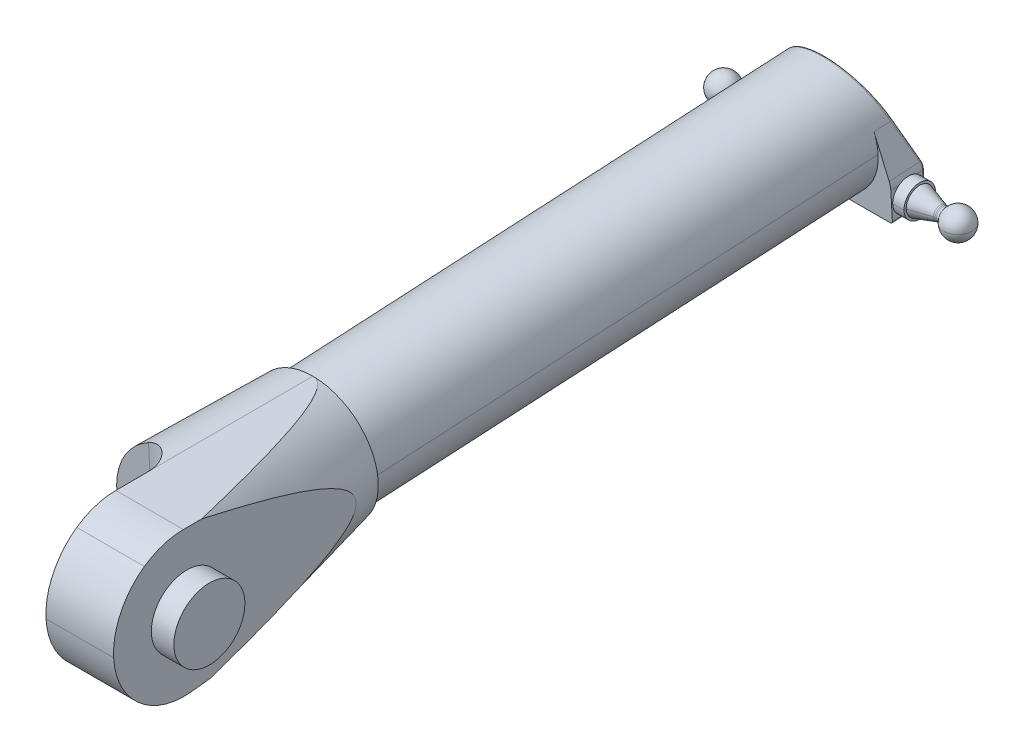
ISO-10303-21;
HEADER;
FILE_DESCRIPTION(('STEP AP214'),'2;1');
FILE_NAME('part.step','',(''),(''),'','','');
FILE_SCHEMA(('AUTOMOTIVE_DESIGN { 1 0 10303 214 1 1 1 1 }'));
ENDSEC;
DATA;
#1=APPLICATION_CONTEXT('core data for automotive mechanical design processes');
#2=APPLICATION_PROTOCOL_DEFINITION('international standard','automotive_design',2000,#1);
#3=PRODUCT_CONTEXT('',#1,'mechanical');
#4=PRODUCT('Part','Part','',(#3));
#5=PRODUCT_RELATED_PRODUCT_CATEGORY('part','',(#4));
#6=PRODUCT_DEFINITION_FORMATION('','',#4);
#7=PRODUCT_DEFINITION_CONTEXT('part definition',#1,'design');
#8=PRODUCT_DEFINITION('design','',#6,#7);
#9=PRODUCT_DEFINITION_SHAPE('','',#8);
#10=(LENGTH_UNIT() NAMED_UNIT(*) SI_UNIT(.MILLI.,.METRE.));
#11=(NAMED_UNIT(*) PLANE_ANGLE_UNIT() SI_UNIT($,.RADIAN.));
#12=(NAMED_UNIT(*) SI_UNIT($,.STERADIAN.) SOLID_ANGLE_UNIT());
#13=UNCERTAINTY_MEASURE_WITH_UNIT(LENGTH_MEASURE(1.E-05),#10,'distance_accuracy_value','');
#14=(GEOMETRIC_REPRESENTATION_CONTEXT(3) GLOBAL_UNCERTAINTY_ASSIGNED_CONTEXT((#13)) GLOBAL_UNIT_ASSIGNED_CONTEXT((#10,
#11,#12)) REPRESENTATION_CONTEXT('',''));
#15=CARTESIAN_POINT('',(0.,0.,0.));
#16=DIRECTION('',(0.,0.,1.));
#17=DIRECTION('',(1.,0.,0.));
#18=AXIS2_PLACEMENT_3D('',#15,#16,#17);
#19=CARTESIAN_POINT('',(-30.0000000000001,-89.9999999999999,-520.));
#20=DIRECTION('',(1.,0.,0.));
#21=DIRECTION('',(0.,0.199382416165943,-0.979921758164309));
#22=AXIS2_PLACEMENT_3D('',#19,#20,#21);
#23=CYLINDRICAL_SURFACE('',#22,7.);
#24=CARTESIAN_POINT('',(-35.0000000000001,-89.9999999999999,-520.));
#25=DIRECTION('',(1.,0.,0.));
#26=DIRECTION('',(0.,0.199382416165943,-0.979921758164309));
#27=AXIS2_PLACEMENT_3D('',#24,#25,#26);
#28=CIRCLE('',#27,7.);
#29=CARTESIAN_POINT('',(-35.0000000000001,-88.6043230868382,-526.859452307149));
#30=VERTEX_POINT('',#29);
#31=CARTESIAN_POINT('',(-35.0000000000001,-91.3956769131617,-513.14054769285));
#32=VERTEX_POINT('',#31);
#33=EDGE_CURVE('E10',#30,#32,#28,.T.);
#34=ORIENTED_EDGE('',*,*,#33,.T.);
#35=DIRECTION('',(1.,0.,0.));
#36=VECTOR('',#35,1.);
#37=CARTESIAN_POINT('',(-30.0000000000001,-91.3956769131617,-513.14054769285));
#38=LINE('',#37,#36);
#39=CARTESIAN_POINT('',(-30.0000000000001,-91.3956769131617,-513.14054769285));
#40=VERTEX_POINT('',#39);
#41=EDGE_CURVE('E28',#32,#40,#38,.T.);
#42=ORIENTED_EDGE('',*,*,#41,.T.);
#43=CARTESIAN_POINT('',(-30.0000000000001,-89.9999999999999,-520.));
#44=DIRECTION('',(1.,0.,0.));
#45=DIRECTION('',(0.,0.199382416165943,-0.979921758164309));
#46=AXIS2_PLACEMENT_3D('',#43,#44,#45);
#47=CIRCLE('',#46,7.);
#48=CARTESIAN_POINT('',(-30.0000000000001,-84.425937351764,-515.765637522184));
#49=VERTEX_POINT('',#48);
#50=EDGE_CURVE('E540',#49,#40,#47,.T.);
#51=ORIENTED_EDGE('',*,*,#50,.F.);
#52=CARTESIAN_POINT('',(-30.0000000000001,-89.9999999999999,-520.));
#53=DIRECTION('',(1.,0.,0.));
#54=DIRECTION('',(0.,0.199382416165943,-0.979921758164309));
#55=AXIS2_PLACEMENT_3D('',#52,#53,#54);
#56=CIRCLE('',#55,7.);
#57=CARTESIAN_POINT('',(-30.0000000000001,-83.9968379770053,-523.600284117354));
#58=VERTEX_POINT('',#57);
#59=EDGE_CURVE('E737',#58,#49,#56,.T.);
#60=ORIENTED_EDGE('',*,*,#59,.F.);
#61=CARTESIAN_POINT('',(-30.0000000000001,-89.9999999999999,-520.));
#62=DIRECTION('',(1.,0.,0.));
#63=DIRECTION('',(0.,0.199382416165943,-0.979921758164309));
#64=AXIS2_PLACEMENT_3D('',#61,#62,#63);
#65=CIRCLE('',#64,7.);
#66=CARTESIAN_POINT('',(-30.0000000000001,-87.0503430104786,-526.348190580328));
#67=VERTEX_POINT('',#66);
#68=EDGE_CURVE('E709',#67,#58,#65,.T.);
#69=ORIENTED_EDGE('',*,*,#68,.F.);
#70=CARTESIAN_POINT('',(-30.0000000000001,-89.9999999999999,-520.));
#71=DIRECTION('',(1.,0.,0.));
#72=DIRECTION('',(0.,0.199382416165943,-0.979921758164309));
#73=AXIS2_PLACEMENT_3D('',#70,#71,#72);
#74=CIRCLE('',#73,7.);
#75=CARTESIAN_POINT('',(-30.0000000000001,-88.6043230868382,-526.859452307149));
#76=VERTEX_POINT('',#75);
#77=EDGE_CURVE('E484',#76,#67,#74,.T.);
#78=ORIENTED_EDGE('',*,*,#77,.F.);
#79=DIRECTION('',(1.,0.,0.));
#80=VECTOR('',#79,1.);
#81=CARTESIAN_POINT('',(-30.0000000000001,-88.6043230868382,-526.859452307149));
#82=LINE('',#81,#80);
#83=EDGE_CURVE('E574',#30,#76,#82,.T.);
#84=ORIENTED_EDGE('',*,*,#83,.F.);
#85=EDGE_LOOP('',(#34,#42,#51,#60,#69,#78,#84));
#86=FACE_BOUND('',#85,.T.);
#87=ADVANCED_FACE('F16',(#86),#23,.T.);
#88=CARTESIAN_POINT('',(-44.2235507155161,-89.9999999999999,-520.));
#89=DIRECTION('',(1.,0.,0.));
#90=DIRECTION('',(0.,0.199382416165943,-0.979921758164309));
#91=AXIS2_PLACEMENT_3D('',#88,#89,#90);
#92=CONICAL_SURFACE('',#91,3.09252464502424,0.305363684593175);
#93=CARTESIAN_POINT('',(-44.2235507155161,-89.9999999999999,-520.));
#94=DIRECTION('',(1.,0.,0.));
#95=DIRECTION('',(0.,0.199382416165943,-0.979921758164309));
#96=AXIS2_PLACEMENT_3D('',#93,#94,#95);
#97=CIRCLE('',#96,3.09252464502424);
#98=CARTESIAN_POINT('',(-44.2235507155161,-89.3834049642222,-523.030432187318));
#99=VERTEX_POINT('',#98);
#100=CARTESIAN_POINT('',(-44.2235507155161,-90.6165950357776,-516.969567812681));
#101=VERTEX_POINT('',#100);
#102=EDGE_CURVE('E618',#99,#101,#97,.T.);
#103=ORIENTED_EDGE('',*,*,#102,.T.);
#104=DIRECTION('',(0.953737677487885,-0.0599423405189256,0.294603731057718));
#105=VECTOR('',#104,1.);
#106=CARTESIAN_POINT('',(-44.2235507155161,-90.6165950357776,-516.969567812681));
#107=LINE('',#106,#105);
#108=CARTESIAN_POINT('',(-35.0000000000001,-91.1962944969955,-514.120469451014));
#109=VERTEX_POINT('',#108);
#110=EDGE_CURVE('E623',#101,#109,#107,.T.);
#111=ORIENTED_EDGE('',*,*,#110,.T.);
#112=CARTESIAN_POINT('',(-35.0000000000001,-89.9999999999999,-520.));
#113=DIRECTION('',(1.,0.,0.));
#114=DIRECTION('',(0.,0.199382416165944,-0.97992175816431));
#115=AXIS2_PLACEMENT_3D('',#112,#113,#114);
#116=CIRCLE('',#115,6.);
#117=CARTESIAN_POINT('',(-35.0000000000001,-88.8037055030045,-525.879530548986));
#118=VERTEX_POINT('',#117);
#119=EDGE_CURVE('E544',#118,#109,#116,.T.);
#120=ORIENTED_EDGE('',*,*,#119,.F.);
#121=DIRECTION('',(0.953737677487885,0.0599423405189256,-0.294603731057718));
#122=VECTOR('',#121,1.);
#123=CARTESIAN_POINT('',(-44.2235507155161,-89.3834049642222,-523.030432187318));
#124=LINE('',#123,#122);
#125=EDGE_CURVE('E547',#99,#118,#124,.T.);
#126=ORIENTED_EDGE('',*,*,#125,.F.);
#127=EDGE_LOOP('',(#103,#111,#120,#126));
#128=FACE_BOUND('',#127,.T.);
#129=ADVANCED_FACE('F1516',(#128),#92,.T.);
#130=CARTESIAN_POINT('',(-44.8248308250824,-89.9999999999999,-520.));
#131=DIRECTION('',(1.,0.,0.));
#132=DIRECTION('',(0.,0.199382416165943,-0.979921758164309));
#133=AXIS2_PLACEMENT_3D('',#130,#131,#132);
#134=TOROIDAL_SURFACE('',#133,5.,2.);
#135=CARTESIAN_POINT('',(-44.2235507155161,-89.9999999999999,-520.));
#136=DIRECTION('',(1.,0.,0.));
#137=DIRECTION('',(0.,0.199382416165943,-0.979921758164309));
#138=AXIS2_PLACEMENT_3D('',#135,#136,#137);
#139=CIRCLE('',#138,3.09252464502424);
#140=EDGE_CURVE('E554',#101,#99,#139,.T.);
#141=ORIENTED_EDGE('',*,*,#140,.F.);
#142=CARTESIAN_POINT('',(-44.8248308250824,-90.9969120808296,-515.100391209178));
#143=DIRECTION('',(0.,0.979921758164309,0.199382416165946));
#144=DIRECTION('',(0.,-0.199382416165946,0.979921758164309));
#145=AXIS2_PLACEMENT_3D('',#142,#143,#144);
#146=CIRCLE('',#145,2.);
#147=CARTESIAN_POINT('',(-44.8248308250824,-90.598147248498,-517.060234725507));
#148=VERTEX_POINT('',#147);
#149=EDGE_CURVE('E627',#101,#148,#146,.T.);
#150=ORIENTED_EDGE('',*,*,#149,.T.);
#151=CARTESIAN_POINT('',(-44.8248308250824,-89.9999999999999,-520.));
#152=DIRECTION('',(1.,0.,0.));
#153=DIRECTION('',(0.,0.199382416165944,-0.97992175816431));
#154=AXIS2_PLACEMENT_3D('',#151,#152,#153);
#155=CIRCLE('',#154,3.);
#156=CARTESIAN_POINT('',(-44.8248308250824,-89.401852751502,-522.939765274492));
#157=VERTEX_POINT('',#156);
#158=EDGE_CURVE('E727',#148,#157,#155,.T.);
#159=ORIENTED_EDGE('',*,*,#158,.T.);
#160=CARTESIAN_POINT('',(-44.8248308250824,-89.0030879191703,-524.899608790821));
#161=DIRECTION('',(0.,-0.979921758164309,-0.199382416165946));
#162=DIRECTION('',(0.,0.199382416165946,-0.979921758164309));
#163=AXIS2_PLACEMENT_3D('',#160,#161,#162);
#164=CIRCLE('',#163,2.);
#165=EDGE_CURVE('E553',#99,#157,#164,.T.);
#166=ORIENTED_EDGE('',*,*,#165,.F.);
#167=EDGE_LOOP('',(#141,#150,#159,#166));
#168=FACE_BOUND('',#167,.T.);
#169=ADVANCED_FACE('F866',(#168),#134,.F.);
#170=CARTESIAN_POINT('',(-30.0000000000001,-89.9999999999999,-520.));
#171=DIRECTION('',(1.,0.,0.));
#172=DIRECTION('',(0.,0.199382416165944,-0.97992175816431));
#173=AXIS2_PLACEMENT_3D('',#170,#171,#172);
#174=CYLINDRICAL_SURFACE('',#173,3.);
#175=CARTESIAN_POINT('',(-45.4377976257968,-89.9999999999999,-520.));
#176=DIRECTION('',(1.,0.,0.));
#177=DIRECTION('',(0.,0.199382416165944,-0.97992175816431));
#178=AXIS2_PLACEMENT_3D('',#175,#176,#177);
#179=CIRCLE('',#178,3.);
#180=CARTESIAN_POINT('',(-45.4377976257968,-89.401852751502,-522.939765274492));
#181=VERTEX_POINT('',#180);
#182=CARTESIAN_POINT('',(-45.4377976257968,-90.598147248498,-517.060234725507));
#183=VERTEX_POINT('',#182);
#184=EDGE_CURVE('E587',#181,#183,#179,.T.);
#185=ORIENTED_EDGE('',*,*,#184,.T.);
#186=DIRECTION('',(1.,0.,0.));
#187=VECTOR('',#186,1.);
#188=CARTESIAN_POINT('',(-30.0000000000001,-90.598147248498,-517.060234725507));
#189=LINE('',#188,#187);
#190=EDGE_CURVE('E584',#183,#148,#189,.T.);
#191=ORIENTED_EDGE('',*,*,#190,.T.);
#192=CARTESIAN_POINT('',(-44.8248308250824,-89.9999999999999,-520.));
#193=DIRECTION('',(1.,0.,0.));
#194=DIRECTION('',(0.,0.199382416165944,-0.97992175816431));
#195=AXIS2_PLACEMENT_3D('',#192,#193,#194);
#196=CIRCLE('',#195,3.);
#197=EDGE_CURVE('E549',#157,#148,#196,.T.);
#198=ORIENTED_EDGE('',*,*,#197,.F.);
#199=DIRECTION('',(1.,0.,0.));
#200=VECTOR('',#199,1.);
#201=CARTESIAN_POINT('',(-30.0000000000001,-89.401852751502,-522.939765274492));
#202=LINE('',#201,#200);
#203=EDGE_CURVE('E2265',#181,#157,#202,.T.);
#204=ORIENTED_EDGE('',*,*,#203,.F.);
#205=EDGE_LOOP('',(#185,#191,#198,#204));
#206=FACE_BOUND('',#205,.T.);
#207=ADVANCED_FACE('F1116',(#206),#174,.T.);
#208=CARTESIAN_POINT('',(-45.4377976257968,-89.9999999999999,-520.));
#209=DIRECTION('',(1.,0.,0.));
#210=DIRECTION('',(0.,0.199382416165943,-0.979921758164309));
#211=AXIS2_PLACEMENT_3D('',#208,#209,#210);
#212=TOROIDAL_SURFACE('',#211,5.,2.);
#213=CARTESIAN_POINT('',(-45.4377976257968,-89.9999999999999,-520.));
#214=DIRECTION('',(1.,0.,0.));
#215=DIRECTION('',(0.,0.199382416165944,-0.97992175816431));
#216=AXIS2_PLACEMENT_3D('',#213,#214,#215);
#217=CIRCLE('',#216,3.);
#218=EDGE_CURVE('E2127',#183,#181,#217,.T.);
#219=ORIENTED_EDGE('',*,*,#218,.F.);
#220=CARTESIAN_POINT('',(-45.4377976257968,-90.9969120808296,-515.100391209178));
#221=DIRECTION('',(0.,0.979921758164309,0.199382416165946));
#222=DIRECTION('',(0.,-0.199382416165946,0.979921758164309));
#223=AXIS2_PLACEMENT_3D('',#220,#221,#222);
#224=CIRCLE('',#223,2.);
#225=CARTESIAN_POINT('',(-47.0286345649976,-90.7552364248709,-516.288175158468));
#226=VERTEX_POINT('',#225);
#227=EDGE_CURVE('E497',#183,#226,#224,.T.);
#228=ORIENTED_EDGE('',*,*,#227,.T.);
#229=CARTESIAN_POINT('',(-47.0286345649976,-89.9999999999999,-520.));
#230=DIRECTION('',(1.,0.,0.));
#231=DIRECTION('',(0.,0.199382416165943,-0.979921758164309));
#232=AXIS2_PLACEMENT_3D('',#229,#230,#231);
#233=CIRCLE('',#232,3.78787878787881);
#234=CARTESIAN_POINT('',(-47.0286345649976,-89.244763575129,-523.711824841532));
#235=VERTEX_POINT('',#234);
#236=EDGE_CURVE('E493',#226,#235,#233,.T.);
#237=ORIENTED_EDGE('',*,*,#236,.T.);
#238=CARTESIAN_POINT('',(-45.4377976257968,-89.0030879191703,-524.899608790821));
#239=DIRECTION('',(0.,-0.979921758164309,-0.199382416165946));
#240=DIRECTION('',(0.,0.199382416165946,-0.979921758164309));
#241=AXIS2_PLACEMENT_3D('',#238,#239,#240);
#242=CIRCLE('',#241,2.);
#243=EDGE_CURVE('E2126',#181,#235,#242,.T.);
#244=ORIENTED_EDGE('',*,*,#243,.F.);
#245=EDGE_LOOP('',(#219,#228,#237,#244));
#246=FACE_BOUND('',#245,.T.);
#247=ADVANCED_FACE('F1217',(#246),#212,.F.);
#248=CARTESIAN_POINT('',(-52.0000000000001,-89.9999999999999,-520.));
#249=DIRECTION('',(0.,-0.97992175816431,-0.199382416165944));
#250=DIRECTION('',(0.,-0.199382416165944,0.97992175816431));
#251=AXIS2_PLACEMENT_3D('',#248,#249,#250);
#252=SPHERICAL_SURFACE('',#251,6.25);
#253=CARTESIAN_POINT('',(-52.0000000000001,-89.9999999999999,-520.));
#254=DIRECTION('',(0.,0.97992175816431,0.199382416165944));
#255=DIRECTION('',(0.,-0.199382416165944,0.97992175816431));
#256=AXIS2_PLACEMENT_3D('',#253,#254,#255);
#257=CIRCLE('',#256,6.25);
#258=CARTESIAN_POINT('',(-58.2500000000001,-89.9999999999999,-520.));
#259=VERTEX_POINT('',#258);
#260=EDGE_CURVE('E2259',#259,#226,#257,.T.);
#261=ORIENTED_EDGE('',*,*,#260,.F.);
#262=CARTESIAN_POINT('',(-52.0000000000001,-89.9999999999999,-520.));
#263=DIRECTION('',(0.,-0.97992175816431,-0.199382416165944));
#264=DIRECTION('',(0.,0.199382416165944,-0.97992175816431));
#265=AXIS2_PLACEMENT_3D('',#262,#263,#264);
#266=CIRCLE('',#265,6.25);
#267=EDGE_CURVE('E498',#259,#235,#266,.T.);
#268=ORIENTED_EDGE('',*,*,#267,.T.);
#269=ORIENTED_EDGE('',*,*,#236,.F.);
#270=EDGE_LOOP('',(#261,#268,#269));
#271=FACE_BOUND('',#270,.T.);
#272=ADVANCED_FACE('F1223',(#271),#252,.T.);
#273=CARTESIAN_POINT('',(29.9999999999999,-89.9999999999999,-520.));
#274=DIRECTION('',(-1.,0.,0.));
#275=DIRECTION('',(0.,0.0159653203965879,-0.999872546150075));
#276=AXIS2_PLACEMENT_3D('',#273,#274,#275);
#277=CYLINDRICAL_SURFACE('',#276,7.);
#278=CARTESIAN_POINT('',(34.9999999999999,-89.9999999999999,-520.));
#279=DIRECTION('',(-1.,0.,0.));
#280=DIRECTION('',(0.,0.0159653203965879,-0.999872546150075));
#281=AXIS2_PLACEMENT_3D('',#278,#279,#280);
#282=CIRCLE('',#281,7.);
#283=CARTESIAN_POINT('',(34.9999999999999,-89.8882427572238,-526.99910782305));
#284=VERTEX_POINT('',#283);
#285=CARTESIAN_POINT('',(34.9999999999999,-90.1117572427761,-513.000892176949));
#286=VERTEX_POINT('',#285);
#287=EDGE_CURVE('E714',#284,#286,#282,.T.);
#288=ORIENTED_EDGE('',*,*,#287,.T.);
#289=DIRECTION('',(-1.,0.,0.));
#290=VECTOR('',#289,1.);
#291=CARTESIAN_POINT('',(29.9999999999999,-90.1117572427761,-513.000892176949));
#292=LINE('',#291,#290);
#293=CARTESIAN_POINT('',(29.9999999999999,-90.1117572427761,-513.000892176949));
#294=VERTEX_POINT('',#293);
#295=EDGE_CURVE('E710',#286,#294,#292,.T.);
#296=ORIENTED_EDGE('',*,*,#295,.T.);
#297=CARTESIAN_POINT('',(29.9999999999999,-89.9999999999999,-520.));
#298=DIRECTION('',(-1.,0.,0.));
#299=DIRECTION('',(0.,0.0159653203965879,-0.999872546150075));
#300=AXIS2_PLACEMENT_3D('',#297,#298,#299);
#301=CIRCLE('',#300,7.);
#302=CARTESIAN_POINT('',(29.9999999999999,-96.6323551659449,-517.761280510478));
#303=VERTEX_POINT('',#302);
#304=EDGE_CURVE('E642',#303,#294,#301,.T.);
#305=ORIENTED_EDGE('',*,*,#304,.F.);
#306=CARTESIAN_POINT('',(29.9999999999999,-89.9999999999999,-520.));
#307=DIRECTION('',(-1.,0.,0.));
#308=DIRECTION('',(0.,0.0159653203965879,-0.999872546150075));
#309=AXIS2_PLACEMENT_3D('',#306,#307,#308);
#310=CIRCLE('',#309,7.);
#311=CARTESIAN_POINT('',(29.9999999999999,-96.3481905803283,-522.949656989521));
#312=VERTEX_POINT('',#311);
#313=EDGE_CURVE('E630',#312,#303,#310,.T.);
#314=ORIENTED_EDGE('',*,*,#313,.F.);
#315=CARTESIAN_POINT('',(29.9999999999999,-89.9999999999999,-520.));
#316=DIRECTION('',(-1.,0.,0.));
#317=DIRECTION('',(0.,0.0159653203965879,-0.999872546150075));
#318=AXIS2_PLACEMENT_3D('',#315,#316,#317);
#319=CIRCLE('',#318,7.);
#320=CARTESIAN_POINT('',(29.9999999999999,-92.2387194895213,-526.632355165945));
#321=VERTEX_POINT('',#320);
#322=EDGE_CURVE('E509',#321,#312,#319,.T.);
#323=ORIENTED_EDGE('',*,*,#322,.F.);
#324=CARTESIAN_POINT('',(29.9999999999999,-89.9999999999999,-520.));
#325=DIRECTION('',(-1.,0.,0.));
#326=DIRECTION('',(0.,0.0159653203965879,-0.999872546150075));
#327=AXIS2_PLACEMENT_3D('',#324,#325,#326);
#328=CIRCLE('',#327,7.);
#329=CARTESIAN_POINT('',(29.9999999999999,-89.8882427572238,-526.99910782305));
#330=VERTEX_POINT('',#329);
#331=EDGE_CURVE('E604',#330,#321,#328,.T.);
#332=ORIENTED_EDGE('',*,*,#331,.F.);
#333=DIRECTION('',(-1.,0.,0.));
#334=VECTOR('',#333,1.);
#335=CARTESIAN_POINT('',(29.9999999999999,-89.8882427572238,-526.99910782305));
#336=LINE('',#335,#334);
#337=EDGE_CURVE('E473',#284,#330,#336,.T.);
#338=ORIENTED_EDGE('',*,*,#337,.F.);
#339=EDGE_LOOP('',(#288,#296,#305,#314,#323,#332,#338));
#340=FACE_BOUND('',#339,.T.);
#341=ADVANCED_FACE('F1655',(#340),#277,.T.);
#342=CARTESIAN_POINT('',(44.2235507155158,-89.9999999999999,-520.));
#343=DIRECTION('',(-1.,0.,0.));
#344=DIRECTION('',(0.,0.0159653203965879,-0.999872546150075));
#345=AXIS2_PLACEMENT_3D('',#342,#343,#344);
#346=CONICAL_SURFACE('',#345,3.09252464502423,0.305363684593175);
#347=CARTESIAN_POINT('',(44.2235507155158,-89.9999999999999,-520.));
#348=DIRECTION('',(-1.,0.,0.));
#349=DIRECTION('',(0.,0.0159653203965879,-0.999872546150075));
#350=AXIS2_PLACEMENT_3D('',#347,#348,#349);
#351=CIRCLE('',#350,3.09252464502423);
#352=CARTESIAN_POINT('',(44.2235507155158,-89.9506268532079,-523.092130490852));
#353=VERTEX_POINT('',#352);
#354=CARTESIAN_POINT('',(44.2235507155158,-90.049373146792,-516.907869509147));
#355=VERTEX_POINT('',#354);
#356=EDGE_CURVE('E715',#353,#355,#351,.T.);
#357=ORIENTED_EDGE('',*,*,#356,.T.);
#358=DIRECTION('',(-0.953737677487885,-0.00479981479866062,0.300601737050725));
#359=VECTOR('',#358,1.);
#360=CARTESIAN_POINT('',(44.2235507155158,-90.049373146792,-516.907869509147));
#361=LINE('',#360,#359);
#362=CARTESIAN_POINT('',(34.9999999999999,-90.0957919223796,-514.0007647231));
#363=VERTEX_POINT('',#362);
#364=EDGE_CURVE('E451',#355,#363,#361,.T.);
#365=ORIENTED_EDGE('',*,*,#364,.T.);
#366=CARTESIAN_POINT('',(34.9999999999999,-89.9999999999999,-520.));
#367=DIRECTION('',(-1.,0.,0.));
#368=DIRECTION('',(0.,0.0159653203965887,-0.999872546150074));
#369=AXIS2_PLACEMENT_3D('',#366,#367,#368);
#370=CIRCLE('',#369,6.);
#371=CARTESIAN_POINT('',(34.9999999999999,-89.9042080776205,-525.9992352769));
#372=VERTEX_POINT('',#371);
#373=EDGE_CURVE('E444',#372,#363,#370,.T.);
#374=ORIENTED_EDGE('',*,*,#373,.F.);
#375=DIRECTION('',(-0.953737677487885,0.00479981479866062,-0.300601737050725));
#376=VECTOR('',#375,1.);
#377=CARTESIAN_POINT('',(44.2235507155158,-89.9506268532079,-523.092130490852));
#378=LINE('',#377,#376);
#379=EDGE_CURVE('E448',#353,#372,#378,.T.);
#380=ORIENTED_EDGE('',*,*,#379,.F.);
#381=EDGE_LOOP('',(#357,#365,#374,#380));
#382=FACE_BOUND('',#381,.T.);
#383=ADVANCED_FACE('F447',(#382),#346,.T.);
#384=CARTESIAN_POINT('',(44.8248308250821,-89.9999999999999,-520.));
#385=DIRECTION('',(-1.,0.,0.));
#386=DIRECTION('',(0.,0.0159653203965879,-0.999872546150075));
#387=AXIS2_PLACEMENT_3D('',#384,#385,#386);
#388=TOROIDAL_SURFACE('',#387,5.,2.);
#389=CARTESIAN_POINT('',(44.2235507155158,-89.9999999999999,-520.));
#390=DIRECTION('',(-1.,0.,0.));
#391=DIRECTION('',(0.,0.0159653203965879,-0.999872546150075));
#392=AXIS2_PLACEMENT_3D('',#389,#390,#391);
#393=CIRCLE('',#392,3.09252464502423);
#394=EDGE_CURVE('E460',#355,#353,#393,.T.);
#395=ORIENTED_EDGE('',*,*,#394,.F.);
#396=CARTESIAN_POINT('',(44.8248308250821,-90.0798266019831,-515.00063726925));
#397=DIRECTION('',(0.,-0.999872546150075,-0.0159653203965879));
#398=DIRECTION('',(0.,0.0159653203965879,-0.999872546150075));
#399=AXIS2_PLACEMENT_3D('',#396,#397,#398);
#400=CIRCLE('',#399,2.);
#401=CARTESIAN_POINT('',(44.8248308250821,-90.0478959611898,-517.00038236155));
#402=VERTEX_POINT('',#401);
#403=EDGE_CURVE('E721',#355,#402,#400,.T.);
#404=ORIENTED_EDGE('',*,*,#403,.T.);
#405=CARTESIAN_POINT('',(44.8248308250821,-89.9999999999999,-520.));
#406=DIRECTION('',(-1.,0.,0.));
#407=DIRECTION('',(0.,0.0159653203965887,-0.999872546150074));
#408=AXIS2_PLACEMENT_3D('',#405,#406,#407);
#409=CIRCLE('',#408,3.);
#410=CARTESIAN_POINT('',(44.8248308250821,-89.9521040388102,-522.99961763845));
#411=VERTEX_POINT('',#410);
#412=EDGE_CURVE('E695',#402,#411,#409,.T.);
#413=ORIENTED_EDGE('',*,*,#412,.T.);
#414=CARTESIAN_POINT('',(44.8248308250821,-89.9201733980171,-524.99936273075));
#415=DIRECTION('',(0.,0.999872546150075,0.0159653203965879));
#416=DIRECTION('',(0.,-0.0159653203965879,0.999872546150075));
#417=AXIS2_PLACEMENT_3D('',#414,#415,#416);
#418=CIRCLE('',#417,2.);
#419=EDGE_CURVE('E700',#353,#411,#418,.T.);
#420=ORIENTED_EDGE('',*,*,#419,.F.);
#421=EDGE_LOOP('',(#395,#404,#413,#420));
#422=FACE_BOUND('',#421,.T.);
#423=ADVANCED_FACE('F1485',(#422),#388,.F.);
#424=CARTESIAN_POINT('',(29.9999999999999,-89.9999999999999,-520.));
#425=DIRECTION('',(-1.,0.,0.));
#426=DIRECTION('',(0.,0.0159653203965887,-0.999872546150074));
#427=AXIS2_PLACEMENT_3D('',#424,#425,#426);
#428=CYLINDRICAL_SURFACE('',#427,3.);
#429=CARTESIAN_POINT('',(45.4377976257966,-89.9999999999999,-520.));
#430=DIRECTION('',(-1.,0.,0.));
#431=DIRECTION('',(0.,0.0159653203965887,-0.999872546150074));
#432=AXIS2_PLACEMENT_3D('',#429,#430,#431);
#433=CIRCLE('',#432,3.);
#434=CARTESIAN_POINT('',(45.4377976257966,-89.9521040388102,-522.99961763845));
#435=VERTEX_POINT('',#434);
#436=CARTESIAN_POINT('',(45.4377976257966,-90.0478959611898,-517.00038236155));
#437=VERTEX_POINT('',#436);
#438=EDGE_CURVE('E691',#435,#437,#433,.T.);
#439=ORIENTED_EDGE('',*,*,#438,.T.);
#440=DIRECTION('',(-1.,0.,0.));
#441=VECTOR('',#440,1.);
#442=CARTESIAN_POINT('',(29.9999999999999,-90.0478959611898,-517.00038236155));
#443=LINE('',#442,#441);
#444=EDGE_CURVE('E696',#437,#402,#443,.T.);
#445=ORIENTED_EDGE('',*,*,#444,.T.);
#446=CARTESIAN_POINT('',(44.8248308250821,-89.9999999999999,-520.));
#447=DIRECTION('',(-1.,0.,0.));
#448=DIRECTION('',(0.,0.0159653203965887,-0.999872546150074));
#449=AXIS2_PLACEMENT_3D('',#446,#447,#448);
#450=CIRCLE('',#449,3.);
#451=EDGE_CURVE('E704',#411,#402,#450,.T.);
#452=ORIENTED_EDGE('',*,*,#451,.F.);
#453=DIRECTION('',(-1.,0.,0.));
#454=VECTOR('',#453,1.);
#455=CARTESIAN_POINT('',(29.9999999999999,-89.9521040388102,-522.99961763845));
#456=LINE('',#455,#454);
#457=EDGE_CURVE('E653',#435,#411,#456,.T.);
#458=ORIENTED_EDGE('',*,*,#457,.F.);
#459=EDGE_LOOP('',(#439,#445,#452,#458));
#460=FACE_BOUND('',#459,.T.);
#461=ADVANCED_FACE('F1335',(#460),#428,.T.);
#462=CARTESIAN_POINT('',(45.4377976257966,-89.9999999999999,-520.));
#463=DIRECTION('',(-1.,0.,0.));
#464=DIRECTION('',(0.,0.0159653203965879,-0.999872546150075));
#465=AXIS2_PLACEMENT_3D('',#462,#463,#464);
#466=TOROIDAL_SURFACE('',#465,5.,2.);
#467=CARTESIAN_POINT('',(45.4377976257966,-89.9999999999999,-520.));
#468=DIRECTION('',(-1.,0.,0.));
#469=DIRECTION('',(0.,0.0159653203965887,-0.999872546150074));
#470=AXIS2_PLACEMENT_3D('',#467,#468,#469);
#471=CIRCLE('',#470,3.);
#472=EDGE_CURVE('E648',#437,#435,#471,.T.);
#473=ORIENTED_EDGE('',*,*,#472,.F.);
#474=CARTESIAN_POINT('',(45.4377976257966,-90.0798266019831,-515.00063726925));
#475=DIRECTION('',(0.,-0.999872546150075,-0.0159653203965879));
#476=DIRECTION('',(0.,0.0159653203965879,-0.999872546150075));
#477=AXIS2_PLACEMENT_3D('',#474,#475,#476);
#478=CIRCLE('',#477,2.);
#479=CARTESIAN_POINT('',(47.0286345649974,-90.0604746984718,-516.212603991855));
#480=VERTEX_POINT('',#479);
#481=EDGE_CURVE('E609',#437,#480,#478,.T.);
#482=ORIENTED_EDGE('',*,*,#481,.T.);
#483=CARTESIAN_POINT('',(47.0286345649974,-89.9999999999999,-520.));
#484=DIRECTION('',(-1.,0.,0.));
#485=DIRECTION('',(0.,0.0159653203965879,-0.999872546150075));
#486=AXIS2_PLACEMENT_3D('',#483,#484,#485);
#487=CIRCLE('',#486,3.78787878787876);
#488=CARTESIAN_POINT('',(47.0286345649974,-89.9395253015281,-523.787396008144));
#489=VERTEX_POINT('',#488);
#490=EDGE_CURVE('E605',#480,#489,#487,.T.);
#491=ORIENTED_EDGE('',*,*,#490,.T.);
#492=CARTESIAN_POINT('',(45.4377976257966,-89.9201733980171,-524.99936273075));
#493=DIRECTION('',(0.,0.999872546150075,0.0159653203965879));
#494=DIRECTION('',(0.,-0.0159653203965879,0.999872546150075));
#495=AXIS2_PLACEMENT_3D('',#492,#493,#494);
#496=CIRCLE('',#495,2.);
#497=EDGE_CURVE('E477',#435,#489,#496,.T.);
#498=ORIENTED_EDGE('',*,*,#497,.F.);
#499=EDGE_LOOP('',(#473,#482,#491,#498));
#500=FACE_BOUND('',#499,.T.);
#501=ADVANCED_FACE('F1267',(#500),#466,.F.);
#502=CARTESIAN_POINT('',(51.9999999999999,-89.9999999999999,-520.));
#503=DIRECTION('',(0.,0.999872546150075,0.0159653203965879));
#504=DIRECTION('',(0.,-0.0159653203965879,0.999872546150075));
#505=AXIS2_PLACEMENT_3D('',#502,#503,#504);
#506=SPHERICAL_SURFACE('',#505,6.25);
#507=CARTESIAN_POINT('',(51.9999999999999,-89.9999999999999,-520.));
#508=DIRECTION('',(0.,-0.999872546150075,-0.0159653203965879));
#509=DIRECTION('',(0.,0.0159653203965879,-0.999872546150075));
#510=AXIS2_PLACEMENT_3D('',#507,#508,#509);
#511=CIRCLE('',#510,6.25);
#512=CARTESIAN_POINT('',(58.2499999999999,-89.9999999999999,-520.));
#513=VERTEX_POINT('',#512);
#514=EDGE_CURVE('E489',#513,#480,#511,.T.);
#515=ORIENTED_EDGE('',*,*,#514,.F.);
#516=CARTESIAN_POINT('',(51.9999999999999,-89.9999999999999,-520.));
#517=DIRECTION('',(0.,0.999872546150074,0.0159653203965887));
#518=DIRECTION('',(0.,-0.0159653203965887,0.999872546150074));
#519=AXIS2_PLACEMENT_3D('',#516,#517,#518);
#520=CIRCLE('',#519,6.25);
#521=EDGE_CURVE('E521',#513,#489,#520,.T.);
#522=ORIENTED_EDGE('',*,*,#521,.T.);
#523=ORIENTED_EDGE('',*,*,#490,.F.);
#524=EDGE_LOOP('',(#515,#522,#523));
#525=FACE_BOUND('',#524,.T.);
#526=ADVANCED_FACE('F1262',(#525),#506,.T.);
#527=CARTESIAN_POINT('',(33.9999999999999,-90.000000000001,-200.));
#528=DIRECTION('',(-1.,0.,0.));
#529=DIRECTION('',(0.,0.998503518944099,0.0546875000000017));
#530=AXIS2_PLACEMENT_3D('',#527,#528,#529);
#531=CYLINDRICAL_SURFACE('',#530,15.75);
#532=CARTESIAN_POINT('',(29.9999999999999,-90.000000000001,-200.));
#533=DIRECTION('',(1.,0.,0.));
#534=DIRECTION('',(0.,0.998503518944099,0.0546875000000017));
#535=AXIS2_PLACEMENT_3D('',#532,#533,#534);
#536=CIRCLE('',#535,15.75);
#537=CARTESIAN_POINT('',(29.9999999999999,-74.2735695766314,-199.138671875));
#538=VERTEX_POINT('',#537);
#539=EDGE_CURVE('E517',#538,#538,#536,.T.);
#540=ORIENTED_EDGE('',*,*,#539,.T.);
#541=EDGE_LOOP('',(#540));
#542=FACE_BOUND('',#541,.T.);
#543=CARTESIAN_POINT('',(39.9999999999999,-90.000000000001,-200.));
#544=DIRECTION('',(1.,0.,0.));
#545=DIRECTION('',(0.,0.937649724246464,-0.347581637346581));
#546=AXIS2_PLACEMENT_3D('',#543,#544,#545);
#547=CIRCLE('',#546,15.75);
#548=CARTESIAN_POINT('',(39.9999999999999,-75.2320168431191,-205.474410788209));
#549=VERTEX_POINT('',#548);
#550=EDGE_CURVE('E2090',#549,#549,#547,.T.);
#551=ORIENTED_EDGE('',*,*,#550,.F.);
#552=EDGE_LOOP('',(#551));
#553=FACE_BOUND('',#552,.T.);
#554=ADVANCED_FACE('F1052',(#542,#553),#531,.T.);
#555=CARTESIAN_POINT('',(-32.5000000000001,-90.000000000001,-200.));
#556=DIRECTION('',(1.,0.,0.));
#557=DIRECTION('',(0.,-0.0546875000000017,0.998503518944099));
#558=AXIS2_PLACEMENT_3D('',#555,#556,#557);
#559=CYLINDRICAL_SURFACE('',#558,32.5);
#560=CARTESIAN_POINT('',(-1.31838984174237E-13,-90.000000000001,-200.));
#561=DIRECTION('',(-1.,0.,0.));
#562=DIRECTION('',(0.,-0.0546875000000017,0.998503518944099));
#563=AXIS2_PLACEMENT_3D('',#560,#561,#562);
#564=CIRCLE('',#563,32.5);
#565=CARTESIAN_POINT('',(-1.35437612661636E-13,-91.7773437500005,-167.548635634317));
#566=VERTEX_POINT('',#565);
#567=CARTESIAN_POINT('',(-1.33759044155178E-13,-63.5020318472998,-181.182250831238));
#568=VERTEX_POINT('',#567);
#569=EDGE_CURVE('E2255',#566,#568,#564,.T.);
#570=ORIENTED_EDGE('',*,*,#569,.F.);
#571=DIRECTION('',(1.,0.,0.));
#572=VECTOR('',#571,1.);
#573=CARTESIAN_POINT('',(-32.5000000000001,-91.7773437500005,-167.548635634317));
#574=LINE('',#573,#572);
#575=CARTESIAN_POINT('',(29.9999999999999,-91.7773437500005,-167.548635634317));
#576=VERTEX_POINT('',#575);
#577=EDGE_CURVE('E522',#566,#576,#574,.T.);
#578=ORIENTED_EDGE('',*,*,#577,.T.);
#579=CARTESIAN_POINT('',(29.9999999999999,-90.000000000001,-200.));
#580=DIRECTION('',(-1.,0.,0.));
#581=DIRECTION('',(0.,-0.0546875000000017,0.998503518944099));
#582=AXIS2_PLACEMENT_3D('',#579,#580,#581);
#583=CIRCLE('',#582,32.5);
#584=CARTESIAN_POINT('',(29.9999999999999,-63.5020318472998,-181.182250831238));
#585=VERTEX_POINT('',#584);
#586=EDGE_CURVE('E583',#576,#585,#583,.T.);
#587=ORIENTED_EDGE('',*,*,#586,.T.);
#588=DIRECTION('',(-1.,0.,0.));
#589=VECTOR('',#588,1.);
#590=CARTESIAN_POINT('',(-32.5000000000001,-63.5020318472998,-181.182250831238));
#591=LINE('',#590,#589);
#592=EDGE_CURVE('E588',#585,#568,#591,.T.);
#593=ORIENTED_EDGE('',*,*,#592,.T.);
#594=EDGE_LOOP('',(#570,#578,#587,#593));
#595=FACE_BOUND('',#594,.T.);
#596=ADVANCED_FACE('F1277',(#595),#559,.T.);
#597=CARTESIAN_POINT('',(-1.38777878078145E-13,27251.9726562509,-499419.308107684));
#598=DIRECTION('',(0.,-0.0546875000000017,0.998503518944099));
#599=DIRECTION('',(-1.,0.,0.));
#600=AXIS2_PLACEMENT_3D('',#597,#598,#599);
#601=CYLINDRICAL_SURFACE('',#600,25.);
#602=CARTESIAN_POINT('',(-1.38777878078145E-13,-72.9363446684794,-511.554192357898));
#603=DIRECTION('',(0.,0.0546875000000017,-0.998503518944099));
#604=DIRECTION('',(1.,0.,0.));
#605=AXIS2_PLACEMENT_3D('',#602,#603,#604);
#606=CIRCLE('',#605,25.);
#607=CARTESIAN_POINT('',(24.9999999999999,-72.9363446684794,-511.554192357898));
#608=VERTEX_POINT('',#607);
#609=CARTESIAN_POINT('',(-1.36002320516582E-13,-97.8989326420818,-512.921379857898));
#610=VERTEX_POINT('',#609);
#611=EDGE_CURVE('E638',#608,#610,#606,.T.);
#612=ORIENTED_EDGE('',*,*,#611,.F.);
#613=DIRECTION('',(0.,-0.0546875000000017,0.998503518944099));
#614=VECTOR('',#613,1.);
#615=CARTESIAN_POINT('',(24.9999999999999,27251.9726562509,-499419.308107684));
#616=LINE('',#615,#614);
#617=CARTESIAN_POINT('',(24.9999999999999,-85.2148437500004,-287.369057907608));
#618=VERTEX_POINT('',#617);
#619=EDGE_CURVE('E592',#608,#618,#616,.T.);
#620=ORIENTED_EDGE('',*,*,#619,.T.);
#621=CARTESIAN_POINT('',(-1.38777878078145E-13,-85.2148437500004,-287.369057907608));
#622=DIRECTION('',(0.,0.0546875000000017,-0.998503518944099));
#623=DIRECTION('',(1.,0.,0.));
#624=AXIS2_PLACEMENT_3D('',#621,#622,#623);
#625=CIRCLE('',#624,25.);
#626=CARTESIAN_POINT('',(-25.0000000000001,-85.2148437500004,-287.369057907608));
#627=VERTEX_POINT('',#626);
#628=EDGE_CURVE('E634',#618,#627,#625,.T.);
#629=ORIENTED_EDGE('',*,*,#628,.T.);
#630=DIRECTION('',(0.,-0.0546875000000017,0.998503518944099));
#631=VECTOR('',#630,1.);
#632=CARTESIAN_POINT('',(-25.0000000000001,27251.9726562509,-499419.308107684));
#633=LINE('',#632,#631);
#634=CARTESIAN_POINT('',(-25.0000000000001,-72.9363446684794,-511.554192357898));
#635=VERTEX_POINT('',#634);
#636=EDGE_CURVE('E748',#635,#627,#633,.T.);
#637=ORIENTED_EDGE('',*,*,#636,.F.);
#638=CARTESIAN_POINT('',(-1.38777878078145E-13,-72.9363446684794,-511.554192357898));
#639=DIRECTION('',(0.,0.0546875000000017,-0.998503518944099));
#640=DIRECTION('',(1.,0.,0.));
#641=AXIS2_PLACEMENT_3D('',#638,#639,#640);
#642=CIRCLE('',#641,25.);
#643=EDGE_CURVE('E2113',#610,#635,#642,.T.);
#644=ORIENTED_EDGE('',*,*,#643,.F.);
#645=EDGE_LOOP('',(#612,#620,#629,#637,#644));
#646=FACE_BOUND('',#645,.T.);
#647=ADVANCED_FACE('F791',(#646),#601,.T.);
#648=CARTESIAN_POINT('',(-1.38777878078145E-13,27251.9726562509,-499419.308107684));
#649=DIRECTION('',(0.,-0.0546875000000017,0.998503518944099));
#650=DIRECTION('',(-1.,0.,0.));
#651=AXIS2_PLACEMENT_3D('',#648,#649,#650);
#652=CYLINDRICAL_SURFACE('',#651,25.);
#653=ORIENTED_EDGE('',*,*,#619,.F.);
#654=CARTESIAN_POINT('',(-1.38777878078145E-13,-72.9363446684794,-511.554192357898));
#655=DIRECTION('',(0.,0.0546875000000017,-0.998503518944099));
#656=DIRECTION('',(1.,0.,0.));
#657=AXIS2_PLACEMENT_3D('',#654,#655,#656);
#658=CIRCLE('',#657,25.);
#659=CARTESIAN_POINT('',(23.5912291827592,-64.6750385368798,-511.101725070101));
#660=VERTEX_POINT('',#659);
#661=EDGE_CURVE('E644',#660,#608,#658,.T.);
#662=ORIENTED_EDGE('',*,*,#661,.F.);
#663=DIRECTION('',(0.,0.0546875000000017,-0.998503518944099));
#664=VECTOR('',#663,1.);
#665=CARTESIAN_POINT('',(23.5912291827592,-64.675038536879,-511.101725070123));
#666=LINE('',#665,#664);
#667=CARTESIAN_POINT('',(23.5912291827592,-64.2700667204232,-518.495842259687));
#668=VERTEX_POINT('',#667);
#669=EDGE_CURVE('E2347',#660,#668,#666,.T.);
#670=ORIENTED_EDGE('',*,*,#669,.T.);
#671=CARTESIAN_POINT('',(-23.5912291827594,-64.2700667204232,-518.495842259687));
#672=CARTESIAN_POINT('',(-22.7406989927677,-61.8948726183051,-517.517104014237));
#673=CARTESIAN_POINT('',(-21.5136099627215,-59.6498706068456,-516.592013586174));
#674=CARTESIAN_POINT('',(-18.4209376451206,-55.6295501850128,-514.93537367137));
#675=CARTESIAN_POINT('',(-16.5558901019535,-53.8550353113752,-514.204155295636));
#676=CARTESIAN_POINT('',(-12.3632319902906,-50.9436679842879,-513.004477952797));
#677=CARTESIAN_POINT('',(-10.0362504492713,-49.8072523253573,-512.536198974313));
#678=CARTESIAN_POINT('',(-5.13915131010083,-48.2795030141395,-511.906664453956));
#679=CARTESIAN_POINT('',(-2.56976842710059,-47.8883985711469,-511.745503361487));
#680=CARTESIAN_POINT('',(2.56976842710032,-47.8883985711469,-511.745503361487));
#681=CARTESIAN_POINT('',(5.13915131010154,-48.2795030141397,-511.906664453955));
#682=CARTESIAN_POINT('',(10.0362504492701,-49.807252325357,-512.536198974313));
#683=CARTESIAN_POINT('',(12.3632319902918,-50.9436679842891,-513.004477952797));
#684=CARTESIAN_POINT('',(16.5558901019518,-53.855035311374,-514.204155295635));
#685=CARTESIAN_POINT('',(18.4209376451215,-55.6295501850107,-514.935373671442));
#686=CARTESIAN_POINT('',(21.5136099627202,-59.6498706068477,-516.592013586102));
#687=CARTESIAN_POINT('',(22.7406989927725,-61.8948726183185,-517.517104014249));
#688=CARTESIAN_POINT('',(23.5912291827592,-64.2700667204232,-518.495842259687));
#689=(BOUNDED_CURVE() B_SPLINE_CURVE(3,(#671,#672,#673,#674,#675,#676,#677,#678,#679,#680,#681,
#682,#683,#684,#685,#686,#687,#688),.UNSPECIFIED.,.F.,.F.) B_SPLINE_CURVE_WITH_KNOTS((4,2,2,2,2,
2,2,2,4),(1.90810380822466,2.21647601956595,2.52484823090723,2.83322044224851,3.14159265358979,
3.44996486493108,3.75833707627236,4.06670928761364,4.37508149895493),
.UNSPECIFIED.) CURVE() GEOMETRIC_REPRESENTATION_ITEM() RATIONAL_B_SPLINE_CURVE((1.,1.,1.,1.,1.,
1.,1.,1.,1.,1.,1.,1.,1.,1.,1.,1.,1.,1.)) REPRESENTATION_ITEM(''));
#690=CARTESIAN_POINT('',(-23.5912291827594,-64.2700667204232,-518.495842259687));
#691=VERTEX_POINT('',#690);
#692=EDGE_CURVE('E751',#668,#691,#689,.F.);
#693=ORIENTED_EDGE('',*,*,#692,.T.);
#694=DIRECTION('',(0.,0.0546875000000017,-0.998503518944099));
#695=VECTOR('',#694,1.);
#696=CARTESIAN_POINT('',(-23.5912291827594,-64.675038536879,-511.101725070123));
#697=LINE('',#696,#695);
#698=CARTESIAN_POINT('',(-23.5912291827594,-64.6750385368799,-511.101725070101));
#699=VERTEX_POINT('',#698);
#700=EDGE_CURVE('E671',#699,#691,#697,.T.);
#701=ORIENTED_EDGE('',*,*,#700,.F.);
#702=CARTESIAN_POINT('',(-1.38777878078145E-13,-72.9363446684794,-511.554192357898));
#703=DIRECTION('',(0.,0.0546875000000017,-0.998503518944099));
#704=DIRECTION('',(1.,0.,0.));
#705=AXIS2_PLACEMENT_3D('',#702,#703,#704);
#706=CIRCLE('',#705,25.);
#707=EDGE_CURVE('E2118',#635,#699,#706,.T.);
#708=ORIENTED_EDGE('',*,*,#707,.F.);
#709=ORIENTED_EDGE('',*,*,#636,.T.);
#710=CARTESIAN_POINT('',(-1.38777878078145E-13,-85.2148437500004,-287.369057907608));
#711=DIRECTION('',(0.,0.0546875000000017,-0.998503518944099));
#712=DIRECTION('',(1.,0.,0.));
#713=AXIS2_PLACEMENT_3D('',#710,#711,#712);
#714=CIRCLE('',#713,25.);
#715=EDGE_CURVE('E752',#627,#618,#714,.T.);
#716=ORIENTED_EDGE('',*,*,#715,.T.);
#717=EDGE_LOOP('',(#653,#662,#670,#693,#701,#708,#709,#716));
#718=FACE_BOUND('',#717,.T.);
#719=ADVANCED_FACE('F780',(#718),#652,.T.);
#720=CARTESIAN_POINT('',(-1.38777878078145E-13,-85.2148437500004,-287.369057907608));
#721=DIRECTION('',(0.,0.0546875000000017,-0.998503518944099));
#722=DIRECTION('',(1.,0.,0.));
#723=AXIS2_PLACEMENT_3D('',#720,#721,#722);
#724=PLANE('',#723);
#725=CARTESIAN_POINT('',(-1.38777878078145E-13,-85.2148437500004,-287.369057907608));
#726=DIRECTION('',(0.,-0.0546875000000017,0.998503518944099));
#727=DIRECTION('',(-1.,0.,0.));
#728=AXIS2_PLACEMENT_3D('',#725,#726,#727);
#729=CIRCLE('',#728,27.5);
#730=CARTESIAN_POINT('',(-1.38777878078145E-13,-112.673690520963,-288.872964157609));
#731=VERTEX_POINT('',#730);
#732=CARTESIAN_POINT('',(-1.38777878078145E-13,-57.7559969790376,-285.865151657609));
#733=VERTEX_POINT('',#732);
#734=EDGE_CURVE('E2141',#731,#733,#729,.T.);
#735=ORIENTED_EDGE('',*,*,#734,.F.);
#736=CARTESIAN_POINT('',(-1.38777878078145E-13,-85.2148437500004,-287.369057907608));
#737=DIRECTION('',(0.,-0.0546875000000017,0.998503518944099));
#738=DIRECTION('',(-1.,0.,0.));
#739=AXIS2_PLACEMENT_3D('',#736,#737,#738);
#740=CIRCLE('',#739,27.5);
#741=EDGE_CURVE('E895',#733,#731,#740,.T.);
#742=ORIENTED_EDGE('',*,*,#741,.F.);
#743=EDGE_LOOP('',(#735,#742));
#744=FACE_BOUND('',#743,.T.);
#745=ORIENTED_EDGE('',*,*,#715,.F.);
#746=ORIENTED_EDGE('',*,*,#628,.F.);
#747=EDGE_LOOP('',(#745,#746));
#748=FACE_BOUND('',#747,.T.);
#749=ADVANCED_FACE('F790',(#744,#748),#724,.T.);
#750=CARTESIAN_POINT('',(-15.0000000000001,-55.9353543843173,-227.678510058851));
#751=DIRECTION('',(0.,0.0546875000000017,-0.998503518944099));
#752=DIRECTION('',(1.,0.,0.));
#753=AXIS2_PLACEMENT_3D('',#750,#751,#752);
#754=PLANE('',#753);
#755=DIRECTION('',(0.,-0.998503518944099,-0.0546875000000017));
#756=VECTOR('',#755,1.);
#757=CARTESIAN_POINT('',(-15.0000000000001,-55.9353543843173,-227.678510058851));
#758=LINE('',#757,#756);
#759=CARTESIAN_POINT('',(-15.0000000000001,-61.8244551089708,-228.001052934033));
#760=VERTEX_POINT('',#759);
#761=CARTESIAN_POINT('',(-15.0000000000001,-114.94898239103,-230.910654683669));
#762=VERTEX_POINT('',#761);
#763=EDGE_CURVE('E898',#760,#762,#758,.T.);
#764=ORIENTED_EDGE('',*,*,#763,.F.);
#765=CARTESIAN_POINT('',(-1.38143260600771E-13,-88.3867187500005,-229.455853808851));
#766=DIRECTION('',(0.,-0.0546875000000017,0.998503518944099));
#767=DIRECTION('',(1.,0.,0.));
#768=AXIS2_PLACEMENT_3D('',#765,#766,#767);
#769=CIRCLE('',#768,30.5396511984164);
#770=EDGE_CURVE('E903',#760,#762,#769,.T.);
#771=ORIENTED_EDGE('',*,*,#770,.T.);
#772=EDGE_LOOP('',(#764,#771));
#773=FACE_BOUND('',#772,.T.);
#774=ADVANCED_FACE('F1478',(#773),#754,.F.);
#775=CARTESIAN_POINT('',(29.9999999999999,-117.666208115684,-289.146401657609));
#776=DIRECTION('',(-1.,0.,0.));
#777=DIRECTION('',(0.,-0.998503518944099,-0.0546875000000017));
#778=AXIS2_PLACEMENT_3D('',#775,#776,#777);
#779=PLANE('',#778);
#780=DIRECTION('',(0.,-0.00235491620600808,0.999997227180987));
#781=VECTOR('',#780,1.);
#782=CARTESIAN_POINT('',(29.9999999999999,-57.7486021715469,-289.005300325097));
#783=LINE('',#782,#781);
#784=CARTESIAN_POINT('',(29.9999999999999,-57.9427028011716,-206.581946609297));
#785=VERTEX_POINT('',#784);
#786=CARTESIAN_POINT('',(29.9999999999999,-57.9617779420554,-198.481833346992));
#787=VERTEX_POINT('',#786);
#788=EDGE_CURVE('E906',#785,#787,#783,.T.);
#789=ORIENTED_EDGE('',*,*,#788,.T.);
#790=CARTESIAN_POINT('',(29.9999999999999,-87.9616947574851,-198.552480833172));
#791=DIRECTION('',(1.,0.,0.));
#792=DIRECTION('',(0.,0.998503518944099,0.0546875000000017));
#793=AXIS2_PLACEMENT_3D('',#790,#791,#792);
#794=CIRCLE('',#793,30.);
#795=EDGE_CURVE('E916',#787,#585,#794,.T.);
#796=ORIENTED_EDGE('',*,*,#795,.T.);
#797=ORIENTED_EDGE('',*,*,#586,.F.);
#798=CARTESIAN_POINT('',(29.9999999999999,-90.000000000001,-200.));
#799=DIRECTION('',(-1.,0.,0.));
#800=DIRECTION('',(0.,-0.0546875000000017,0.998503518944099));
#801=AXIS2_PLACEMENT_3D('',#798,#799,#800);
#802=CIRCLE('',#801,32.5);
#803=CARTESIAN_POINT('',(29.9999999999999,-118.394583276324,-184.188686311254));
#804=VERTEX_POINT('',#803);
#805=EDGE_CURVE('E894',#804,#576,#802,.T.);
#806=ORIENTED_EDGE('',*,*,#805,.F.);
#807=CARTESIAN_POINT('',(29.9999999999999,-92.1841987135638,-198.783745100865));
#808=DIRECTION('',(1.,0.,0.));
#809=DIRECTION('',(0.,0.998503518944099,0.054687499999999));
#810=AXIS2_PLACEMENT_3D('',#807,#808,#809);
#811=CIRCLE('',#810,30.);
#812=CARTESIAN_POINT('',(29.9999999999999,-122.012388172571,-201.989850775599));
#813=VERTEX_POINT('',#812);
#814=EDGE_CURVE('E925',#804,#813,#811,.T.);
#815=ORIENTED_EDGE('',*,*,#814,.T.);
#816=DIRECTION('',(0.,0.106870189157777,-0.994272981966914));
#817=VECTOR('',#816,1.);
#818=CARTESIAN_POINT('',(29.9999999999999,-112.70165628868,-288.61278302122));
#819=LINE('',#818,#817);
#820=CARTESIAN_POINT('',(29.9999999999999,-121.146725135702,-210.043596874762));
#821=VERTEX_POINT('',#820);
#822=EDGE_CURVE('E934',#813,#821,#819,.T.);
#823=ORIENTED_EDGE('',*,*,#822,.T.);
#824=CARTESIAN_POINT('',(30.,-57.9427028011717,-206.581946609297));
#825=CARTESIAN_POINT('',(30.0000005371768,-58.1685986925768,-207.59878860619));
#826=CARTESIAN_POINT('',(30.0000065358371,-58.3961549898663,-208.61526288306));
#827=CARTESIAN_POINT('',(30.0000215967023,-58.8496797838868,-210.624372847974));
#828=CARTESIAN_POINT('',(30.0000305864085,-59.0755674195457,-211.617026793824));
#829=CARTESIAN_POINT('',(30.0000443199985,-59.525784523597,-213.578498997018));
#830=CARTESIAN_POINT('',(30.0000491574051,-59.750028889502,-214.547336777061));
#831=CARTESIAN_POINT('',(30.0000520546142,-60.1970021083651,-216.461176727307));
#832=CARTESIAN_POINT('',(30.0000502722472,-60.4196410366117,-217.406199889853));
#833=CARTESIAN_POINT('',(30.0000409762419,-60.863447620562,-219.272411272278));
#834=CARTESIAN_POINT('',(30.0000336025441,-61.0845201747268,-220.193622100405));
#835=CARTESIAN_POINT('',(30.0000177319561,-61.5252426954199,-222.012210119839));
#836=CARTESIAN_POINT('',(30.0000092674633,-61.7447919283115,-222.90961169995));
#837=CARTESIAN_POINT('',(30.0000017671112,-62.0752003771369,-224.246378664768));
#838=CARTESIAN_POINT('',(30.0000001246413,-62.1844412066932,-224.686144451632));
#839=CARTESIAN_POINT('',(29.9999998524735,-62.4241506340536,-225.646127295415));
#840=CARTESIAN_POINT('',(30.0000018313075,-62.5548341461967,-226.166290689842));
#841=CARTESIAN_POINT('',(30.0000111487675,-62.9433357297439,-227.702789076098));
#842=CARTESIAN_POINT('',(30.0000218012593,-63.2033798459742,-228.718562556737));
#843=CARTESIAN_POINT('',(30.000041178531,-63.7220784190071,-230.717289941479));
#844=CARTESIAN_POINT('',(30.0000499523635,-63.9805314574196,-231.700296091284));
#845=CARTESIAN_POINT('',(30.000059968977,-64.4961553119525,-233.633489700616));
#846=CARTESIAN_POINT('',(30.0000614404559,-64.7531096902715,-234.583734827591));
#847=CARTESIAN_POINT('',(30.0000567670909,-65.2658536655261,-236.45140581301));
#848=CARTESIAN_POINT('',(30.0000508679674,-65.5214102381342,-237.368895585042));
#849=CARTESIAN_POINT('',(30.0000339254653,-66.0314840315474,-239.171056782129));
#850=CARTESIAN_POINT('',(30.0000230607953,-66.2857499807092,-240.055799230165));
#851=CARTESIAN_POINT('',(30.0000083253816,-66.7933897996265,-241.792460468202));
#852=CARTESIAN_POINT('',(30.0000042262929,-67.0464918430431,-242.64445867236));
#853=CARTESIAN_POINT('',(29.9999946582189,-67.6289942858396,-244.570469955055));
#854=CARTESIAN_POINT('',(29.9999891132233,-67.9609006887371,-245.643727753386));
#855=CARTESIAN_POINT('',(29.9999645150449,-68.6240542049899,-247.733800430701));
#856=CARTESIAN_POINT('',(29.9999461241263,-68.9545658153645,-248.750848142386));
#857=CARTESIAN_POINT('',(29.9999141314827,-69.6153656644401,-250.728483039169));
#858=CARTESIAN_POINT('',(29.9999003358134,-69.9448336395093,-251.689343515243));
#859=CARTESIAN_POINT('',(29.9998859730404,-70.6040114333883,-253.554584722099));
#860=CARTESIAN_POINT('',(29.9998847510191,-70.9328050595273,-254.459288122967));
#861=CARTESIAN_POINT('',(29.999899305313,-71.5911496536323,-256.212179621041));
#862=CARTESIAN_POINT('',(29.9999141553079,-71.9196750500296,-257.060751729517));
#863=CARTESIAN_POINT('',(29.9999515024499,-72.5780409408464,-258.701362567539));
#864=CARTESIAN_POINT('',(29.9999735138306,-72.9067323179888,-259.493859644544));
#865=CARTESIAN_POINT('',(29.9999957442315,-73.4088181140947,-260.657716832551));
#866=CARTESIAN_POINT('',(30.0000013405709,-73.5736290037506,-261.032782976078));
#867=CARTESIAN_POINT('',(29.999998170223,-73.9700199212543,-261.916803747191));
#868=CARTESIAN_POINT('',(29.9999834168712,-74.2040178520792,-262.424670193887));
#869=CARTESIAN_POINT('',(29.9999281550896,-74.8901151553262,-263.868622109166));
#870=CARTESIAN_POINT('',(29.9998764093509,-75.3569390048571,-264.797894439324));
#871=CARTESIAN_POINT('',(29.9998599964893,-76.0807078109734,-266.135275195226));
#872=CARTESIAN_POINT('',(29.9998634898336,-76.3157385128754,-266.555272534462));
#873=CARTESIAN_POINT('',(29.9998872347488,-76.7873345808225,-267.365596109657));
#874=CARTESIAN_POINT('',(29.9999066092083,-77.0231903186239,-267.756332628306));
#875=CARTESIAN_POINT('',(29.9999451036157,-77.4403054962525,-268.418543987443));
#876=CARTESIAN_POINT('',(29.9999627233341,-77.6179743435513,-268.692279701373));
#877=CARTESIAN_POINT('',(29.9999896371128,-77.9743381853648,-269.22306873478));
#878=CARTESIAN_POINT('',(29.9999992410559,-78.1526966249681,-269.480347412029));
#879=CARTESIAN_POINT('',(30.0000008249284,-78.5339854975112,-270.01078812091));
#880=CARTESIAN_POINT('',(29.9999911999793,-78.7377040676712,-270.283386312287));
#881=CARTESIAN_POINT('',(29.9999719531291,-79.1463082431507,-270.805924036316));
#882=CARTESIAN_POINT('',(29.9999623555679,-79.3506165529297,-271.056312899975));
#883=CARTESIAN_POINT('',(29.999951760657,-79.7605877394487,-271.534379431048));
#884=CARTESIAN_POINT('',(29.9999503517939,-79.9656563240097,-271.762564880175));
#885=CARTESIAN_POINT('',(29.9999578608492,-80.3773707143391,-272.196204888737));
#886=CARTESIAN_POINT('',(29.9999662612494,-80.5834147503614,-272.402225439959));
#887=CARTESIAN_POINT('',(29.9999787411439,-80.857094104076,-272.659638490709));
#888=CARTESIAN_POINT('',(29.9999816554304,-80.9191650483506,-272.716990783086));
#889=CARTESIAN_POINT('',(29.9999872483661,-81.0434289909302,-272.829679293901));
#890=CARTESIAN_POINT('',(29.999989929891,-81.1056062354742,-272.885032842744));
#891=CARTESIAN_POINT('',(29.9999945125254,-81.2300857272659,-272.993723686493));
#892=CARTESIAN_POINT('',(29.9999964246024,-81.2923724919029,-273.047078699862));
#893=CARTESIAN_POINT('',(29.9999994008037,-81.417075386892,-273.151769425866));
#894=CARTESIAN_POINT('',(30.0000004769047,-81.4794763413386,-273.203123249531));
#895=CARTESIAN_POINT('',(29.9999989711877,-81.6781363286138,-273.363242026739));
#896=CARTESIAN_POINT('',(29.9999907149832,-81.8162972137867,-273.469670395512));
#897=CARTESIAN_POINT('',(29.9999645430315,-82.0930437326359,-273.672283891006));
#898=CARTESIAN_POINT('',(29.9999469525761,-82.2314671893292,-273.768690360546));
#899=CARTESIAN_POINT('',(29.9999107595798,-82.5088052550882,-273.951264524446));
#900=CARTESIAN_POINT('',(29.9998922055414,-82.6475706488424,-274.037657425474));
#901=CARTESIAN_POINT('',(29.9998674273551,-82.8575945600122,-274.160432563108));
#902=CARTESIAN_POINT('',(29.9998597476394,-82.9271127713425,-274.19981034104));
#903=CARTESIAN_POINT('',(29.9998459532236,-83.0662654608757,-274.276034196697));
#904=CARTESIAN_POINT('',(29.9998398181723,-83.1358847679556,-274.312907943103));
#905=CARTESIAN_POINT('',(29.9998264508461,-83.3163572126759,-274.405132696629));
#906=CARTESIAN_POINT('',(29.9998206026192,-83.4279894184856,-274.45897069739));
#907=CARTESIAN_POINT('',(29.9998148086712,-83.6516102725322,-274.56012795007));
#908=CARTESIAN_POINT('',(29.9998147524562,-83.7635514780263,-274.607551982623));
#909=CARTESIAN_POINT('',(29.999820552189,-83.9878136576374,-274.695891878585));
#910=CARTESIAN_POINT('',(29.9998263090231,-84.1000967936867,-274.736903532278));
#911=CARTESIAN_POINT('',(29.9998428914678,-84.3250613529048,-274.812429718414));
#912=CARTESIAN_POINT('',(29.9998536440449,-84.4377145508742,-274.847028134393));
#913=CARTESIAN_POINT('',(29.9998785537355,-84.6634390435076,-274.909742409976));
#914=CARTESIAN_POINT('',(29.9998926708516,-84.7764911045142,-274.937927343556));
#915=CARTESIAN_POINT('',(29.9999216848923,-85.0030342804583,-274.987832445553));
#916=CARTESIAN_POINT('',(29.9999365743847,-85.1165139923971,-275.009604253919));
#917=CARTESIAN_POINT('',(29.9999640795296,-85.3439324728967,-275.046701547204));
#918=CARTESIAN_POINT('',(29.9999767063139,-85.4578660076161,-275.06205911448));
#919=CARTESIAN_POINT('',(29.9999942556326,-85.6862228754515,-275.086355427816));
#920=CARTESIAN_POINT('',(29.99999919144,-85.8006450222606,-275.095305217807));
#921=CARTESIAN_POINT('',(30.0000004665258,-85.9813235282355,-275.104352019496));
#922=CARTESIAN_POINT('',(29.999999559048,-86.0474797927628,-275.10659240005));
#923=CARTESIAN_POINT('',(29.9999981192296,-86.1798888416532,-275.10892373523));
#924=CARTESIAN_POINT('',(29.9999975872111,-86.2461416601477,-275.109012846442));
#925=CARTESIAN_POINT('',(29.9999966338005,-86.3787469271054,-275.107047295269));
#926=CARTESIAN_POINT('',(29.9999962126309,-86.4450993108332,-275.104988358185));
#927=CARTESIAN_POINT('',(29.9999960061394,-86.5779102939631,-275.098728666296));
#928=CARTESIAN_POINT('',(29.9999962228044,-86.6443685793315,-275.094521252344));
#929=CARTESIAN_POINT('',(29.9999974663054,-86.7773972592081,-275.083967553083));
#930=CARTESIAN_POINT('',(29.9999984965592,-86.8439669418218,-275.077612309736));
#931=CARTESIAN_POINT('',(30.0000015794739,-86.9772245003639,-275.062765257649));
#932=CARTESIAN_POINT('',(30.000003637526,-87.0439111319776,-275.054262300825));
#933=CARTESIAN_POINT('',(30.0000086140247,-87.1774094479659,-275.035123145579));
#934=CARTESIAN_POINT('',(30.0000115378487,-87.244219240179,-275.024473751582));
#935=CARTESIAN_POINT('',(30.0000189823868,-87.377968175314,-275.001040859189));
#936=CARTESIAN_POINT('',(30.0000235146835,-87.4449046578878,-274.988242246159));
#937=CARTESIAN_POINT('',(30.0000331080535,-87.6146162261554,-274.953142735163));
#938=CARTESIAN_POINT('',(30.0000371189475,-87.7171074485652,-274.929456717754));
#939=CARTESIAN_POINT('',(30.000039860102,-87.9223122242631,-274.877208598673));
#940=CARTESIAN_POINT('',(30.0000385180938,-88.0250099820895,-274.848584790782));
#941=CARTESIAN_POINT('',(30.0000338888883,-88.230655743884,-274.786463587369));
#942=CARTESIAN_POINT('',(30.0000305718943,-88.3335830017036,-274.752897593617));
#943=CARTESIAN_POINT('',(30.0000232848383,-88.5397095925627,-274.680902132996));
#944=CARTESIAN_POINT('',(30.0000193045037,-88.642883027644,-274.642398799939));
#945=CARTESIAN_POINT('',(30.0000105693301,-88.887963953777,-274.545306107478));
#946=CARTESIAN_POINT('',(30.0000061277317,-89.0291073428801,-274.484782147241));
#947=CARTESIAN_POINT('',(29.9999998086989,-89.3120256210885,-274.354764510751));
#948=CARTESIAN_POINT('',(29.9999980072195,-89.4537057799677,-274.285065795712));
#949=CARTESIAN_POINT('',(29.9999966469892,-89.7377680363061,-274.136706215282));
#950=CARTESIAN_POINT('',(29.9999971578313,-89.8800413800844,-274.05783781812));
#951=CARTESIAN_POINT('',(29.9999991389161,-90.1653557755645,-273.891137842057));
#952=CARTESIAN_POINT('',(30.0000006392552,-90.3082764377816,-273.803100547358));
#953=CARTESIAN_POINT('',(29.9999996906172,-90.5175005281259,-273.668056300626));
#954=CARTESIAN_POINT('',(29.9999988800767,-90.5852830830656,-273.623319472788));
#955=CARTESIAN_POINT('',(29.9999959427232,-90.7209684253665,-273.531858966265));
#956=CARTESIAN_POINT('',(29.9999937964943,-90.7888579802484,-273.485115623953));
#957=CARTESIAN_POINT('',(29.9999889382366,-90.9247608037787,-273.38964243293));
#958=CARTESIAN_POINT('',(29.9999862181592,-90.9927604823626,-273.340893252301));
#959=CARTESIAN_POINT('',(29.9999805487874,-91.128887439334,-273.24140881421));
#960=CARTESIAN_POINT('',(29.9999775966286,-91.1970008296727,-273.190654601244));
#961=CARTESIAN_POINT('',(29.9999650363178,-91.4978362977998,-272.962332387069));
#962=CARTESIAN_POINT('',(29.9999568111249,-91.725652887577,-272.778251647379));
#963=CARTESIAN_POINT('',(29.9999497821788,-92.1832896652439,-272.38850415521));
#964=CARTESIAN_POINT('',(29.9999515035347,-92.4125703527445,-272.182209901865));
#965=CARTESIAN_POINT('',(29.9999626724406,-92.8733516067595,-271.747961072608));
#966=CARTESIAN_POINT('',(29.9999725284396,-93.1043146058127,-271.519438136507));
#967=CARTESIAN_POINT('',(29.9999917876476,-93.5686204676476,-271.040684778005));
#968=CARTESIAN_POINT('',(30.0000011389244,-93.8014370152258,-270.78994620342));
#969=CARTESIAN_POINT('',(29.9999989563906,-94.2385621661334,-270.301415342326));
#970=CARTESIAN_POINT('',(29.9999891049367,-94.4436259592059,-270.064295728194));
#971=CARTESIAN_POINT('',(29.9999621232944,-94.8551726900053,-269.573952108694));
#972=CARTESIAN_POINT('',(29.9999447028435,-95.0613487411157,-269.320471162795));
#973=CARTESIAN_POINT('',(29.9999067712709,-95.5475088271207,-268.706026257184));
#974=CARTESIAN_POINT('',(29.9998877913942,-95.8241937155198,-268.342452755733));
#975=CARTESIAN_POINT('',(29.9998647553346,-96.3805904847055,-267.586737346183));
#976=CARTESIAN_POINT('',(29.999861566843,-96.6596487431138,-267.194117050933));
#977=CARTESIAN_POINT('',(29.9998785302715,-97.5236940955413,-265.94163084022));
#978=CARTESIAN_POINT('',(29.9999300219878,-98.0883411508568,-265.067701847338));
#979=CARTESIAN_POINT('',(29.9999842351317,-98.92678520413,-263.705771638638));
#980=CARTESIAN_POINT('',(29.9999984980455,-99.2143932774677,-263.226081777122));
#981=CARTESIAN_POINT('',(30.0000011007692,-99.7042931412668,-262.389839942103));
#982=CARTESIAN_POINT('',(29.999995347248,-99.9088536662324,-262.034621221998));
#983=CARTESIAN_POINT('',(29.9999730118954,-100.534321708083,-260.931472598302));
#984=CARTESIAN_POINT('',(29.9999514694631,-100.947146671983,-260.178956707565));
#985=CARTESIAN_POINT('',(29.9999152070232,-101.77983440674,-258.618916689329));
#986=CARTESIAN_POINT('',(29.9999009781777,-102.198613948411,-257.810817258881));
#987=CARTESIAN_POINT('',(29.9998874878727,-103.043531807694,-256.139515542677));
#988=CARTESIAN_POINT('',(29.9998891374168,-103.468700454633,-255.275824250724));
#989=CARTESIAN_POINT('',(29.9999039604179,-104.326699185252,-253.493285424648));
#990=CARTESIAN_POINT('',(29.9999177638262,-104.758660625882,-252.574020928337));
#991=CARTESIAN_POINT('',(29.9999493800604,-105.630523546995,-250.68028713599));
#992=CARTESIAN_POINT('',(29.999967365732,-106.069645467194,-249.705459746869));
#993=CARTESIAN_POINT('',(29.9999907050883,-106.9560995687,-247.700566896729));
#994=CARTESIAN_POINT('',(29.9999953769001,-107.402731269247,-246.67019226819));
#995=CARTESIAN_POINT('',(30.0000036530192,-108.190799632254,-244.820772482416));
#996=CARTESIAN_POINT('',(30.0000072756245,-108.53464451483,-244.002750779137));
#997=CARTESIAN_POINT('',(30.0000214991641,-109.227307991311,-242.334557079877));
#998=CARTESIAN_POINT('',(30.0000323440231,-109.575867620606,-241.484277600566));
#999=CARTESIAN_POINT('',(30.0000494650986,-110.278066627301,-239.751568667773));
#1000=CARTESIAN_POINT('',(30.0000555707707,-110.6314663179,-238.869042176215));
#1001=CARTESIAN_POINT('',(30.0000607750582,-111.343434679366,-237.071833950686));
#1002=CARTESIAN_POINT('',(30.0000596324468,-111.701780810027,-236.157064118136));
#1003=CARTESIAN_POINT('',(30.0000502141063,-112.423726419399,-234.295366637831));
#1004=CARTESIAN_POINT('',(30.0000417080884,-112.787118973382,-233.348358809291));
#1005=CARTESIAN_POINT('',(30.0000226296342,-113.519234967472,-231.422182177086));
#1006=CARTESIAN_POINT('',(30.0000120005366,-113.887765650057,-230.442940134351));
#1007=CARTESIAN_POINT('',(30.0000022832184,-114.44041246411,-228.961210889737));
#1008=CARTESIAN_POINT('',(30.0000000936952,-114.626667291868,-228.459519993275));
#1009=CARTESIAN_POINT('',(29.9999999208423,-114.968945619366,-227.53348989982));
#1010=CARTESIAN_POINT('',(30.0000013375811,-115.125175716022,-227.10922706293));
#1011=CARTESIAN_POINT('',(30.0000082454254,-115.598420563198,-225.81945275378));
#1012=CARTESIAN_POINT('',(30.000016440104,-115.913879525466,-224.953370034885));
#1013=CARTESIAN_POINT('',(30.0000319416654,-116.548989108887,-223.197858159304));
#1014=CARTESIAN_POINT('',(30.0000392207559,-116.868543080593,-222.308394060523));
#1015=CARTESIAN_POINT('',(30.0000485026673,-117.511880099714,-220.506118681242));
#1016=CARTESIAN_POINT('',(30.000050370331,-117.835571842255,-219.593274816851));
#1017=CARTESIAN_POINT('',(30.0000477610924,-118.487218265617,-217.744239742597));
#1018=CARTESIAN_POINT('',(30.0000431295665,-118.815086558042,-216.808018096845));
#1019=CARTESIAN_POINT('',(30.000029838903,-119.47511897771,-214.912228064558));
#1020=CARTESIAN_POINT('',(30.0000210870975,-119.807201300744,-213.952631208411));
#1021=CARTESIAN_POINT('',(30.000006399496,-120.475683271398,-212.010087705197));
#1022=CARTESIAN_POINT('',(30.0000005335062,-120.812005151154,-211.027114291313));
#1023=CARTESIAN_POINT('',(29.9999999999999,-121.146725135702,-210.043596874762));
#1024=B_SPLINE_CURVE_WITH_KNOTS('',3,(#824,#825,#826,#827,#828,#829,#830,#831,#832,#833,#834,
#835,#836,#837,#838,#839,#840,#841,#842,#843,#844,#845,#846,#847,#848,#849,#850,#851,#852,#853,
#854,#855,#856,#857,#858,#859,#860,#861,#862,#863,#864,#865,#866,#867,#868,#869,#870,#871,#872,
#873,#874,#875,#876,#877,#878,#879,#880,#881,#882,#883,#884,#885,#886,#887,#888,#889,#890,#891,
#892,#893,#894,#895,#896,#897,#898,#899,#900,#901,#902,#903,#904,#905,#906,#907,#908,#909,#910,
#911,#912,#913,#914,#915,#916,#917,#918,#919,#920,#921,#922,#923,#924,#925,#926,#927,#928,#929,
#930,#931,#932,#933,#934,#935,#936,#937,#938,#939,#940,#941,#942,#943,#944,#945,#946,#947,#948,
#949,#950,#951,#952,#953,#954,#955,#956,#957,#958,#959,#960,#961,#962,#963,#964,#965,#966,#967,
#968,#969,#970,#971,#972,#973,#974,#975,#976,#977,#978,#979,#980,#981,#982,#983,#984,#985,#986,
#987,#988,#989,#990,#991,#992,#993,#994,#995,#996,#997,#998,#999,#1000,#1001,#1002,#1003,#1004,
#1005,#1006,#1007,#1008,#1009,#1010,#1011,#1012,#1013,#1014,#1015,#1016,#1017,#1018,#1019,#1020,
#1021,#1022,#1023),.UNSPECIFIED.,.F.,.F.,(4,2,2,2,2,2,2,2,2,2,2,2,2,2,2,2,2,2,2,2,2,2,2,2,2,2,2,
2,2,2,2,2,2,2,2,2,2,2,2,2,2,2,2,2,2,2,2,2,2,2,2,2,2,2,2,2,2,2,2,2,2,2,2,2,2,2,2,2,2,2,2,2,2,2,2,
2,2,2,2,2,2,2,2,2,2,2,2,2,2,2,2,2,2,2,2,2,2,2,2,4),(0.,3.12489534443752,6.17898198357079,
9.16232679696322,12.0750034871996,14.9170932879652,17.6886857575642,19.0480769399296,
20.6570602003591,23.8026333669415,26.8518552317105,29.8049498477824,32.6621693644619,
35.423797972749,38.0901565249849,41.4602738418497,44.668362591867,47.7155441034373,
50.6031514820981,53.3327780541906,55.9063393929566,57.1353326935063,58.8128144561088,
61.9309066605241,63.3745652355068,64.7434708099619,65.722355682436,66.6613693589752,
67.6820235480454,68.651189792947,69.5711998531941,70.4447847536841,70.6983070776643,
70.9480320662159,71.1940594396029,71.4364935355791,71.9594890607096,72.4653520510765,
72.9554795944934,73.195140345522,73.4314554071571,73.8031169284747,74.1676869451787,
74.5261441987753,74.8795184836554,75.2288848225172,75.5753558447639,75.920072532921,
76.264193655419,76.4627460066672,76.6614684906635,76.860587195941,77.0603268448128,
77.260910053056,77.4625566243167,77.6654828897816,77.8699011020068,78.1853631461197,
78.5050985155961,78.8297845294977,79.1600678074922,79.6205531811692,80.0940428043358,
80.5818759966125,81.0852769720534,81.3289096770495,81.5761693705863,81.8271599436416,
82.0819806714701,82.9601256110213,83.8850398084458,84.8594399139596,85.8856448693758,
86.8259677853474,87.8060662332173,89.1764132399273,90.6212808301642,93.7409953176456,
95.4188462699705,96.648528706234,99.2231686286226,101.953452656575,104.84127630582,
107.888216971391,111.095595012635,114.464521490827,117.126534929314,119.883350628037,
122.735285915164,125.682621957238,128.725608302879,131.864466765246,133.469912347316,
134.826252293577,137.591476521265,140.426842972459,143.332440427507,146.308349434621,
149.354643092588,152.471387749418),.UNSPECIFIED.);
#1025=EDGE_CURVE('E2452',#785,#821,#1024,.T.);
#1026=ORIENTED_EDGE('',*,*,#1025,.F.);
#1027=EDGE_LOOP('',(#789,#796,#797,#806,#815,#823,#1026));
#1028=FACE_BOUND('',#1027,.T.);
#1029=ORIENTED_EDGE('',*,*,#539,.F.);
#1030=EDGE_LOOP('',(#1029));
#1031=FACE_BOUND('',#1030,.T.);
#1032=ADVANCED_FACE('F1473',(#1028,#1031),#779,.F.);
#1033=CARTESIAN_POINT('',(-1.38777878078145E-13,-59.3259793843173,-165.771291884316));
#1034=DIRECTION('',(1.,0.,0.));
#1035=DIRECTION('',(0.,-0.0546875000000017,0.998503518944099));
#1036=AXIS2_PLACEMENT_3D('',#1033,#1034,#1035);
#1037=PLANE('',#1036);
#1038=CARTESIAN_POINT('',(-1.31838984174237E-13,-90.000000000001,-200.));
#1039=DIRECTION('',(-1.,0.,0.));
#1040=DIRECTION('',(0.,-0.0546875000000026,0.9985035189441));
#1041=AXIS2_PLACEMENT_3D('',#1038,#1039,#1040);
#1042=CIRCLE('',#1041,32.5);
#1043=CARTESIAN_POINT('',(-1.33759044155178E-13,-118.394583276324,-184.188686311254));
#1044=VERTEX_POINT('',#1043);
#1045=EDGE_CURVE('E938',#1044,#566,#1042,.T.);
#1046=ORIENTED_EDGE('',*,*,#1045,.T.);
#1047=ORIENTED_EDGE('',*,*,#569,.T.);
#1048=CARTESIAN_POINT('',(-1.38777878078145E-13,-87.9616947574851,-198.552480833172));
#1049=DIRECTION('',(-1.,0.,0.));
#1050=DIRECTION('',(0.,-0.0546875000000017,0.998503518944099));
#1051=AXIS2_PLACEMENT_3D('',#1048,#1049,#1050);
#1052=CIRCLE('',#1051,30.);
#1053=CARTESIAN_POINT('',(-1.37886404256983E-13,-57.9617779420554,-198.481833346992));
#1054=VERTEX_POINT('',#1053);
#1055=EDGE_CURVE('E887',#568,#1054,#1052,.T.);
#1056=ORIENTED_EDGE('',*,*,#1055,.T.);
#1057=DIRECTION('',(0.,0.00235491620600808,-0.999997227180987));
#1058=VECTOR('',#1057,1.);
#1059=CARTESIAN_POINT('',(-1.38777878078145E-13,-57.7559969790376,-285.865151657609));
#1060=LINE('',#1059,#1058);
#1061=CARTESIAN_POINT('',(-1.37043154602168E-13,-57.9281417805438,-212.765173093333));
#1062=VERTEX_POINT('',#1061);
#1063=EDGE_CURVE('E881',#1054,#1062,#1060,.T.);
#1064=ORIENTED_EDGE('',*,*,#1063,.T.);
#1065=DIRECTION('',(0.,-0.998503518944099,-0.0546875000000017));
#1066=VECTOR('',#1065,1.);
#1067=CARTESIAN_POINT('',(-1.33573707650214E-13,-56.7556668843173,-212.700957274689));
#1068=LINE('',#1067,#1066);
#1069=CARTESIAN_POINT('',(-1.37043154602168E-13,-120.485920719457,-216.191428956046));
#1070=VERTEX_POINT('',#1069);
#1071=EDGE_CURVE('E763',#1062,#1070,#1068,.T.);
#1072=ORIENTED_EDGE('',*,*,#1071,.T.);
#1073=DIRECTION('',(0.,0.106870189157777,-0.994272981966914));
#1074=VECTOR('',#1073,1.);
#1075=CARTESIAN_POINT('',(-1.43829546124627E-13,-112.673690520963,-288.872964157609));
#1076=LINE('',#1075,#1074);
#1077=CARTESIAN_POINT('',(-1.44669648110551E-13,-122.012388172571,-201.989850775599));
#1078=VERTEX_POINT('',#1077);
#1079=EDGE_CURVE('E504',#1078,#1070,#1076,.T.);
#1080=ORIENTED_EDGE('',*,*,#1079,.F.);
#1081=CARTESIAN_POINT('',(-1.38777878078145E-13,-92.1841987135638,-198.783745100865));
#1082=DIRECTION('',(-1.,0.,0.));
#1083=DIRECTION('',(0.,-0.0546875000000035,0.998503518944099));
#1084=AXIS2_PLACEMENT_3D('',#1081,#1082,#1083);
#1085=CIRCLE('',#1084,30.);
#1086=EDGE_CURVE('E760',#1078,#1044,#1085,.T.);
#1087=ORIENTED_EDGE('',*,*,#1086,.T.);
#1088=EDGE_LOOP('',(#1046,#1047,#1056,#1064,#1072,#1080,#1087));
#1089=FACE_BOUND('',#1088,.T.);
#1090=ADVANCED_FACE('F819',(#1089),#1037,.F.);
#1091=CARTESIAN_POINT('',(-15.0000000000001,-56.7556668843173,-212.700957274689));
#1092=DIRECTION('',(0.,-0.998503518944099,-0.0546875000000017));
#1093=DIRECTION('',(0.,0.0546875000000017,-0.998503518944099));
#1094=AXIS2_PLACEMENT_3D('',#1091,#1092,#1093);
#1095=CYLINDRICAL_SURFACE('',#1094,15.);
#1096=ORIENTED_EDGE('',*,*,#1071,.F.);
#1097=CARTESIAN_POINT('',(-1.43982048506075E-13,-57.9281417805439,-212.765173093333));
#1098=CARTESIAN_POINT('',(2.08377908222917E-06,-57.9276631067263,-212.968486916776));
#1099=CARTESIAN_POINT('',(-0.00412241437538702,-57.9271861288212,-213.171798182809));
#1100=CARTESIAN_POINT('',(-0.0197162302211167,-57.926306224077,-213.556112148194));
#1101=CARTESIAN_POINT('',(-0.0303428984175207,-57.9259008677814,-213.737149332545));
#1102=CARTESIAN_POINT('',(-0.056449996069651,-57.9251706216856,-214.076794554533));
#1103=CARTESIAN_POINT('',(-0.0711854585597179,-57.9248419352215,-214.235459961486));
#1104=CARTESIAN_POINT('',(-0.103307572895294,-57.9242648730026,-214.530374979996));
#1105=CARTESIAN_POINT('',(-0.12004758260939,-57.9240116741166,-214.666695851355));
#1106=CARTESIAN_POINT('',(-0.166923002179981,-57.923417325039,-215.009533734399));
#1107=CARTESIAN_POINT('',(-0.199499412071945,-57.9230988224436,-215.215725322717));
#1108=CARTESIAN_POINT('',(-0.257663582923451,-57.9227103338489,-215.53995970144));
#1109=CARTESIAN_POINT('',(-0.280409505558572,-57.9225921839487,-215.658524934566));
#1110=CARTESIAN_POINT('',(-0.364401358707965,-57.9223963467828,-216.069537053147));
#1111=CARTESIAN_POINT('',(-0.432953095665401,-57.9226353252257,-216.360535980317));
#1112=CARTESIAN_POINT('',(-0.579435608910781,-57.9238638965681,-216.908682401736));
#1113=CARTESIAN_POINT('',(-0.655715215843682,-57.9247750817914,-217.166275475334));
#1114=CARTESIAN_POINT('',(-0.812577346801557,-57.9273650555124,-217.648260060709));
#1115=CARTESIAN_POINT('',(-0.891708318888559,-57.9289458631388,-217.873124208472));
#1116=CARTESIAN_POINT('',(-1.0498209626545,-57.9328452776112,-218.290550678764));
#1117=CARTESIAN_POINT('',(-1.12754760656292,-57.9350448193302,-218.483591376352));
#1118=CARTESIAN_POINT('',(-1.31769876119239,-57.9413966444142,-218.929035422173));
#1119=CARTESIAN_POINT('',(-1.43314444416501,-57.945952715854,-219.180151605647));
#1120=CARTESIAN_POINT('',(-1.67045051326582,-57.9568636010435,-219.661137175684));
#1121=CARTESIAN_POINT('',(-1.79154077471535,-57.9630976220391,-219.891390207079));
#1122=CARTESIAN_POINT('',(-2.03751009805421,-57.9773618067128,-220.331209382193));
#1123=CARTESIAN_POINT('',(-2.16168726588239,-57.9852564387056,-220.541172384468));
#1124=CARTESIAN_POINT('',(-2.41142586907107,-58.0028210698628,-220.941109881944));
#1125=CARTESIAN_POINT('',(-2.53635262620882,-58.012339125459,-221.131487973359));
#1126=CARTESIAN_POINT('',(-2.81757828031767,-58.0357756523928,-221.539762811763));
#1127=CARTESIAN_POINT('',(-2.97550042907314,-58.0501760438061,-221.756517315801));
#1128=CARTESIAN_POINT('',(-3.29628796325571,-58.0821616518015,-222.173259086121));
#1129=CARTESIAN_POINT('',(-3.45874691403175,-58.0996074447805,-222.373570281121));
#1130=CARTESIAN_POINT('',(-3.78691331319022,-58.1376748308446,-222.757906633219));
#1131=CARTESIAN_POINT('',(-3.95225116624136,-58.1581472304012,-222.942262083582));
#1132=CARTESIAN_POINT('',(-4.28459892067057,-58.2022488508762,-223.295258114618));
#1133=CARTESIAN_POINT('',(-4.45127577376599,-58.2257185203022,-223.464232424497));
#1134=CARTESIAN_POINT('',(-4.80842637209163,-58.2793054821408,-223.809936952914));
#1135=CARTESIAN_POINT('',(-4.99964238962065,-58.3098462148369,-223.985836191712));
#1136=CARTESIAN_POINT('',(-5.38570223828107,-58.3754950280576,-224.323393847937));
#1137=CARTESIAN_POINT('',(-5.58036196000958,-58.4104821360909,-224.485286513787));
#1138=CARTESIAN_POINT('',(-5.97215525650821,-58.4850121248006,-224.795210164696));
#1139=CARTESIAN_POINT('',(-6.1691272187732,-58.5244307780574,-224.943475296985));
#1140=CARTESIAN_POINT('',(-6.56446121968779,-58.6078044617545,-225.226582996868));
#1141=CARTESIAN_POINT('',(-6.76268375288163,-58.6516322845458,-225.361657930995));
#1142=CARTESIAN_POINT('',(-7.17511903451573,-58.7474100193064,-225.628995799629));
#1143=CARTESIAN_POINT('',(-7.38961604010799,-58.7996714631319,-225.760709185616));
#1144=CARTESIAN_POINT('',(-7.82102956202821,-58.9099470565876,-226.011506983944));
#1145=CARTESIAN_POINT('',(-8.03789117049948,-58.9678893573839,-226.130717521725));
#1146=CARTESIAN_POINT('',(-8.47320449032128,-59.089513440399,-226.356788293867));
#1147=CARTESIAN_POINT('',(-8.69161301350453,-59.1531256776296,-226.463769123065));
#1148=CARTESIAN_POINT('',(-9.12923448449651,-59.2860708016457,-226.665700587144));
#1149=CARTESIAN_POINT('',(-9.34841506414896,-59.3553368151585,-226.760765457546));
#1150=CARTESIAN_POINT('',(-9.79373447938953,-59.5018249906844,-226.942028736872));
#1151=CARTESIAN_POINT('',(-10.0199221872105,-59.5791849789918,-227.027995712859));
#1152=CARTESIAN_POINT('',(-10.4736102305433,-59.7404606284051,-227.188628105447));
#1153=CARTESIAN_POINT('',(-10.701108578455,-59.8243679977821,-227.263307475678));
#1154=CARTESIAN_POINT('',(-11.1567987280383,-59.9987267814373,-227.401546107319));
#1155=CARTESIAN_POINT('',(-11.384990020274,-60.0891741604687,-227.465112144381));
#1156=CARTESIAN_POINT('',(-11.8414732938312,-60.2765982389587,-227.581334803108));
#1157=CARTESIAN_POINT('',(-12.0697652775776,-60.3735751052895,-227.633991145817));
#1158=CARTESIAN_POINT('',(-12.5232324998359,-60.5728707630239,-227.728082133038));
#1159=CARTESIAN_POINT('',(-12.7484144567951,-60.6751192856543,-227.769633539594));
#1160=CARTESIAN_POINT('',(-13.1991726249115,-60.8864710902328,-227.842777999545));
#1161=CARTESIAN_POINT('',(-13.4247401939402,-60.9956180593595,-227.874297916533));
#1162=CARTESIAN_POINT('',(-13.8757910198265,-61.2207606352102,-227.927467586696));
#1163=CARTESIAN_POINT('',(-14.1012603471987,-61.3368023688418,-227.949039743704));
#1164=CARTESIAN_POINT('',(-14.5516605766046,-61.575725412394,-227.982430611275));
#1165=CARTESIAN_POINT('',(-14.7765719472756,-61.6986549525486,-227.99416799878));
#1166=CARTESIAN_POINT('',(-15.0000000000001,-61.8244551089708,-228.001052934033));
#1167=B_SPLINE_CURVE_WITH_KNOTS('',3,(#1097,#1098,#1099,#1100,#1101,#1102,#1103,#1104,#1105,
#1106,#1107,#1108,#1109,#1110,#1111,#1112,#1113,#1114,#1115,#1116,#1117,#1118,#1119,#1120,#1121,
#1122,#1123,#1124,#1125,#1126,#1127,#1128,#1129,#1130,#1131,#1132,#1133,#1134,#1135,#1136,#1137,
#1138,#1139,#1140,#1141,#1142,#1143,#1144,#1145,#1146,#1147,#1148,#1149,#1150,#1151,#1152,#1153,
#1154,#1155,#1156,#1157,#1158,#1159,#1160,#1161,#1162,#1163,#1164,#1165,#1166),.UNSPECIFIED.,
.F.,.F.,(4,2,2,2,2,2,2,2,2,2,2,2,2,2,2,2,2,2,2,2,2,2,2,2,2,2,2,2,2,2,2,2,2,2,4),(0.,
0.609894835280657,1.1538247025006,1.63178698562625,2.04377938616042,2.66981341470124,
3.03197545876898,3.92826455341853,4.73385142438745,5.44873248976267,6.07290663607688,
6.90171729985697,7.68205166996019,8.41394236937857,9.09742952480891,9.90272367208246,
10.6778679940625,11.4229865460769,12.1382191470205,12.9226410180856,13.689051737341,
14.4377186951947,15.168928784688,15.9397845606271,16.7019107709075,17.4557188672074,
18.2016340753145,18.9634053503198,19.7242270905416,20.4845833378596,21.2449590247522,
21.9969936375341,22.7543917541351,23.5176018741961,24.2870623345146),.UNSPECIFIED.);
#1168=EDGE_CURVE('E764',#1062,#760,#1167,.T.);
#1169=ORIENTED_EDGE('',*,*,#1168,.T.);
#1170=ORIENTED_EDGE('',*,*,#763,.T.);
#1171=CARTESIAN_POINT('',(-15.0000000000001,-114.94898239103,-230.910654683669));
#1172=CARTESIAN_POINT('',(-14.7773241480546,-115.074358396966,-230.917526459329));
#1173=CARTESIAN_POINT('',(-14.5531750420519,-115.19742647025,-230.919295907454));
#1174=CARTESIAN_POINT('',(-14.1043000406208,-115.437791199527,-230.91229281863));
#1175=CARTESIAN_POINT('',(-13.8795934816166,-115.555126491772,-230.903605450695));
#1176=CARTESIAN_POINT('',(-13.4300641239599,-115.784032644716,-230.875580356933));
#1177=CARTESIAN_POINT('',(-13.2052551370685,-115.895640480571,-230.856323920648));
#1178=CARTESIAN_POINT('',(-12.756005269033,-116.113099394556,-230.807082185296));
#1179=CARTESIAN_POINT('',(-12.5315729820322,-116.218985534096,-230.777173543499));
#1180=CARTESIAN_POINT('',(-12.0790569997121,-116.427073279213,-230.70585764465));
#1181=CARTESIAN_POINT('',(-11.850965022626,-116.529205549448,-230.664300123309));
#1182=CARTESIAN_POINT('',(-11.3948717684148,-116.728180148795,-230.569649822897));
#1183=CARTESIAN_POINT('',(-11.1668704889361,-116.825022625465,-230.516557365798));
#1184=CARTESIAN_POINT('',(-10.7115486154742,-117.013433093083,-230.398640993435));
#1185=CARTESIAN_POINT('',(-10.4842285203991,-117.104997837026,-230.333809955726));
#1186=CARTESIAN_POINT('',(-10.0308833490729,-117.282868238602,-230.192249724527));
#1187=CARTESIAN_POINT('',(-9.80486023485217,-117.369167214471,-230.115505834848));
#1188=CARTESIAN_POINT('',(-9.36049017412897,-117.534371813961,-229.952096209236));
#1189=CARTESIAN_POINT('',(-9.14208814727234,-117.613404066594,-229.865708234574));
#1190=CARTESIAN_POINT('',(-8.7060100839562,-117.767231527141,-229.680688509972));
#1191=CARTESIAN_POINT('',(-8.4883657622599,-117.841973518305,-229.581937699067));
#1192=CARTESIAN_POINT('',(-8.0545575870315,-117.987240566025,-229.371888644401));
#1193=CARTESIAN_POINT('',(-7.83843606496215,-118.057710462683,-229.260464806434));
#1194=CARTESIAN_POINT('',(-7.40846936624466,-118.194454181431,-229.024805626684));
#1195=CARTESIAN_POINT('',(-7.19467802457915,-118.260671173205,-228.90043900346));
#1196=CARTESIAN_POINT('',(-6.78199961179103,-118.385344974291,-228.645945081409));
#1197=CARTESIAN_POINT('',(-6.5828710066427,-118.444015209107,-228.516313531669));
#1198=CARTESIAN_POINT('',(-6.18572061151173,-118.558485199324,-228.243609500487));
#1199=CARTESIAN_POINT('',(-5.98783907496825,-118.614182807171,-228.100289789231));
#1200=CARTESIAN_POINT('',(-5.59423222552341,-118.722730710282,-227.799768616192));
#1201=CARTESIAN_POINT('',(-5.39866956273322,-118.775482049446,-227.64231841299));
#1202=CARTESIAN_POINT('',(-5.01082022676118,-118.878161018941,-227.313153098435));
#1203=CARTESIAN_POINT('',(-4.81871900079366,-118.927992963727,-227.141189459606));
#1204=CARTESIAN_POINT('',(-4.46101244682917,-119.019207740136,-226.803480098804));
#1205=CARTESIAN_POINT('',(-4.29461365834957,-119.060944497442,-226.638668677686));
#1206=CARTESIAN_POINT('',(-3.96281741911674,-119.143238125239,-226.293872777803));
#1207=CARTESIAN_POINT('',(-3.79774916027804,-119.183673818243,-226.11354235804));
#1208=CARTESIAN_POINT('',(-3.47010238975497,-119.263388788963,-225.737134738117));
#1209=CARTESIAN_POINT('',(-3.3078891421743,-119.302556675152,-225.540716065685));
#1210=CARTESIAN_POINT('',(-2.98755685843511,-119.379761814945,-225.131641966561));
#1211=CARTESIAN_POINT('',(-2.82983944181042,-119.41769659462,-224.918652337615));
#1212=CARTESIAN_POINT('',(-2.54810323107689,-119.485685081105,-224.51591000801));
#1213=CARTESIAN_POINT('',(-2.4225255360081,-119.516081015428,-224.327302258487));
#1214=CARTESIAN_POINT('',(-2.17148041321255,-119.577499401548,-223.930771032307));
#1215=CARTESIAN_POINT('',(-2.04665150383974,-119.608413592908,-223.722425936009));
#1216=CARTESIAN_POINT('',(-1.79938977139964,-119.67089346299,-223.28569972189));
#1217=CARTESIAN_POINT('',(-1.67766328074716,-119.702366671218,-223.056905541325));
#1218=CARTESIAN_POINT('',(-1.43911365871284,-119.76599684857,-222.578689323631));
#1219=CARTESIAN_POINT('',(-1.32306570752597,-119.798074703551,-222.328869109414));
#1220=CARTESIAN_POINT('',(-1.13210511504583,-119.853192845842,-221.885901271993));
#1221=CARTESIAN_POINT('',(-1.05413613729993,-119.876498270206,-221.694095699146));
#1222=CARTESIAN_POINT('',(-0.895545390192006,-119.926029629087,-221.27929822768));
#1223=CARTESIAN_POINT('',(-0.816178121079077,-119.952189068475,-221.055816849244));
#1224=CARTESIAN_POINT('',(-0.658849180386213,-120.007456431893,-220.576752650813));
#1225=CARTESIAN_POINT('',(-0.582338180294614,-120.036518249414,-220.320688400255));
#1226=CARTESIAN_POINT('',(-0.435396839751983,-120.097645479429,-219.775754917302));
#1227=CARTESIAN_POINT('',(-0.366616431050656,-120.129681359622,-219.486433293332));
#1228=CARTESIAN_POINT('',(-0.282192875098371,-120.17446063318,-219.077137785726));
#1229=CARTESIAN_POINT('',(-0.25925226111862,-120.187361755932,-218.958641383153));
#1230=CARTESIAN_POINT('',(-0.200663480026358,-120.22253757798,-218.634938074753));
#1231=CARTESIAN_POINT('',(-0.167872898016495,-120.244821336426,-218.429202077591));
#1232=CARTESIAN_POINT('',(-0.120705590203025,-120.281799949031,-218.087186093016));
#1233=CARTESIAN_POINT('',(-0.103867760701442,-120.29648168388,-217.951235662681));
#1234=CARTESIAN_POINT('',(-0.0715637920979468,-120.32821053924,-217.657155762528));
#1235=CARTESIAN_POINT('',(-0.0567470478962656,-120.345260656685,-217.498954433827));
#1236=CARTESIAN_POINT('',(-0.0304997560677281,-120.381728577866,-217.160331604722));
#1237=CARTESIAN_POINT('',(-0.0198171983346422,-120.401148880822,-216.979852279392));
#1238=CARTESIAN_POINT('',(-0.00414330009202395,-120.442352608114,-216.5967490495));
#1239=CARTESIAN_POINT('',(2.10515627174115E-06,-120.464137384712,-216.394090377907));
#1240=CARTESIAN_POINT('',(-1.43982048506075E-13,-120.485920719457,-216.191428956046));
#1241=B_SPLINE_CURVE_WITH_KNOTS('',3,(#1171,#1172,#1173,#1174,#1175,#1176,#1177,#1178,#1179,
#1180,#1181,#1182,#1183,#1184,#1185,#1186,#1187,#1188,#1189,#1190,#1191,#1192,#1193,#1194,#1195,
#1196,#1197,#1198,#1199,#1200,#1201,#1202,#1203,#1204,#1205,#1206,#1207,#1208,#1209,#1210,#1211,
#1212,#1213,#1214,#1215,#1216,#1217,#1218,#1219,#1220,#1221,#1222,#1223,#1224,#1225,#1226,#1227,
#1228,#1229,#1230,#1231,#1232,#1233,#1234,#1235,#1236,#1237,#1238,#1239,#1240),.UNSPECIFIED.,
.F.,.F.,(4,2,2,2,2,2,2,2,2,2,2,2,2,2,2,2,2,2,2,2,2,2,2,2,2,2,2,2,2,2,2,2,2,2,4),(0.,
0.7668700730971,1.52753615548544,2.28243210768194,3.0320018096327,3.79172462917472,
4.55142624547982,5.3115903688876,6.07269982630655,6.81579865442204,7.56670184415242,
8.32583033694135,9.09359153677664,9.8275020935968,10.5789570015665,11.3482474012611,
12.1356446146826,12.8490471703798,13.5921067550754,14.364962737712,15.1677388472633,
15.8533620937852,16.5875747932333,17.3704178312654,18.2019244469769,18.8268234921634,
19.5423284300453,20.3484382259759,21.2451493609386,21.60928117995,22.2376280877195,
22.650905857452,23.1302393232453,23.6756261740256,24.2870637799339),.UNSPECIFIED.);
#1242=EDGE_CURVE('E846',#762,#1070,#1241,.T.);
#1243=ORIENTED_EDGE('',*,*,#1242,.T.);
#1244=EDGE_LOOP('',(#1096,#1169,#1170,#1243));
#1245=FACE_BOUND('',#1244,.T.);
#1246=ADVANCED_FACE('F814',(#1245),#1095,.F.);
#1247=CARTESIAN_POINT('',(-1.38777878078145E-13,-95.544874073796,-98.7597481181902));
#1248=DIRECTION('',(0.,-0.0546875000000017,0.998503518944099));
#1249=DIRECTION('',(-1.,0.,0.));
#1250=AXIS2_PLACEMENT_3D('',#1247,#1248,#1249);
#1251=CONICAL_SURFACE('',#1250,65.9305082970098,0.200712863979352);
#1252=CARTESIAN_POINT('',(29.9999999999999,-57.9427028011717,-206.581946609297));
#1253=CARTESIAN_POINT('',(27.2396300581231,-57.9156313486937,-218.07763267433));
#1254=CARTESIAN_POINT('',(24.7891873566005,-57.8932607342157,-227.577143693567));
#1255=CARTESIAN_POINT('',(21.7499663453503,-57.8655150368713,-239.359142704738));
#1256=CARTESIAN_POINT('',(19.0925444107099,-57.8441432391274,-248.434513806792));
#1257=CARTESIAN_POINT('',(17.4421618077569,-57.830870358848,-254.070741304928));
#1258=CARTESIAN_POINT('',(15.9090484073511,-57.8198084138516,-258.768111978));
#1259=CARTESIAN_POINT('',(14.0292431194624,-57.8062449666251,-264.527726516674));
#1260=CARTESIAN_POINT('',(12.2915609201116,-57.7957635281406,-268.978589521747));
#1261=CARTESIAN_POINT('',(9.92651460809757,-57.7814979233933,-275.036369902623));
#1262=CARTESIAN_POINT('',(7.74864083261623,-57.7725028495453,-278.856059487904));
#1263=CARTESIAN_POINT('',(6.1620196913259,-57.7659497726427,-281.638773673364));
#1264=CARTESIAN_POINT('',(4.6363594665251,-57.7620270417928,-283.30453144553));
#1265=CARTESIAN_POINT('',(3.59753604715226,-57.7593560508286,-284.438747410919));
#1266=CARTESIAN_POINT('',(2.57454597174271,-57.7578715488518,-285.069129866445));
#1267=CARTESIAN_POINT('',(1.28275495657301,-57.7559969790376,-285.865151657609));
#1268=CARTESIAN_POINT('',(-1.38777878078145E-13,-57.7559969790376,-285.865151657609));
#1269=B_SPLINE_CURVE_WITH_KNOTS('',2,(#1252,#1253,#1254,#1255,#1256,#1257,#1258,#1259,#1260,
#1261,#1262,#1263,#1264,#1265,#1266,#1267,#1268),.UNSPECIFIED.,.F.,.F.,(3,2,2,2,2,2,2,2,3),(0.,
0.25,0.5,0.625,0.75,0.875,0.9375,0.96875,1.),.UNSPECIFIED.);
#1270=EDGE_CURVE('E503',#785,#733,#1269,.T.);
#1271=ORIENTED_EDGE('',*,*,#1270,.F.);
#1272=ORIENTED_EDGE('',*,*,#1025,.T.);
#1273=CARTESIAN_POINT('',(-1.80411241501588E-13,-112.673690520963,-288.872964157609));
#1274=CARTESIAN_POINT('',(1.28814576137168,-112.673690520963,-288.872964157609));
#1275=CARTESIAN_POINT('',(2.58636018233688,-112.759541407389,-288.07424547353));
#1276=CARTESIAN_POINT('',(3.61186252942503,-112.827357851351,-287.443311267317));
#1277=CARTESIAN_POINT('',(4.65499731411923,-112.949523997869,-286.30673146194));
#1278=CARTESIAN_POINT('',(6.17940230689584,-113.128053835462,-284.645768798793));
#1279=CARTESIAN_POINT('',(7.76610572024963,-113.426032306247,-281.873508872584));
#1280=CARTESIAN_POINT('',(8.48807941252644,-113.561616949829,-280.612089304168));
#1281=CARTESIAN_POINT('',(9.20737782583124,-113.718121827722,-279.156037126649));
#1282=CARTESIAN_POINT('',(9.84229276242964,-113.856266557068,-277.870799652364));
#1283=CARTESIAN_POINT('',(10.5081341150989,-114.017604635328,-276.369781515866));
#1284=CARTESIAN_POINT('',(11.3766075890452,-114.228041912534,-274.41196614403));
#1285=CARTESIAN_POINT('',(12.2832466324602,-114.47609029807,-272.104233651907));
#1286=CARTESIAN_POINT('',(14.0214876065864,-114.951657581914,-267.679765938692));
#1287=CARTESIAN_POINT('',(15.90268598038,-115.567481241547,-261.950414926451));
#1288=CARTESIAN_POINT('',(17.4362316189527,-116.069498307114,-257.279870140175));
#1289=CARTESIAN_POINT('',(19.0877773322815,-116.672181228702,-251.672774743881));
#1290=CARTESIAN_POINT('',(21.7460354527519,-117.64223416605,-242.647831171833));
#1291=CARTESIAN_POINT('',(24.7869971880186,-118.902050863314,-230.927053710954));
#1292=CARTESIAN_POINT('',(27.2382568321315,-119.917564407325,-221.479164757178));
#1293=CARTESIAN_POINT('',(29.9999999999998,-121.146725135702,-210.043596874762));
#1294=B_SPLINE_CURVE_WITH_KNOTS('',2,(#1273,#1274,#1275,#1276,#1277,#1278,#1279,#1280,#1281,
#1282,#1283,#1284,#1285,#1286,#1287,#1288,#1289,#1290,#1291,#1292,#1293),.UNSPECIFIED.,.F.,.F.,
(3,2,2,2,2,2,2,2,2,2,3),(0.,0.03125,0.0625,0.125,0.160714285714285,0.196428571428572,0.25,0.375,
0.5,0.75,1.),.UNSPECIFIED.);
#1295=EDGE_CURVE('E2145',#731,#821,#1294,.T.);
#1296=ORIENTED_EDGE('',*,*,#1295,.F.);
#1297=ORIENTED_EDGE('',*,*,#734,.T.);
#1298=EDGE_LOOP('',(#1271,#1272,#1296,#1297));
#1299=FACE_BOUND('',#1298,.T.);
#1300=ADVANCED_FACE('F818',(#1299),#1251,.T.);
#1301=CARTESIAN_POINT('',(-32.5000000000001,-90.000000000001,-200.));
#1302=DIRECTION('',(1.,0.,0.));
#1303=DIRECTION('',(0.,-0.0546875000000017,0.998503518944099));
#1304=AXIS2_PLACEMENT_3D('',#1301,#1302,#1303);
#1305=CYLINDRICAL_SURFACE('',#1304,32.5);
#1306=ORIENTED_EDGE('',*,*,#577,.F.);
#1307=ORIENTED_EDGE('',*,*,#1045,.F.);
#1308=DIRECTION('',(1.,0.,0.));
#1309=VECTOR('',#1308,1.);
#1310=CARTESIAN_POINT('',(-32.5000000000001,-118.394583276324,-184.188686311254));
#1311=LINE('',#1310,#1309);
#1312=EDGE_CURVE('E2137',#1044,#804,#1311,.T.);
#1313=ORIENTED_EDGE('',*,*,#1312,.T.);
#1314=ORIENTED_EDGE('',*,*,#805,.T.);
#1315=EDGE_LOOP('',(#1306,#1307,#1313,#1314));
#1316=FACE_BOUND('',#1315,.T.);
#1317=ADVANCED_FACE('F863',(#1316),#1305,.T.);
#1318=CARTESIAN_POINT('',(-1.38777878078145E-13,-85.2148437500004,-287.369057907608));
#1319=DIRECTION('',(0.,-0.0546875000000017,0.998503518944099));
#1320=DIRECTION('',(1.,0.,0.));
#1321=AXIS2_PLACEMENT_3D('',#1318,#1319,#1320);
#1322=CONICAL_SURFACE('',#1321,27.5,0.0523598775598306);
#1323=DIRECTION('',(0.,0.00235491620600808,-0.999997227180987));
#1324=VECTOR('',#1323,1.);
#1325=CARTESIAN_POINT('',(-1.38777878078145E-13,-57.7559969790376,-285.865151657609));
#1326=LINE('',#1325,#1324);
#1327=EDGE_CURVE('E890',#1062,#733,#1326,.T.);
#1328=ORIENTED_EDGE('',*,*,#1327,.T.);
#1329=ORIENTED_EDGE('',*,*,#741,.T.);
#1330=DIRECTION('',(0.,0.106870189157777,-0.994272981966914));
#1331=VECTOR('',#1330,1.);
#1332=CARTESIAN_POINT('',(-1.43829546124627E-13,-112.673690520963,-288.872964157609));
#1333=LINE('',#1332,#1331);
#1334=EDGE_CURVE('E2925',#1070,#731,#1333,.T.);
#1335=ORIENTED_EDGE('',*,*,#1334,.F.);
#1336=ORIENTED_EDGE('',*,*,#1242,.F.);
#1337=ORIENTED_EDGE('',*,*,#770,.F.);
#1338=ORIENTED_EDGE('',*,*,#1168,.F.);
#1339=EDGE_LOOP('',(#1328,#1329,#1335,#1336,#1337,#1338));
#1340=FACE_BOUND('',#1339,.T.);
#1341=ADVANCED_FACE('F852',(#1340),#1322,.T.);
#1342=CARTESIAN_POINT('',(35.5968487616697,-57.7559969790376,-285.865151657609));
#1343=DIRECTION('',(0.,-0.999997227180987,-0.00235491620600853));
#1344=DIRECTION('',(-1.,0.,0.));
#1345=AXIS2_PLACEMENT_3D('',#1342,#1343,#1344);
#1346=PLANE('',#1345);
#1347=ORIENTED_EDGE('',*,*,#1063,.F.);
#1348=DIRECTION('',(1.,0.,0.));
#1349=VECTOR('',#1348,1.);
#1350=CARTESIAN_POINT('',(35.5968487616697,-57.9617779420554,-198.481833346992));
#1351=LINE('',#1350,#1349);
#1352=EDGE_CURVE('E2158',#1054,#787,#1351,.T.);
#1353=ORIENTED_EDGE('',*,*,#1352,.T.);
#1354=ORIENTED_EDGE('',*,*,#788,.F.);
#1355=ORIENTED_EDGE('',*,*,#1270,.T.);
#1356=ORIENTED_EDGE('',*,*,#1327,.F.);
#1357=EDGE_LOOP('',(#1347,#1353,#1354,#1355,#1356));
#1358=FACE_BOUND('',#1357,.T.);
#1359=ADVANCED_FACE('F862',(#1358),#1346,.F.);
#1360=CARTESIAN_POINT('',(35.5968487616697,-112.673690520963,-288.872964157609));
#1361=DIRECTION('',(0.,0.994272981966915,0.106870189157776));
#1362=DIRECTION('',(0.,-0.106870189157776,0.994272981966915));
#1363=AXIS2_PLACEMENT_3D('',#1360,#1361,#1362);
#1364=PLANE('',#1363);
#1365=ORIENTED_EDGE('',*,*,#822,.F.);
#1366=DIRECTION('',(-1.,0.,0.));
#1367=VECTOR('',#1366,1.);
#1368=CARTESIAN_POINT('',(35.5968487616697,-122.012388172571,-201.989850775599));
#1369=LINE('',#1368,#1367);
#1370=EDGE_CURVE('E499',#813,#1078,#1369,.T.);
#1371=ORIENTED_EDGE('',*,*,#1370,.T.);
#1372=ORIENTED_EDGE('',*,*,#1079,.T.);
#1373=ORIENTED_EDGE('',*,*,#1334,.T.);
#1374=ORIENTED_EDGE('',*,*,#1295,.T.);
#1375=EDGE_LOOP('',(#1365,#1371,#1372,#1373,#1374));
#1376=FACE_BOUND('',#1375,.T.);
#1377=ADVANCED_FACE('F960',(#1376),#1364,.F.);
#1378=CARTESIAN_POINT('',(-32.5000000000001,-87.9616947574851,-198.552480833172));
#1379=DIRECTION('',(1.,0.,0.));
#1380=DIRECTION('',(0.,-0.0546875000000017,0.998503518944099));
#1381=AXIS2_PLACEMENT_3D('',#1378,#1379,#1380);
#1382=CYLINDRICAL_SURFACE('',#1381,30.);
#1383=ORIENTED_EDGE('',*,*,#795,.F.);
#1384=ORIENTED_EDGE('',*,*,#1352,.F.);
#1385=ORIENTED_EDGE('',*,*,#1055,.F.);
#1386=ORIENTED_EDGE('',*,*,#592,.F.);
#1387=EDGE_LOOP('',(#1383,#1384,#1385,#1386));
#1388=FACE_BOUND('',#1387,.T.);
#1389=ADVANCED_FACE('F972',(#1388),#1382,.T.);
#1390=CARTESIAN_POINT('',(-32.5000000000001,-92.1841987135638,-198.783745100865));
#1391=DIRECTION('',(1.,0.,0.));
#1392=DIRECTION('',(0.,-0.0546875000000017,0.998503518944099));
#1393=AXIS2_PLACEMENT_3D('',#1390,#1391,#1392);
#1394=CYLINDRICAL_SURFACE('',#1393,30.);
#1395=ORIENTED_EDGE('',*,*,#1086,.F.);
#1396=ORIENTED_EDGE('',*,*,#1370,.F.);
#1397=ORIENTED_EDGE('',*,*,#814,.F.);
#1398=ORIENTED_EDGE('',*,*,#1312,.F.);
#1399=EDGE_LOOP('',(#1395,#1396,#1397,#1398));
#1400=FACE_BOUND('',#1399,.T.);
#1401=ADVANCED_FACE('F1869',(#1400),#1394,.T.);
#1402=CARTESIAN_POINT('',(-1.36002320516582E-13,-72.9363446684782,-511.554192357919));
#1403=DIRECTION('',(0.,0.0546875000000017,-0.998503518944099));
#1404=DIRECTION('',(1.,0.,0.));
#1405=AXIS2_PLACEMENT_3D('',#1402,#1403,#1404);
#1406=PLANE('',#1405);
#1407=DIRECTION('',(1.,0.,0.));
#1408=VECTOR('',#1407,1.);
#1409=CARTESIAN_POINT('',(-30.0000000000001,-97.8989326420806,-512.921379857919));
#1410=LINE('',#1409,#1408);
#1411=CARTESIAN_POINT('',(-29.0000000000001,-97.8989326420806,-512.921379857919));
#1412=VERTEX_POINT('',#1411);
#1413=EDGE_CURVE('E2117',#1412,#610,#1410,.T.);
#1414=ORIENTED_EDGE('',*,*,#1413,.T.);
#1415=ORIENTED_EDGE('',*,*,#643,.T.);
#1416=ORIENTED_EDGE('',*,*,#707,.T.);
#1417=DIRECTION('',(-0.330947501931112,-0.942237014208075,-0.0516058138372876));
#1418=VECTOR('',#1417,1.);
#1419=CARTESIAN_POINT('',(-30.0000000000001,-82.9213798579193,-512.101067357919));
#1420=LINE('',#1419,#1418);
#1421=CARTESIAN_POINT('',(-29.4364916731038,-81.3170214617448,-512.013197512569));
#1422=VERTEX_POINT('',#1421);
#1423=EDGE_CURVE('E2164',#699,#1422,#1420,.T.);
#1424=ORIENTED_EDGE('',*,*,#1423,.T.);
#1425=CARTESIAN_POINT('',(-20.0000000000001,-84.6215439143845,-512.194184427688));
#1426=DIRECTION('',(0.,-0.0546875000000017,0.998503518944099));
#1427=DIRECTION('',(-1.,0.,0.));
#1428=AXIS2_PLACEMENT_3D('',#1425,#1426,#1427);
#1429=CIRCLE('',#1428,10.);
#1430=CARTESIAN_POINT('',(-30.0000000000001,-84.6215439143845,-512.194184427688));
#1431=VERTEX_POINT('',#1430);
#1432=EDGE_CURVE('E599',#1422,#1431,#1429,.T.);
#1433=ORIENTED_EDGE('',*,*,#1432,.T.);
#1434=DIRECTION('',(0.,-0.998503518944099,-0.0546875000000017));
#1435=VECTOR('',#1434,1.);
#1436=CARTESIAN_POINT('',(-30.0000000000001,-97.8989326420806,-512.921379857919));
#1437=LINE('',#1436,#1435);
#1438=CARTESIAN_POINT('',(-30.0000000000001,-96.9004291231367,-512.866692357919));
#1439=VERTEX_POINT('',#1438);
#1440=EDGE_CURVE('E595',#1431,#1439,#1437,.T.);
#1441=ORIENTED_EDGE('',*,*,#1440,.T.);
#1442=CARTESIAN_POINT('',(-29.0000000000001,-96.9004291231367,-512.866692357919));
#1443=DIRECTION('',(0.,-0.0546875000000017,0.998503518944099));
#1444=DIRECTION('',(-1.,0.,0.));
#1445=AXIS2_PLACEMENT_3D('',#1442,#1443,#1444);
#1446=CIRCLE('',#1445,1.);
#1447=EDGE_CURVE('E600',#1439,#1412,#1446,.T.);
#1448=ORIENTED_EDGE('',*,*,#1447,.T.);
#1449=EDGE_LOOP('',(#1414,#1415,#1416,#1424,#1433,#1441,#1448));
#1450=FACE_BOUND('',#1449,.T.);
#1451=ADVANCED_FACE('F1688',(#1450),#1406,.F.);
#1452=CARTESIAN_POINT('',(29.9999999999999,-89.9999999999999,-520.));
#1453=DIRECTION('',(1.,0.,0.));
#1454=DIRECTION('',(0.,-0.998503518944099,-0.0546875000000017));
#1455=AXIS2_PLACEMENT_3D('',#1452,#1453,#1454);
#1456=PLANE('',#1455);
#1457=ORIENTED_EDGE('',*,*,#313,.T.);
#1458=DIRECTION('',(0.,0.0546875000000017,-0.998503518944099));
#1459=VECTOR('',#1458,1.);
#1460=CARTESIAN_POINT('',(29.9999999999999,-96.9004291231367,-512.866692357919));
#1461=LINE('',#1460,#1459);
#1462=EDGE_CURVE('E658',#303,#312,#1461,.T.);
#1463=ORIENTED_EDGE('',*,*,#1462,.T.);
#1464=EDGE_LOOP('',(#1457,#1463));
#1465=FACE_BOUND('',#1464,.T.);
#1466=ADVANCED_FACE('F1582',(#1465),#1456,.F.);
#1467=CARTESIAN_POINT('',(29.9999999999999,-89.9999999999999,-520.));
#1468=DIRECTION('',(1.,0.,0.));
#1469=DIRECTION('',(0.,-0.998503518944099,-0.0546875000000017));
#1470=AXIS2_PLACEMENT_3D('',#1467,#1468,#1469);
#1471=PLANE('',#1470);
#1472=CARTESIAN_POINT('',(29.9999999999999,-89.9999999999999,-520.));
#1473=DIRECTION('',(-1.,0.,0.));
#1474=DIRECTION('',(0.,0.0159653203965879,-0.999872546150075));
#1475=AXIS2_PLACEMENT_3D('',#1472,#1473,#1474);
#1476=CIRCLE('',#1475,7.);
#1477=CARTESIAN_POINT('',(29.9999999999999,-87.0503430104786,-526.348190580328));
#1478=VERTEX_POINT('',#1477);
#1479=EDGE_CURVE('E654',#1478,#330,#1476,.T.);
#1480=ORIENTED_EDGE('',*,*,#1479,.T.);
#1481=ORIENTED_EDGE('',*,*,#331,.T.);
#1482=DIRECTION('',(0.,0.998503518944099,0.0546875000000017));
#1483=VECTOR('',#1482,1.);
#1484=CARTESIAN_POINT('',(29.9999999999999,-83.9163859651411,-526.176545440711));
#1485=LINE('',#1484,#1483);
#1486=EDGE_CURVE('E492',#321,#1478,#1485,.T.);
#1487=ORIENTED_EDGE('',*,*,#1486,.T.);
#1488=EDGE_LOOP('',(#1480,#1481,#1487));
#1489=FACE_BOUND('',#1488,.T.);
#1490=ADVANCED_FACE('F812',(#1489),#1471,.F.);
#1491=CARTESIAN_POINT('',(51.9999999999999,-89.9999999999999,-520.));
#1492=DIRECTION('',(0.,0.999872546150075,0.0159653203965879));
#1493=DIRECTION('',(0.,-0.0159653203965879,0.999872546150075));
#1494=AXIS2_PLACEMENT_3D('',#1491,#1492,#1493);
#1495=SPHERICAL_SURFACE('',#1494,6.25);
#1496=ORIENTED_EDGE('',*,*,#521,.F.);
#1497=ORIENTED_EDGE('',*,*,#514,.T.);
#1498=CARTESIAN_POINT('',(47.0286345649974,-89.9999999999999,-520.));
#1499=DIRECTION('',(-1.,0.,0.));
#1500=DIRECTION('',(0.,0.0159653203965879,-0.999872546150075));
#1501=AXIS2_PLACEMENT_3D('',#1498,#1499,#1500);
#1502=CIRCLE('',#1501,3.78787878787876);
#1503=EDGE_CURVE('E652',#489,#480,#1502,.T.);
#1504=ORIENTED_EDGE('',*,*,#1503,.F.);
#1505=EDGE_LOOP('',(#1496,#1497,#1504));
#1506=FACE_BOUND('',#1505,.T.);
#1507=ADVANCED_FACE('F798',(#1506),#1495,.T.);
#1508=CARTESIAN_POINT('',(45.4377976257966,-89.9999999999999,-520.));
#1509=DIRECTION('',(-1.,0.,0.));
#1510=DIRECTION('',(0.,0.0159653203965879,-0.999872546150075));
#1511=AXIS2_PLACEMENT_3D('',#1508,#1509,#1510);
#1512=TOROIDAL_SURFACE('',#1511,5.,2.);
#1513=ORIENTED_EDGE('',*,*,#481,.F.);
#1514=ORIENTED_EDGE('',*,*,#438,.F.);
#1515=ORIENTED_EDGE('',*,*,#497,.T.);
#1516=ORIENTED_EDGE('',*,*,#1503,.T.);
#1517=EDGE_LOOP('',(#1513,#1514,#1515,#1516));
#1518=FACE_BOUND('',#1517,.T.);
#1519=ADVANCED_FACE('F794',(#1518),#1512,.F.);
#1520=CARTESIAN_POINT('',(29.9999999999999,-89.9999999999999,-520.));
#1521=DIRECTION('',(-1.,0.,0.));
#1522=DIRECTION('',(0.,0.0159653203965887,-0.999872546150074));
#1523=AXIS2_PLACEMENT_3D('',#1520,#1521,#1522);
#1524=CYLINDRICAL_SURFACE('',#1523,3.);
#1525=ORIENTED_EDGE('',*,*,#444,.F.);
#1526=ORIENTED_EDGE('',*,*,#472,.T.);
#1527=ORIENTED_EDGE('',*,*,#457,.T.);
#1528=ORIENTED_EDGE('',*,*,#412,.F.);
#1529=EDGE_LOOP('',(#1525,#1526,#1527,#1528));
#1530=FACE_BOUND('',#1529,.T.);
#1531=ADVANCED_FACE('F797',(#1530),#1524,.T.);
#1532=CARTESIAN_POINT('',(44.8248308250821,-89.9999999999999,-520.));
#1533=DIRECTION('',(-1.,0.,0.));
#1534=DIRECTION('',(0.,0.0159653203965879,-0.999872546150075));
#1535=AXIS2_PLACEMENT_3D('',#1532,#1533,#1534);
#1536=TOROIDAL_SURFACE('',#1535,5.,2.);
#1537=ORIENTED_EDGE('',*,*,#403,.F.);
#1538=ORIENTED_EDGE('',*,*,#356,.F.);
#1539=ORIENTED_EDGE('',*,*,#419,.T.);
#1540=ORIENTED_EDGE('',*,*,#451,.T.);
#1541=EDGE_LOOP('',(#1537,#1538,#1539,#1540));
#1542=FACE_BOUND('',#1541,.T.);
#1543=ADVANCED_FACE('F800',(#1542),#1536,.F.);
#1544=CARTESIAN_POINT('',(44.2235507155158,-89.9999999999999,-520.));
#1545=DIRECTION('',(-1.,0.,0.));
#1546=DIRECTION('',(0.,0.0159653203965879,-0.999872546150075));
#1547=AXIS2_PLACEMENT_3D('',#1544,#1545,#1546);
#1548=CONICAL_SURFACE('',#1547,3.09252464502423,0.305363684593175);
#1549=ORIENTED_EDGE('',*,*,#364,.F.);
#1550=ORIENTED_EDGE('',*,*,#394,.T.);
#1551=ORIENTED_EDGE('',*,*,#379,.T.);
#1552=CARTESIAN_POINT('',(34.9999999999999,-89.9999999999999,-520.));
#1553=DIRECTION('',(-1.,0.,0.));
#1554=DIRECTION('',(0.,0.0159653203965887,-0.999872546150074));
#1555=AXIS2_PLACEMENT_3D('',#1552,#1553,#1554);
#1556=CIRCLE('',#1555,6.);
#1557=EDGE_CURVE('E456',#363,#372,#1556,.T.);
#1558=ORIENTED_EDGE('',*,*,#1557,.F.);
#1559=EDGE_LOOP('',(#1549,#1550,#1551,#1558));
#1560=FACE_BOUND('',#1559,.T.);
#1561=ADVANCED_FACE('F459',(#1560),#1548,.T.);
#1562=CARTESIAN_POINT('',(34.9999999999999,-90.1117572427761,-513.000892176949));
#1563=DIRECTION('',(-1.,0.,0.));
#1564=DIRECTION('',(0.,-0.998503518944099,-0.0546875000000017));
#1565=AXIS2_PLACEMENT_3D('',#1562,#1563,#1564);
#1566=PLANE('',#1565);
#1567=ORIENTED_EDGE('',*,*,#287,.F.);
#1568=CARTESIAN_POINT('',(34.9999999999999,-89.9999999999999,-520.));
#1569=DIRECTION('',(-1.,0.,0.));
#1570=DIRECTION('',(0.,0.0159653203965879,-0.999872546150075));
#1571=AXIS2_PLACEMENT_3D('',#1568,#1569,#1570);
#1572=CIRCLE('',#1571,7.);
#1573=EDGE_CURVE('E466',#286,#284,#1572,.T.);
#1574=ORIENTED_EDGE('',*,*,#1573,.F.);
#1575=EDGE_LOOP('',(#1567,#1574));
#1576=FACE_BOUND('',#1575,.T.);
#1577=ORIENTED_EDGE('',*,*,#373,.T.);
#1578=ORIENTED_EDGE('',*,*,#1557,.T.);
#1579=EDGE_LOOP('',(#1577,#1578));
#1580=FACE_BOUND('',#1579,.T.);
#1581=ADVANCED_FACE('F464',(#1576,#1580),#1566,.F.);
#1582=CARTESIAN_POINT('',(29.9999999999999,-89.9999999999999,-520.));
#1583=DIRECTION('',(-1.,0.,0.));
#1584=DIRECTION('',(0.,0.0159653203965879,-0.999872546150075));
#1585=AXIS2_PLACEMENT_3D('',#1582,#1583,#1584);
#1586=CYLINDRICAL_SURFACE('',#1585,7.);
#1587=ORIENTED_EDGE('',*,*,#295,.F.);
#1588=ORIENTED_EDGE('',*,*,#1573,.T.);
#1589=ORIENTED_EDGE('',*,*,#337,.T.);
#1590=ORIENTED_EDGE('',*,*,#1479,.F.);
#1591=CARTESIAN_POINT('',(29.9999999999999,-89.9999999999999,-520.));
#1592=DIRECTION('',(-1.,0.,0.));
#1593=DIRECTION('',(0.,0.0159653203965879,-0.999872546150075));
#1594=AXIS2_PLACEMENT_3D('',#1591,#1592,#1593);
#1595=CIRCLE('',#1594,7.);
#1596=CARTESIAN_POINT('',(29.9999999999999,-83.9968379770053,-523.600284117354));
#1597=VERTEX_POINT('',#1596);
#1598=EDGE_CURVE('E738',#1597,#1478,#1595,.T.);
#1599=ORIENTED_EDGE('',*,*,#1598,.F.);
#1600=CARTESIAN_POINT('',(29.9999999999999,-89.9999999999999,-520.));
#1601=DIRECTION('',(-1.,0.,0.));
#1602=DIRECTION('',(0.,0.0159653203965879,-0.999872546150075));
#1603=AXIS2_PLACEMENT_3D('',#1600,#1601,#1602);
#1604=CIRCLE('',#1603,7.);
#1605=CARTESIAN_POINT('',(29.9999999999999,-84.425937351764,-515.765637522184));
#1606=VERTEX_POINT('',#1605);
#1607=EDGE_CURVE('E527',#1606,#1597,#1604,.T.);
#1608=ORIENTED_EDGE('',*,*,#1607,.F.);
#1609=CARTESIAN_POINT('',(29.9999999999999,-89.9999999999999,-520.));
#1610=DIRECTION('',(-1.,0.,0.));
#1611=DIRECTION('',(0.,0.0159653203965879,-0.999872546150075));
#1612=AXIS2_PLACEMENT_3D('',#1609,#1610,#1611);
#1613=CIRCLE('',#1612,7.);
#1614=EDGE_CURVE('E639',#294,#1606,#1613,.T.);
#1615=ORIENTED_EDGE('',*,*,#1614,.F.);
#1616=EDGE_LOOP('',(#1587,#1588,#1589,#1590,#1599,#1608,#1615));
#1617=FACE_BOUND('',#1616,.T.);
#1618=ADVANCED_FACE('F1591',(#1617),#1586,.T.);
#1619=CARTESIAN_POINT('',(29.9999999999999,-89.9999999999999,-520.));
#1620=DIRECTION('',(1.,0.,0.));
#1621=DIRECTION('',(0.,-0.998503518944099,-0.0546875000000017));
#1622=AXIS2_PLACEMENT_3D('',#1619,#1620,#1621);
#1623=PLANE('',#1622);
#1624=ORIENTED_EDGE('',*,*,#1607,.T.);
#1625=DIRECTION('',(0.,-0.0546875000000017,0.998503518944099));
#1626=VECTOR('',#1625,1.);
#1627=CARTESIAN_POINT('',(29.9999999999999,-84.6215439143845,-512.194184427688));
#1628=LINE('',#1627,#1626);
#1629=EDGE_CURVE('E523',#1597,#1606,#1628,.T.);
#1630=ORIENTED_EDGE('',*,*,#1629,.T.);
#1631=EDGE_LOOP('',(#1624,#1630));
#1632=FACE_BOUND('',#1631,.T.);
#1633=ADVANCED_FACE('F1596',(#1632),#1623,.F.);
#1634=CARTESIAN_POINT('',(29.9999999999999,-97.8989326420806,-512.921379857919));
#1635=DIRECTION('',(-1.,0.,0.));
#1636=DIRECTION('',(0.,0.0546875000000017,-0.998503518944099));
#1637=AXIS2_PLACEMENT_3D('',#1634,#1635,#1636);
#1638=PLANE('',#1637);
#1639=DIRECTION('',(0.,0.998503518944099,0.0546875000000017));
#1640=VECTOR('',#1639,1.);
#1641=CARTESIAN_POINT('',(29.9999999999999,-83.9163859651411,-526.176545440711));
#1642=LINE('',#1641,#1640);
#1643=CARTESIAN_POINT('',(29.9999999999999,-96.1348041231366,-526.845741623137));
#1644=VERTEX_POINT('',#1643);
#1645=EDGE_CURVE('E528',#1644,#321,#1642,.T.);
#1646=ORIENTED_EDGE('',*,*,#1645,.T.);
#1647=ORIENTED_EDGE('',*,*,#322,.T.);
#1648=DIRECTION('',(0.,0.0546875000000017,-0.998503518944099));
#1649=VECTOR('',#1648,1.);
#1650=CARTESIAN_POINT('',(29.9999999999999,-96.9004291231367,-512.866692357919));
#1651=LINE('',#1650,#1649);
#1652=EDGE_CURVE('E505',#312,#1644,#1651,.T.);
#1653=ORIENTED_EDGE('',*,*,#1652,.T.);
#1654=EDGE_LOOP('',(#1646,#1647,#1653));
#1655=FACE_BOUND('',#1654,.T.);
#1656=ADVANCED_FACE('F1570',(#1655),#1638,.F.);
#1657=CARTESIAN_POINT('',(29.9999999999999,-97.8989326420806,-512.921379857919));
#1658=DIRECTION('',(-1.,0.,0.));
#1659=DIRECTION('',(0.,0.0546875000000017,-0.998503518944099));
#1660=AXIS2_PLACEMENT_3D('',#1657,#1658,#1659);
#1661=PLANE('',#1660);
#1662=DIRECTION('',(0.,0.0546875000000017,-0.998503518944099));
#1663=VECTOR('',#1662,1.);
#1664=CARTESIAN_POINT('',(29.9999999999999,-96.9004291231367,-512.866692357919));
#1665=LINE('',#1664,#1663);
#1666=CARTESIAN_POINT('',(29.9999999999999,-96.9004291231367,-512.866692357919));
#1667=VERTEX_POINT('',#1666);
#1668=EDGE_CURVE('E510',#1667,#303,#1665,.T.);
#1669=ORIENTED_EDGE('',*,*,#1668,.T.);
#1670=ORIENTED_EDGE('',*,*,#304,.T.);
#1671=ORIENTED_EDGE('',*,*,#1614,.T.);
#1672=DIRECTION('',(0.,-0.0546875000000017,0.998503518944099));
#1673=VECTOR('',#1672,1.);
#1674=CARTESIAN_POINT('',(29.9999999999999,-84.6215439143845,-512.194184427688));
#1675=LINE('',#1674,#1673);
#1676=CARTESIAN_POINT('',(29.9999999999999,-84.6215439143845,-512.194184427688));
#1677=VERTEX_POINT('',#1676);
#1678=EDGE_CURVE('E643',#1606,#1677,#1675,.T.);
#1679=ORIENTED_EDGE('',*,*,#1678,.T.);
#1680=DIRECTION('',(0.,0.998503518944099,0.0546875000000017));
#1681=VECTOR('',#1680,1.);
#1682=CARTESIAN_POINT('',(29.9999999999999,-97.8989326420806,-512.921379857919));
#1683=LINE('',#1682,#1681);
#1684=EDGE_CURVE('E560',#1667,#1677,#1683,.T.);
#1685=ORIENTED_EDGE('',*,*,#1684,.F.);
#1686=EDGE_LOOP('',(#1669,#1670,#1671,#1679,#1685));
#1687=FACE_BOUND('',#1686,.T.);
#1688=ADVANCED_FACE('F1564',(#1687),#1661,.F.);
#1689=CARTESIAN_POINT('',(-30.0000000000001,-97.8989326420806,-512.921379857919));
#1690=DIRECTION('',(1.,0.,0.));
#1691=DIRECTION('',(0.,0.998503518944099,0.0546875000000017));
#1692=AXIS2_PLACEMENT_3D('',#1689,#1690,#1691);
#1693=PLANE('',#1692);
#1694=DIRECTION('',(0.,-0.998503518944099,-0.0546875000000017));
#1695=VECTOR('',#1694,1.);
#1696=CARTESIAN_POINT('',(-30.0000000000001,-97.1333076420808,-526.900429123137));
#1697=LINE('',#1696,#1695);
#1698=CARTESIAN_POINT('',(-30.0000000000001,-83.9163859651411,-526.176545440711));
#1699=VERTEX_POINT('',#1698);
#1700=EDGE_CURVE('E705',#1699,#67,#1697,.T.);
#1701=ORIENTED_EDGE('',*,*,#1700,.T.);
#1702=ORIENTED_EDGE('',*,*,#68,.T.);
#1703=DIRECTION('',(0.,0.0546875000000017,-0.998503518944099));
#1704=VECTOR('',#1703,1.);
#1705=CARTESIAN_POINT('',(-30.0000000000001,-84.6215439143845,-512.194184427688));
#1706=LINE('',#1705,#1704);
#1707=CARTESIAN_POINT('',(-30.0000000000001,-83.8559300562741,-526.173030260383));
#1708=VERTEX_POINT('',#1707);
#1709=EDGE_CURVE('E768',#58,#1708,#1706,.T.);
#1710=ORIENTED_EDGE('',*,*,#1709,.T.);
#1711=CARTESIAN_POINT('',(-30.0000000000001,-84.4085734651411,-517.190013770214));
#1712=DIRECTION('',(-1.,0.,0.));
#1713=DIRECTION('',(0.,0.054687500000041,-0.998503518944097));
#1714=AXIS2_PLACEMENT_3D('',#1711,#1712,#1713);
#1715=CIRCLE('',#1714,9.);
#1716=EDGE_CURVE('E564',#1708,#1699,#1715,.T.);
#1717=ORIENTED_EDGE('',*,*,#1716,.T.);
#1718=EDGE_LOOP('',(#1701,#1702,#1710,#1717));
#1719=FACE_BOUND('',#1718,.T.);
#1720=ADVANCED_FACE('F1569',(#1719),#1693,.F.);
#1721=CARTESIAN_POINT('',(-30.0000000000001,-97.8989326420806,-512.921379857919));
#1722=DIRECTION('',(1.,0.,0.));
#1723=DIRECTION('',(0.,0.998503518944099,0.0546875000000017));
#1724=AXIS2_PLACEMENT_3D('',#1721,#1722,#1723);
#1725=PLANE('',#1724);
#1726=DIRECTION('',(0.,0.0546875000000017,-0.998503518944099));
#1727=VECTOR('',#1726,1.);
#1728=CARTESIAN_POINT('',(-30.0000000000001,-84.6215439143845,-512.194184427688));
#1729=LINE('',#1728,#1727);
#1730=EDGE_CURVE('E543',#1431,#49,#1729,.T.);
#1731=ORIENTED_EDGE('',*,*,#1730,.T.);
#1732=ORIENTED_EDGE('',*,*,#50,.T.);
#1733=CARTESIAN_POINT('',(-30.0000000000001,-89.9999999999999,-520.));
#1734=DIRECTION('',(1.,0.,0.));
#1735=DIRECTION('',(0.,0.199382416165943,-0.979921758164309));
#1736=AXIS2_PLACEMENT_3D('',#1733,#1734,#1735);
#1737=CIRCLE('',#1736,7.);
#1738=CARTESIAN_POINT('',(-30.0000000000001,-96.6323551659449,-517.761280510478));
#1739=VERTEX_POINT('',#1738);
#1740=EDGE_CURVE('E538',#40,#1739,#1737,.T.);
#1741=ORIENTED_EDGE('',*,*,#1740,.T.);
#1742=DIRECTION('',(0.,-0.0546875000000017,0.998503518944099));
#1743=VECTOR('',#1742,1.);
#1744=CARTESIAN_POINT('',(-30.0000000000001,-96.9004291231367,-512.866692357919));
#1745=LINE('',#1744,#1743);
#1746=EDGE_CURVE('E534',#1739,#1439,#1745,.T.);
#1747=ORIENTED_EDGE('',*,*,#1746,.T.);
#1748=ORIENTED_EDGE('',*,*,#1440,.F.);
#1749=EDGE_LOOP('',(#1731,#1732,#1741,#1747,#1748));
#1750=FACE_BOUND('',#1749,.T.);
#1751=ADVANCED_FACE('F1885',(#1750),#1725,.F.);
#1752=CARTESIAN_POINT('',(-30.0000000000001,-97.8989326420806,-512.921379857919));
#1753=DIRECTION('',(1.,0.,0.));
#1754=DIRECTION('',(0.,0.998503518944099,0.0546875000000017));
#1755=AXIS2_PLACEMENT_3D('',#1752,#1753,#1754);
#1756=PLANE('',#1755);
#1757=DIRECTION('',(0.,-0.0546875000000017,0.998503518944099));
#1758=VECTOR('',#1757,1.);
#1759=CARTESIAN_POINT('',(-30.0000000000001,-96.9004291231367,-512.866692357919));
#1760=LINE('',#1759,#1758);
#1761=CARTESIAN_POINT('',(-30.0000000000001,-96.1348041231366,-526.845741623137));
#1762=VERTEX_POINT('',#1761);
#1763=CARTESIAN_POINT('',(-30.0000000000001,-96.3481905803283,-522.949656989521));
#1764=VERTEX_POINT('',#1763);
#1765=EDGE_CURVE('E539',#1762,#1764,#1760,.T.);
#1766=ORIENTED_EDGE('',*,*,#1765,.T.);
#1767=CARTESIAN_POINT('',(-30.0000000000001,-89.9999999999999,-520.));
#1768=DIRECTION('',(1.,0.,0.));
#1769=DIRECTION('',(0.,0.199382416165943,-0.979921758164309));
#1770=AXIS2_PLACEMENT_3D('',#1767,#1768,#1769);
#1771=CIRCLE('',#1770,7.);
#1772=CARTESIAN_POINT('',(-30.0000000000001,-92.2387194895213,-526.632355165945));
#1773=VERTEX_POINT('',#1772);
#1774=EDGE_CURVE('E613',#1764,#1773,#1771,.T.);
#1775=ORIENTED_EDGE('',*,*,#1774,.T.);
#1776=DIRECTION('',(0.,-0.998503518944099,-0.0546875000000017));
#1777=VECTOR('',#1776,1.);
#1778=CARTESIAN_POINT('',(-30.0000000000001,-97.1333076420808,-526.900429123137));
#1779=LINE('',#1778,#1777);
#1780=EDGE_CURVE('E610',#1773,#1762,#1779,.T.);
#1781=ORIENTED_EDGE('',*,*,#1780,.T.);
#1782=EDGE_LOOP('',(#1766,#1775,#1781));
#1783=FACE_BOUND('',#1782,.T.);
#1784=ADVANCED_FACE('F1530',(#1783),#1756,.F.);
#1785=CARTESIAN_POINT('',(-1.36002320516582E-13,-72.9363446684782,-511.554192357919));
#1786=DIRECTION('',(0.,0.0546875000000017,-0.998503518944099));
#1787=DIRECTION('',(1.,0.,0.));
#1788=AXIS2_PLACEMENT_3D('',#1785,#1786,#1787);
#1789=PLANE('',#1788);
#1790=DIRECTION('',(-0.330947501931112,0.942237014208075,0.0516058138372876));
#1791=VECTOR('',#1790,1.);
#1792=CARTESIAN_POINT('',(23.5912291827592,-64.675038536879,-511.101725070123));
#1793=LINE('',#1792,#1791);
#1794=CARTESIAN_POINT('',(29.4364916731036,-81.3170214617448,-512.013197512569));
#1795=VERTEX_POINT('',#1794);
#1796=EDGE_CURVE('E614',#1795,#660,#1793,.T.);
#1797=ORIENTED_EDGE('',*,*,#1796,.T.);
#1798=ORIENTED_EDGE('',*,*,#661,.T.);
#1799=ORIENTED_EDGE('',*,*,#611,.T.);
#1800=DIRECTION('',(1.,0.,0.));
#1801=VECTOR('',#1800,1.);
#1802=CARTESIAN_POINT('',(-30.0000000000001,-97.8989326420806,-512.921379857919));
#1803=LINE('',#1802,#1801);
#1804=CARTESIAN_POINT('',(28.9999999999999,-97.8989326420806,-512.921379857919));
#1805=VERTEX_POINT('',#1804);
#1806=EDGE_CURVE('E559',#610,#1805,#1803,.T.);
#1807=ORIENTED_EDGE('',*,*,#1806,.T.);
#1808=CARTESIAN_POINT('',(28.9999999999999,-96.9004291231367,-512.866692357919));
#1809=DIRECTION('',(0.,-0.0546875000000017,0.998503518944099));
#1810=DIRECTION('',(-1.,0.,0.));
#1811=AXIS2_PLACEMENT_3D('',#1808,#1809,#1810);
#1812=CIRCLE('',#1811,1.);
#1813=EDGE_CURVE('E555',#1805,#1667,#1812,.T.);
#1814=ORIENTED_EDGE('',*,*,#1813,.T.);
#1815=ORIENTED_EDGE('',*,*,#1684,.T.);
#1816=CARTESIAN_POINT('',(19.9999999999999,-84.6215439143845,-512.194184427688));
#1817=DIRECTION('',(0.,-0.0546875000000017,0.998503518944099));
#1818=DIRECTION('',(-1.,0.,0.));
#1819=AXIS2_PLACEMENT_3D('',#1816,#1817,#1818);
#1820=CIRCLE('',#1819,10.);
#1821=EDGE_CURVE('E418',#1677,#1795,#1820,.T.);
#1822=ORIENTED_EDGE('',*,*,#1821,.T.);
#1823=EDGE_LOOP('',(#1797,#1798,#1799,#1807,#1814,#1815,#1822));
#1824=FACE_BOUND('',#1823,.T.);
#1825=ADVANCED_FACE('F1525',(#1824),#1789,.F.);
#1826=CARTESIAN_POINT('',(-30.0000000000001,-97.8989326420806,-512.921379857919));
#1827=DIRECTION('',(0.,0.998503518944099,0.0546875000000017));
#1828=DIRECTION('',(0.,-0.0546875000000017,0.998503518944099));
#1829=AXIS2_PLACEMENT_3D('',#1826,#1827,#1828);
#1830=PLANE('',#1829);
#1831=DIRECTION('',(1.,0.,0.));
#1832=VECTOR('',#1831,1.);
#1833=CARTESIAN_POINT('',(28.9999999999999,-97.1333076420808,-526.900429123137));
#1834=LINE('',#1833,#1832);
#1835=CARTESIAN_POINT('',(-29.0000000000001,-97.1333076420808,-526.900429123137));
#1836=VERTEX_POINT('',#1835);
#1837=CARTESIAN_POINT('',(28.9999999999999,-97.1333076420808,-526.900429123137));
#1838=VERTEX_POINT('',#1837);
#1839=EDGE_CURVE('E2173',#1836,#1838,#1834,.T.);
#1840=ORIENTED_EDGE('',*,*,#1839,.T.);
#1841=DIRECTION('',(0.,-0.0546875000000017,0.998503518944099));
#1842=VECTOR('',#1841,1.);
#1843=CARTESIAN_POINT('',(28.9999999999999,-97.8989326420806,-512.921379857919));
#1844=LINE('',#1843,#1842);
#1845=EDGE_CURVE('E2156',#1838,#1805,#1844,.T.);
#1846=ORIENTED_EDGE('',*,*,#1845,.T.);
#1847=ORIENTED_EDGE('',*,*,#1806,.F.);
#1848=ORIENTED_EDGE('',*,*,#1413,.F.);
#1849=DIRECTION('',(0.,0.0546875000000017,-0.998503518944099));
#1850=VECTOR('',#1849,1.);
#1851=CARTESIAN_POINT('',(-29.0000000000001,-97.8989326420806,-512.921379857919));
#1852=LINE('',#1851,#1850);
#1853=EDGE_CURVE('E2153',#1412,#1836,#1852,.T.);
#1854=ORIENTED_EDGE('',*,*,#1853,.T.);
#1855=EDGE_LOOP('',(#1840,#1846,#1847,#1848,#1854));
#1856=FACE_BOUND('',#1855,.T.);
#1857=ADVANCED_FACE('F1295',(#1856),#1830,.F.);
#1858=CARTESIAN_POINT('',(29.9999999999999,-97.8989326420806,-512.921379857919));
#1859=DIRECTION('',(-1.,0.,0.));
#1860=DIRECTION('',(0.,0.0546875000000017,-0.998503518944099));
#1861=AXIS2_PLACEMENT_3D('',#1858,#1859,#1860);
#1862=PLANE('',#1861);
#1863=DIRECTION('',(0.,-0.0546875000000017,0.998503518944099));
#1864=VECTOR('',#1863,1.);
#1865=CARTESIAN_POINT('',(29.9999999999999,-84.6215439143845,-512.194184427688));
#1866=LINE('',#1865,#1864);
#1867=CARTESIAN_POINT('',(29.9999999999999,-83.8559300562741,-526.173030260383));
#1868=VERTEX_POINT('',#1867);
#1869=EDGE_CURVE('E741',#1868,#1597,#1866,.T.);
#1870=ORIENTED_EDGE('',*,*,#1869,.T.);
#1871=ORIENTED_EDGE('',*,*,#1598,.T.);
#1872=DIRECTION('',(0.,0.998503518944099,0.0546875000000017));
#1873=VECTOR('',#1872,1.);
#1874=CARTESIAN_POINT('',(29.9999999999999,-83.9163859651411,-526.176545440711));
#1875=LINE('',#1874,#1873);
#1876=CARTESIAN_POINT('',(29.9999999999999,-83.9163859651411,-526.176545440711));
#1877=VERTEX_POINT('',#1876);
#1878=EDGE_CURVE('E742',#1478,#1877,#1875,.T.);
#1879=ORIENTED_EDGE('',*,*,#1878,.T.);
#1880=CARTESIAN_POINT('',(29.9999999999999,-84.4085734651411,-517.190013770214));
#1881=DIRECTION('',(1.,0.,0.));
#1882=DIRECTION('',(0.,-0.0546875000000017,0.998503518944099));
#1883=AXIS2_PLACEMENT_3D('',#1880,#1881,#1882);
#1884=CIRCLE('',#1883,9.);
#1885=EDGE_CURVE('E1037',#1877,#1868,#1884,.T.);
#1886=ORIENTED_EDGE('',*,*,#1885,.T.);
#1887=EDGE_LOOP('',(#1870,#1871,#1879,#1886));
#1888=FACE_BOUND('',#1887,.T.);
#1889=ADVANCED_FACE('F1290',(#1888),#1862,.F.);
#1890=CARTESIAN_POINT('',(23.5912291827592,-64.675038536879,-511.101725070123));
#1891=DIRECTION('',(-0.943649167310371,-0.330452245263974,-0.0180986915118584));
#1892=DIRECTION('',(0.,0.0546875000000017,-0.998503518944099));
#1893=AXIS2_PLACEMENT_3D('',#1890,#1891,#1892);
#1894=PLANE('',#1893);
#1895=DIRECTION('',(0.,0.0546875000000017,-0.998503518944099));
#1896=VECTOR('',#1895,1.);
#1897=CARTESIAN_POINT('',(29.4364916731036,-81.3170214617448,-512.013197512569));
#1898=LINE('',#1897,#1896);
#1899=CARTESIAN_POINT('',(29.4364916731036,-80.5803063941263,-525.464399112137));
#1900=VERTEX_POINT('',#1899);
#1901=EDGE_CURVE('E1207',#1795,#1900,#1898,.T.);
#1902=ORIENTED_EDGE('',*,*,#1901,.T.);
#1903=CARTESIAN_POINT('',(29.4364916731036,-80.5803063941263,-525.464399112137));
#1904=CARTESIAN_POINT('',(29.4319173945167,-80.5675389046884,-525.459013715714));
#1905=CARTESIAN_POINT('',(29.4273469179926,-80.554783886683,-525.453598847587));
#1906=CARTESIAN_POINT('',(29.4227802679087,-80.5420414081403,-525.448154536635));
#1907=(BOUNDED_CURVE() B_SPLINE_CURVE(3,(#1903,#1904,#1905,#1906),.UNSPECIFIED.,.F.,
.F.) B_SPLINE_CURVE_WITH_KNOTS((4,4),(1.9152432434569,1.91986217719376),
.UNSPECIFIED.) CURVE() GEOMETRIC_REPRESENTATION_ITEM() RATIONAL_B_SPLINE_CURVE((1.,
0.999998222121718,0.999998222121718,1.)) REPRESENTATION_ITEM(''));
#1908=CARTESIAN_POINT('',(29.4227802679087,-80.5420414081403,-525.448154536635));
#1909=VERTEX_POINT('',#1908);
#1910=EDGE_CURVE('E2205',#1900,#1909,#1907,.T.);
#1911=ORIENTED_EDGE('',*,*,#1910,.T.);
#1912=DIRECTION('',(-0.313000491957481,0.873375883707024,0.373155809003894));
#1913=VECTOR('',#1912,1.);
#1914=CARTESIAN_POINT('',(22.8383174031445,-62.1691914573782,-517.598228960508));
#1915=LINE('',#1914,#1913);
#1916=EDGE_CURVE('E1180',#1909,#668,#1915,.T.);
#1917=ORIENTED_EDGE('',*,*,#1916,.T.);
#1918=ORIENTED_EDGE('',*,*,#669,.F.);
#1919=ORIENTED_EDGE('',*,*,#1796,.F.);
#1920=EDGE_LOOP('',(#1902,#1911,#1917,#1918,#1919));
#1921=FACE_BOUND('',#1920,.T.);
#1922=ADVANCED_FACE('F808',(#1921),#1894,.F.);
#1923=CARTESIAN_POINT('',(-30.0000000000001,-82.9213798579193,-512.101067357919));
#1924=DIRECTION('',(0.943649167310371,-0.330452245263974,-0.0180986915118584));
#1925=DIRECTION('',(0.,-0.0546875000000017,0.998503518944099));
#1926=AXIS2_PLACEMENT_3D('',#1923,#1924,#1925);
#1927=PLANE('',#1926);
#1928=DIRECTION('',(-0.313000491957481,-0.873375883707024,-0.373155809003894));
#1929=VECTOR('',#1928,1.);
#1930=CARTESIAN_POINT('',(-28.5708504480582,-78.1648727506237,-524.432492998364));
#1931=LINE('',#1930,#1929);
#1932=CARTESIAN_POINT('',(-29.4227802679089,-80.5420414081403,-525.448154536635));
#1933=VERTEX_POINT('',#1932);
#1934=EDGE_CURVE('E1160',#691,#1933,#1931,.T.);
#1935=ORIENTED_EDGE('',*,*,#1934,.T.);
#1936=CARTESIAN_POINT('',(-29.4227802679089,-80.5420414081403,-525.448154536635));
#1937=CARTESIAN_POINT('',(-29.4273469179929,-80.554783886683,-525.453598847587));
#1938=CARTESIAN_POINT('',(-29.431917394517,-80.5675389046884,-525.459013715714));
#1939=CARTESIAN_POINT('',(-29.4364916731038,-80.5803063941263,-525.464399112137));
#1940=(BOUNDED_CURVE() B_SPLINE_CURVE(3,(#1936,#1937,#1938,#1939),.UNSPECIFIED.,.F.,
.F.) B_SPLINE_CURVE_WITH_KNOTS((4,4),(1.22173047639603,1.22634941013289),
.UNSPECIFIED.) CURVE() GEOMETRIC_REPRESENTATION_ITEM() RATIONAL_B_SPLINE_CURVE((1.,
0.999998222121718,0.999998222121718,1.)) REPRESENTATION_ITEM(''));
#1941=CARTESIAN_POINT('',(-29.4364916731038,-80.5803063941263,-525.464399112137));
#1942=VERTEX_POINT('',#1941);
#1943=EDGE_CURVE('E1154',#1933,#1942,#1940,.T.);
#1944=ORIENTED_EDGE('',*,*,#1943,.T.);
#1945=DIRECTION('',(0.,-0.0546875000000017,0.998503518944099));
#1946=VECTOR('',#1945,1.);
#1947=CARTESIAN_POINT('',(-29.4364916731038,-81.3170214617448,-512.013197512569));
#1948=LINE('',#1947,#1946);
#1949=EDGE_CURVE('E1161',#1942,#1422,#1948,.T.);
#1950=ORIENTED_EDGE('',*,*,#1949,.T.);
#1951=ORIENTED_EDGE('',*,*,#1423,.F.);
#1952=ORIENTED_EDGE('',*,*,#700,.T.);
#1953=EDGE_LOOP('',(#1935,#1944,#1950,#1951,#1952));
#1954=FACE_BOUND('',#1953,.T.);
#1955=ADVANCED_FACE('F804',(#1954),#1927,.F.);
#1956=CARTESIAN_POINT('',(-1.36002320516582E-13,-72.1160321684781,-526.53174514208));
#1957=DIRECTION('',(0.,0.0546875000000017,-0.998503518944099));
#1958=DIRECTION('',(1.,0.,0.));
#1959=AXIS2_PLACEMENT_3D('',#1956,#1957,#1958);
#1960=PLANE('',#1959);
#1961=DIRECTION('',(0.,-0.998503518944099,-0.0546875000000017));
#1962=VECTOR('',#1961,1.);
#1963=CARTESIAN_POINT('',(28.9999999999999,-97.0786201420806,-527.89893264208));
#1964=LINE('',#1963,#1962);
#1965=CARTESIAN_POINT('',(28.9999999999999,-83.8616984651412,-527.175048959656));
#1966=VERTEX_POINT('',#1965);
#1967=CARTESIAN_POINT('',(28.9999999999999,-96.0801166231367,-527.844245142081));
#1968=VERTEX_POINT('',#1967);
#1969=EDGE_CURVE('E482',#1966,#1968,#1964,.T.);
#1970=ORIENTED_EDGE('',*,*,#1969,.T.);
#1971=DIRECTION('',(-1.,0.,0.));
#1972=VECTOR('',#1971,1.);
#1973=CARTESIAN_POINT('',(-29.0000000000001,-96.0801166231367,-527.844245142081));
#1974=LINE('',#1973,#1972);
#1975=CARTESIAN_POINT('',(-29.0000000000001,-96.0801166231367,-527.844245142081));
#1976=VERTEX_POINT('',#1975);
#1977=EDGE_CURVE('E479',#1968,#1976,#1974,.T.);
#1978=ORIENTED_EDGE('',*,*,#1977,.T.);
#1979=DIRECTION('',(0.,0.998503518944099,0.0546875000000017));
#1980=VECTOR('',#1979,1.);
#1981=CARTESIAN_POINT('',(-29.0000000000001,-83.8616984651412,-527.175048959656));
#1982=LINE('',#1981,#1980);
#1983=CARTESIAN_POINT('',(-29.0000000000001,-83.8616984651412,-527.175048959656));
#1984=VERTEX_POINT('',#1983);
#1985=EDGE_CURVE('E483',#1976,#1984,#1982,.T.);
#1986=ORIENTED_EDGE('',*,*,#1985,.T.);
#1987=DIRECTION('',(1.,0.,0.));
#1988=VECTOR('',#1987,1.);
#1989=CARTESIAN_POINT('',(29.9999999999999,-83.8616984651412,-527.175048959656));
#1990=LINE('',#1989,#1988);
#1991=EDGE_CURVE('E731',#1984,#1966,#1990,.T.);
#1992=ORIENTED_EDGE('',*,*,#1991,.T.);
#1993=EDGE_LOOP('',(#1970,#1978,#1986,#1992));
#1994=FACE_BOUND('',#1993,.T.);
#1995=ADVANCED_FACE('F807',(#1994),#1960,.T.);
#1996=CARTESIAN_POINT('',(29.9999999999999,-82.1010673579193,-527.078620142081));
#1997=DIRECTION('',(0.,-0.392897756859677,0.919582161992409));
#1998=DIRECTION('',(-1.,0.,0.));
#1999=AXIS2_PLACEMENT_3D('',#1996,#1997,#1998);
#2000=PLANE('',#1999);
#2001=CARTESIAN_POINT('',(-22.647580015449,-64.2076212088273,-519.433523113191));
#2002=CARTESIAN_POINT('',(-13.6275636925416,-39.0387638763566,-508.679956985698));
#2003=CARTESIAN_POINT('',(13.6275636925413,-39.0387638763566,-508.679956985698));
#2004=CARTESIAN_POINT('',(22.6475800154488,-64.2076212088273,-519.433523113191));
#2005=(BOUNDED_CURVE() B_SPLINE_CURVE(3,(#2001,#2002,#2003,#2004),.UNSPECIFIED.,.F.,
.F.) B_SPLINE_CURVE_WITH_KNOTS((4,4),(1.90810380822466,4.37508149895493),
.UNSPECIFIED.) CURVE() GEOMETRIC_REPRESENTATION_ITEM() RATIONAL_B_SPLINE_CURVE((1.,
0.553965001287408,0.553965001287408,1.)) REPRESENTATION_ITEM(''));
#2006=CARTESIAN_POINT('',(-22.647580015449,-64.2076212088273,-519.433523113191));
#2007=VERTEX_POINT('',#2006);
#2008=CARTESIAN_POINT('',(22.6475800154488,-64.2076212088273,-519.433523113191));
#2009=VERTEX_POINT('',#2008);
#2010=EDGE_CURVE('E515',#2007,#2009,#2005,.T.);
#2011=ORIENTED_EDGE('',*,*,#2010,.T.);
#2012=DIRECTION('',(0.31300049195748,-0.873375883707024,-0.373155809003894));
#2013=VECTOR('',#2012,1.);
#2014=CARTESIAN_POINT('',(29.1523023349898,-82.3579684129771,-527.188382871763));
#2015=LINE('',#2014,#2013);
#2016=CARTESIAN_POINT('',(28.4791311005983,-80.4795958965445,-526.385835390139));
#2017=VERTEX_POINT('',#2016);
#2018=EDGE_CURVE('E511',#2009,#2017,#2015,.T.);
#2019=ORIENTED_EDGE('',*,*,#2018,.T.);
#2020=DIRECTION('',(-1.,0.,0.));
#2021=VECTOR('',#2020,1.);
#2022=CARTESIAN_POINT('',(-30.0000000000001,-80.4795958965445,-526.385835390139));
#2023=LINE('',#2022,#2021);
#2024=CARTESIAN_POINT('',(-28.4791311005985,-80.4795958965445,-526.385835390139));
#2025=VERTEX_POINT('',#2024);
#2026=EDGE_CURVE('E516',#2017,#2025,#2023,.T.);
#2027=ORIENTED_EDGE('',*,*,#2026,.T.);
#2028=DIRECTION('',(0.31300049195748,0.873375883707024,0.373155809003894));
#2029=VECTOR('',#2028,1.);
#2030=CARTESIAN_POINT('',(-23.2741438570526,-65.9559435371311,-520.180505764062));
#2031=LINE('',#2030,#2029);
#2032=EDGE_CURVE('E675',#2025,#2007,#2031,.T.);
#2033=ORIENTED_EDGE('',*,*,#2032,.T.);
#2034=EDGE_LOOP('',(#2011,#2019,#2027,#2033));
#2035=FACE_BOUND('',#2034,.T.);
#2036=ADVANCED_FACE('F821',(#2035),#2000,.F.);
#2037=CARTESIAN_POINT('',(-20.0000000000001,-84.6215439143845,-512.194184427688));
#2038=DIRECTION('',(0.,0.0546875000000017,-0.998503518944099));
#2039=DIRECTION('',(-1.,0.,0.));
#2040=AXIS2_PLACEMENT_3D('',#2037,#2038,#2039);
#2041=CYLINDRICAL_SURFACE('',#2040,10.);
#2042=ORIENTED_EDGE('',*,*,#1949,.F.);
#2043=CARTESIAN_POINT('',(-30.0000000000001,-83.8559300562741,-526.173030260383));
#2044=CARTESIAN_POINT('',(-30.0000000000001,-83.2792068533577,-526.137939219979));
#2045=CARTESIAN_POINT('',(-29.9503310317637,-82.7176117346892,-526.058980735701));
#2046=CARTESIAN_POINT('',(-29.7598796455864,-81.6224442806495,-525.820311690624));
#2047=CARTESIAN_POINT('',(-29.6172108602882,-81.0857313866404,-525.658705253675));
#2048=CARTESIAN_POINT('',(-29.4364916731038,-80.5803063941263,-525.464399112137));
#2049=(BOUNDED_CURVE() B_SPLINE_CURVE(3,(#2043,#2044,#2045,#2046,#2047,#2048),.UNSPECIFIED.,.F.,
.F.) B_SPLINE_CURVE_WITH_KNOTS((4,2,4),(0.,0.00153620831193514,0.00307241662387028),
.UNSPECIFIED.) CURVE() GEOMETRIC_REPRESENTATION_ITEM() RATIONAL_B_SPLINE_CURVE((1.,1.,1.,1.,1.,1.)) REPRESENTATION_ITEM(''));
#2050=EDGE_CURVE('E682',#1942,#1708,#2049,.F.);
#2051=ORIENTED_EDGE('',*,*,#2050,.T.);
#2052=ORIENTED_EDGE('',*,*,#1709,.F.);
#2053=DIRECTION('',(0.,0.0546875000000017,-0.998503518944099));
#2054=VECTOR('',#2053,1.);
#2055=CARTESIAN_POINT('',(-30.0000000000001,-84.6215439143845,-512.194184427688));
#2056=LINE('',#2055,#2054);
#2057=EDGE_CURVE('E2109',#49,#58,#2056,.T.);
#2058=ORIENTED_EDGE('',*,*,#2057,.F.);
#2059=ORIENTED_EDGE('',*,*,#1730,.F.);
#2060=ORIENTED_EDGE('',*,*,#1432,.F.);
#2061=EDGE_LOOP('',(#2042,#2051,#2052,#2058,#2059,#2060));
#2062=FACE_BOUND('',#2061,.T.);
#2063=ADVANCED_FACE('F1114',(#2062),#2041,.T.);
#2064=CARTESIAN_POINT('',(29.9999999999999,-84.4085734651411,-517.190013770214));
#2065=DIRECTION('',(1.,0.,0.));
#2066=DIRECTION('',(0.,0.0546875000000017,-0.998503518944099));
#2067=AXIS2_PLACEMENT_3D('',#2064,#2065,#2066);
#2068=CYLINDRICAL_SURFACE('',#2067,10.);
#2069=CARTESIAN_POINT('',(28.9999999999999,-83.7945252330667,-527.171143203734));
#2070=CARTESIAN_POINT('',(28.9999999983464,-83.2178231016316,-527.135663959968));
#2071=CARTESIAN_POINT('',(28.955297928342,-82.6565206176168,-527.051365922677));
#2072=CARTESIAN_POINT('',(28.7838916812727,-81.5624373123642,-526.79290210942));
#2073=CARTESIAN_POINT('',(28.6554898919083,-81.026526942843,-526.616649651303));
#2074=CARTESIAN_POINT('',(28.4928425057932,-80.52211254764,-526.403884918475));
#2075=(BOUNDED_CURVE() B_SPLINE_CURVE(3,(#2069,#2070,#2071,#2072,#2073,#2074),.UNSPECIFIED.,.F.,
.F.) B_SPLINE_CURVE_WITH_KNOTS((4,2,4),(0.,0.00153620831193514,0.00307241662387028),
.UNSPECIFIED.) CURVE() GEOMETRIC_REPRESENTATION_ITEM() RATIONAL_B_SPLINE_CURVE((1.,1.,1.,1.,1.,1.)) REPRESENTATION_ITEM(''));
#2076=CARTESIAN_POINT('',(28.4928425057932,-80.52211254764,-526.403884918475));
#2077=VERTEX_POINT('',#2076);
#2078=CARTESIAN_POINT('',(28.9999999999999,-83.7945252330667,-527.171143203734));
#2079=VERTEX_POINT('',#2078);
#2080=EDGE_CURVE('E1090',#2077,#2079,#2075,.F.);
#2081=ORIENTED_EDGE('',*,*,#2080,.T.);
#2082=CARTESIAN_POINT('',(28.9999999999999,-84.4085734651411,-517.190013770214));
#2083=DIRECTION('',(-1.,0.,0.));
#2084=DIRECTION('',(0.,-0.0546875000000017,0.998503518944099));
#2085=AXIS2_PLACEMENT_3D('',#2082,#2083,#2084);
#2086=CIRCLE('',#2085,10.);
#2087=EDGE_CURVE('E1000',#2079,#1966,#2086,.T.);
#2088=ORIENTED_EDGE('',*,*,#2087,.T.);
#2089=ORIENTED_EDGE('',*,*,#1991,.F.);
#2090=CARTESIAN_POINT('',(-29.0000000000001,-84.4085734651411,-517.190013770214));
#2091=DIRECTION('',(1.,0.,0.));
#2092=DIRECTION('',(0.,0.0546875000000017,-0.998503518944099));
#2093=AXIS2_PLACEMENT_3D('',#2090,#2091,#2092);
#2094=CIRCLE('',#2093,10.);
#2095=CARTESIAN_POINT('',(-29.0000000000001,-83.7945252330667,-527.171143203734));
#2096=VERTEX_POINT('',#2095);
#2097=EDGE_CURVE('E991',#1984,#2096,#2094,.T.);
#2098=ORIENTED_EDGE('',*,*,#2097,.T.);
#2099=CARTESIAN_POINT('',(-28.4928425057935,-80.52211254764,-526.403884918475));
#2100=CARTESIAN_POINT('',(-28.6554898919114,-81.0265269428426,-526.616649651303));
#2101=CARTESIAN_POINT('',(-28.7838916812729,-81.5624373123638,-526.79290210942));
#2102=CARTESIAN_POINT('',(-28.9552979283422,-82.6565206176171,-527.051365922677));
#2103=CARTESIAN_POINT('',(-28.9999999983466,-83.2178231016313,-527.135663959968));
#2104=CARTESIAN_POINT('',(-29.0000000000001,-83.7945252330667,-527.171143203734));
#2105=(BOUNDED_CURVE() B_SPLINE_CURVE(3,(#2099,#2100,#2101,#2102,#2103,#2104),.UNSPECIFIED.,.F.,
.F.) B_SPLINE_CURVE_WITH_KNOTS((4,2,4),(0.,0.00153620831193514,0.00307241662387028),
.UNSPECIFIED.) CURVE() GEOMETRIC_REPRESENTATION_ITEM() RATIONAL_B_SPLINE_CURVE((1.,1.,1.,1.,1.,1.)) REPRESENTATION_ITEM(''));
#2106=CARTESIAN_POINT('',(-28.4928425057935,-80.52211254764,-526.403884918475));
#2107=VERTEX_POINT('',#2106);
#2108=EDGE_CURVE('E1001',#2096,#2107,#2105,.F.);
#2109=ORIENTED_EDGE('',*,*,#2108,.T.);
#2110=CARTESIAN_POINT('',(-28.4928425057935,-80.52211254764,-526.403884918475));
#2111=CARTESIAN_POINT('',(-28.4882682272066,-80.507926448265,-526.397901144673));
#2112=CARTESIAN_POINT('',(-28.4836977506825,-80.4937542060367,-526.391884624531));
#2113=CARTESIAN_POINT('',(-28.4791311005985,-80.4795958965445,-526.385835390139));
#2114=(BOUNDED_CURVE() B_SPLINE_CURVE(3,(#2110,#2111,#2112,#2113),.UNSPECIFIED.,.F.,
.F.) B_SPLINE_CURVE_WITH_KNOTS((4,4),(5.05683589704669,5.06145483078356),
.UNSPECIFIED.) CURVE() GEOMETRIC_REPRESENTATION_ITEM() RATIONAL_B_SPLINE_CURVE((1.,
0.999998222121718,0.999998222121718,1.)) REPRESENTATION_ITEM(''));
#2115=EDGE_CURVE('E1004',#2107,#2025,#2114,.T.);
#2116=ORIENTED_EDGE('',*,*,#2115,.T.);
#2117=ORIENTED_EDGE('',*,*,#2026,.F.);
#2118=CARTESIAN_POINT('',(28.4791311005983,-80.4795958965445,-526.385835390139));
#2119=CARTESIAN_POINT('',(28.4836977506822,-80.4937542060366,-526.391884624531));
#2120=CARTESIAN_POINT('',(28.4882682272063,-80.507926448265,-526.397901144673));
#2121=CARTESIAN_POINT('',(28.4928425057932,-80.52211254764,-526.403884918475));
#2122=(BOUNDED_CURVE() B_SPLINE_CURVE(3,(#2118,#2119,#2120,#2121),.UNSPECIFIED.,.F.,
.F.) B_SPLINE_CURVE_WITH_KNOTS((4,4),(4.36332312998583,4.36794206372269),
.UNSPECIFIED.) CURVE() GEOMETRIC_REPRESENTATION_ITEM() RATIONAL_B_SPLINE_CURVE((1.,
0.999998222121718,0.999998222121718,1.)) REPRESENTATION_ITEM(''));
#2123=EDGE_CURVE('E1007',#2017,#2077,#2122,.T.);
#2124=ORIENTED_EDGE('',*,*,#2123,.T.);
#2125=EDGE_LOOP('',(#2081,#2088,#2089,#2098,#2109,#2116,#2117,#2124));
#2126=FACE_BOUND('',#2125,.T.);
#2127=ADVANCED_FACE('F1104',(#2126),#2068,.T.);
#2128=CARTESIAN_POINT('',(19.9999999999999,-84.6215439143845,-512.194184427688));
#2129=DIRECTION('',(0.,0.0546875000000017,-0.998503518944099));
#2130=DIRECTION('',(-1.,0.,0.));
#2131=AXIS2_PLACEMENT_3D('',#2128,#2129,#2130);
#2132=CYLINDRICAL_SURFACE('',#2131,10.);
#2133=ORIENTED_EDGE('',*,*,#1869,.F.);
#2134=CARTESIAN_POINT('',(29.4364916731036,-80.5803063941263,-525.464399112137));
#2135=CARTESIAN_POINT('',(29.6172108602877,-81.0857313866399,-525.658705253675));
#2136=CARTESIAN_POINT('',(29.7598796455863,-81.6224442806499,-525.820311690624));
#2137=CARTESIAN_POINT('',(29.9503310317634,-82.7176117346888,-526.058980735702));
#2138=CARTESIAN_POINT('',(29.9999999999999,-83.2792068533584,-526.137939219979));
#2139=CARTESIAN_POINT('',(29.9999999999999,-83.8559300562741,-526.173030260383));
#2140=(BOUNDED_CURVE() B_SPLINE_CURVE(3,(#2134,#2135,#2136,#2137,#2138,#2139),.UNSPECIFIED.,.F.,
.F.) B_SPLINE_CURVE_WITH_KNOTS((4,2,4),(0.,0.00153620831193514,0.00307241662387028),
.UNSPECIFIED.) CURVE() GEOMETRIC_REPRESENTATION_ITEM() RATIONAL_B_SPLINE_CURVE((1.,1.,1.,1.,1.,1.)) REPRESENTATION_ITEM(''));
#2141=EDGE_CURVE('E532',#1868,#1900,#2140,.F.);
#2142=ORIENTED_EDGE('',*,*,#2141,.T.);
#2143=ORIENTED_EDGE('',*,*,#1901,.F.);
#2144=ORIENTED_EDGE('',*,*,#1821,.F.);
#2145=ORIENTED_EDGE('',*,*,#1678,.F.);
#2146=ORIENTED_EDGE('',*,*,#1629,.F.);
#2147=EDGE_LOOP('',(#2133,#2142,#2143,#2144,#2145,#2146));
#2148=FACE_BOUND('',#2147,.T.);
#2149=ADVANCED_FACE('F18',(#2148),#2132,.T.);
#2150=CARTESIAN_POINT('',(-29.0000000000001,-97.1333076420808,-526.900429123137));
#2151=DIRECTION('',(0.,0.998503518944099,0.0546875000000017));
#2152=DIRECTION('',(0.,-0.0546875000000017,0.998503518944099));
#2153=AXIS2_PLACEMENT_3D('',#2150,#2151,#2152);
#2154=CYLINDRICAL_SURFACE('',#2153,1.);
#2155=ORIENTED_EDGE('',*,*,#1985,.F.);
#2156=CARTESIAN_POINT('',(-29.0000000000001,-96.1348041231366,-526.845741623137));
#2157=DIRECTION('',(0.,0.998503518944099,0.0546875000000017));
#2158=DIRECTION('',(0.,-0.0546875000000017,0.998503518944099));
#2159=AXIS2_PLACEMENT_3D('',#2156,#2157,#2158);
#2160=CIRCLE('',#2159,1.);
#2161=EDGE_CURVE('E529',#1976,#1762,#2160,.T.);
#2162=ORIENTED_EDGE('',*,*,#2161,.T.);
#2163=ORIENTED_EDGE('',*,*,#1780,.F.);
#2164=DIRECTION('',(0.,-0.998503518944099,-0.0546875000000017));
#2165=VECTOR('',#2164,1.);
#2166=CARTESIAN_POINT('',(-30.0000000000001,-97.1333076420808,-526.900429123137));
#2167=LINE('',#2166,#2165);
#2168=EDGE_CURVE('E488',#67,#1773,#2167,.T.);
#2169=ORIENTED_EDGE('',*,*,#2168,.F.);
#2170=ORIENTED_EDGE('',*,*,#1700,.F.);
#2171=CARTESIAN_POINT('',(-29.0000000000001,-83.9163859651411,-526.176545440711));
#2172=DIRECTION('',(0.,0.998503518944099,0.0546875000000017));
#2173=DIRECTION('',(0.,-0.0546875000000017,0.998503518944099));
#2174=AXIS2_PLACEMENT_3D('',#2171,#2172,#2173);
#2175=CIRCLE('',#2174,1.);
#2176=EDGE_CURVE('E533',#1984,#1699,#2175,.T.);
#2177=ORIENTED_EDGE('',*,*,#2176,.F.);
#2178=EDGE_LOOP('',(#2155,#2162,#2163,#2169,#2170,#2177));
#2179=FACE_BOUND('',#2178,.T.);
#2180=ADVANCED_FACE('F1348',(#2179),#2154,.T.);
#2181=CARTESIAN_POINT('',(-29.0000000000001,-84.4085734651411,-517.190013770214));
#2182=DIRECTION('',(1.,0.,0.));
#2183=DIRECTION('',(0.,0.0546875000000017,-0.998503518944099));
#2184=AXIS2_PLACEMENT_3D('',#2181,#2182,#2183);
#2185=TOROIDAL_SURFACE('',#2184,9.,1.);
#2186=ORIENTED_EDGE('',*,*,#2176,.T.);
#2187=ORIENTED_EDGE('',*,*,#1716,.F.);
#2188=CARTESIAN_POINT('',(-29.0000000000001,-83.8559300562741,-526.173030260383));
#2189=DIRECTION('',(0.,0.998112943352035,0.0614048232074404));
#2190=DIRECTION('',(0.,-0.0614048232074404,0.998112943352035));
#2191=AXIS2_PLACEMENT_3D('',#2188,#2189,#2190);
#2192=CIRCLE('',#2191,1.00000000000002);
#2193=EDGE_CURVE('E756',#2096,#1708,#2192,.T.);
#2194=ORIENTED_EDGE('',*,*,#2193,.F.);
#2195=ORIENTED_EDGE('',*,*,#2097,.F.);
#2196=EDGE_LOOP('',(#2186,#2187,#2194,#2195));
#2197=FACE_BOUND('',#2196,.T.);
#2198=ADVANCED_FACE('F970',(#2197),#2185,.T.);
#2199=CARTESIAN_POINT('',(-30.0000000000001,-83.8559300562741,-526.173030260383));
#2200=CARTESIAN_POINT('',(-30.0000000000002,-83.7945252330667,-527.171143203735));
#2201=CARTESIAN_POINT('',(-29.0000000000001,-83.7945252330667,-527.171143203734));
#2202=CARTESIAN_POINT('',(-30.0000000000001,-83.2792068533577,-526.137939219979));
#2203=CARTESIAN_POINT('',(-29.9996112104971,-83.1601215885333,-527.132114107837));
#2204=CARTESIAN_POINT('',(-28.9999999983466,-83.2178231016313,-527.135663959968));
#2205=CARTESIAN_POINT('',(-29.9503310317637,-82.7176117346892,-526.058980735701));
#2206=CARTESIAN_POINT('',(-29.9402754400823,-82.5491554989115,-527.035452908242));
#2207=CARTESIAN_POINT('',(-28.9552979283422,-82.6565206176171,-527.051365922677));
#2208=CARTESIAN_POINT('',(-29.7598796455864,-81.6224442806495,-525.820311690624));
#2209=CARTESIAN_POINT('',(-29.7147889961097,-81.3652740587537,-526.737048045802));
#2210=CARTESIAN_POINT('',(-28.7838916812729,-81.5624373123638,-526.79290210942));
#2211=CARTESIAN_POINT('',(-29.6172108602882,-81.0857313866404,-525.658705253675));
#2212=CARTESIAN_POINT('',(-29.5500047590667,-80.7976193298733,-526.536999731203));
#2213=CARTESIAN_POINT('',(-28.6554898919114,-81.0265269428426,-526.616649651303));
#2214=CARTESIAN_POINT('',(-29.4364916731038,-80.5803063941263,-525.464399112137));
#2215=CARTESIAN_POINT('',(-29.3416363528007,-80.263943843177,-526.294987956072));
#2216=CARTESIAN_POINT('',(-28.4928425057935,-80.52211254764,-526.403884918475));
#2217=(BOUNDED_SURFACE() B_SPLINE_SURFACE(3,2,((#2199,#2200,#2201),(#2202,#2203,#2204),(#2205,
#2206,#2207),(#2208,#2209,#2210),(#2211,#2212,#2213),(#2214,#2215,#2216)),.UNSPECIFIED.,.F.,.F.,
.F.) B_SPLINE_SURFACE_WITH_KNOTS((4,2,4),(3,3),(0.,0.00153620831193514,0.00307241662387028),(0.,
1.),.UNSPECIFIED.) GEOMETRIC_REPRESENTATION_ITEM() RATIONAL_B_SPLINE_SURFACE(((1.,
0.707106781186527,1.),(1.,0.707238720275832,1.),(1.,0.710935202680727,1.),(1.,0.724272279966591,
1.),(1.,0.733996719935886,1.),(1.,0.745571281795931,1.))) REPRESENTATION_ITEM('') SURFACE());
#2218=CARTESIAN_POINT('',(-28.4928425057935,-80.9107586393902,-525.482497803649));
#2219=DIRECTION('',(0.313472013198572,0.874946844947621,0.369057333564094));
#2220=DIRECTION('',(0.,-0.388646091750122,0.921387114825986));
#2221=AXIS2_PLACEMENT_3D('',#2218,#2219,#2220);
#2222=CIRCLE('',#2221,0.99999999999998);
#2223=EDGE_CURVE('E1134',#2107,#1942,#2222,.T.);
#2224=ORIENTED_EDGE('',*,*,#2193,.T.);
#2225=ORIENTED_EDGE('',*,*,#2050,.F.);
#2226=ORIENTED_EDGE('',*,*,#2223,.F.);
#2227=ORIENTED_EDGE('',*,*,#2108,.F.);
#2228=EDGE_LOOP('',(#2224,#2225,#2226,#2227));
#2229=FACE_BOUND('',#2228,.T.);
#2230=ADVANCED_FACE('F963',(#2229),#2217,.T.);
#2231=CARTESIAN_POINT('',(-29.4364916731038,-80.5803063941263,-525.464399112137));
#2232=CARTESIAN_POINT('',(-29.3416363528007,-80.2639438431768,-526.294987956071));
#2233=CARTESIAN_POINT('',(-28.4928425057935,-80.52211254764,-526.403884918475));
#2234=CARTESIAN_POINT('',(-29.431917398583,-80.5675389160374,-525.459013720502));
#2235=CARTESIAN_POINT('',(-29.3366969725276,-80.2501823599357,-526.288715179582));
#2236=CARTESIAN_POINT('',(-28.4882682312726,-80.5079264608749,-526.397901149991));
#2237=CARTESIAN_POINT('',(-29.4273469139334,-80.5547838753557,-525.453598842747));
#2238=CARTESIAN_POINT('',(-29.3317610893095,-80.2364326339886,-526.282410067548));
#2239=CARTESIAN_POINT('',(-28.4836977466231,-80.4937541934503,-526.391884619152));
#2240=CARTESIAN_POINT('',(-29.4227802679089,-80.5420414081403,-525.448154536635));
#2241=CARTESIAN_POINT('',(-29.3268287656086,-80.2226948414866,-526.276072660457));
#2242=CARTESIAN_POINT('',(-28.4791311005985,-80.4795958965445,-526.385835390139));
#2243=(BOUNDED_SURFACE() B_SPLINE_SURFACE(3,2,((#2231,#2232,#2233),(#2234,#2235,#2236),(#2237,
#2238,#2239),(#2240,#2241,#2242)),.UNSPECIFIED.,.F.,.F.,.F.) B_SPLINE_SURFACE_WITH_KNOTS((4,4),
(3,3),(5.05683589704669,5.06145483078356),(0.,1.),
.UNSPECIFIED.) GEOMETRIC_REPRESENTATION_ITEM() RATIONAL_B_SPLINE_SURFACE(((1.,0.74557128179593,
1.),(1.,0.745732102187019,1.),(1.,0.745892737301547,1.),(1.,0.746053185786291,1.))) REPRESENTATION_ITEM('') SURFACE());
#2244=CARTESIAN_POINT('',(-28.4791311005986,-80.8724936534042,-525.466253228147));
#2245=DIRECTION('',(0.313000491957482,0.873375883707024,0.373155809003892));
#2246=DIRECTION('',(0.,-0.392897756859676,0.919582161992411));
#2247=AXIS2_PLACEMENT_3D('',#2244,#2245,#2246);
#2248=CIRCLE('',#2247,1.);
#2249=EDGE_CURVE('E1149',#2025,#1933,#2248,.T.);
#2250=ORIENTED_EDGE('',*,*,#2223,.T.);
#2251=ORIENTED_EDGE('',*,*,#1943,.F.);
#2252=ORIENTED_EDGE('',*,*,#2249,.F.);
#2253=ORIENTED_EDGE('',*,*,#2115,.F.);
#2254=EDGE_LOOP('',(#2250,#2251,#2252,#2253));
#2255=FACE_BOUND('',#2254,.T.);
#2256=ADVANCED_FACE('F969',(#2255),#2243,.T.);
#2257=CARTESIAN_POINT('',(-27.6272012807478,-78.4953249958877,-524.450591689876));
#2258=DIRECTION('',(-0.313000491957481,-0.873375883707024,-0.373155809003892));
#2259=DIRECTION('',(0.,0.392897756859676,-0.919582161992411));
#2260=AXIS2_PLACEMENT_3D('',#2257,#2258,#2259);
#2261=CYLINDRICAL_SURFACE('',#2260,1.);
#2262=ORIENTED_EDGE('',*,*,#2249,.T.);
#2263=ORIENTED_EDGE('',*,*,#1934,.F.);
#2264=CARTESIAN_POINT('',(-22.647580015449,-64.6005189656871,-518.513940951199));
#2265=DIRECTION('',(0.313000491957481,0.873375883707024,0.373155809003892));
#2266=DIRECTION('',(0.,-0.392897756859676,0.919582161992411));
#2267=AXIS2_PLACEMENT_3D('',#2264,#2265,#2266);
#2268=CIRCLE('',#2267,1.);
#2269=EDGE_CURVE('E1183',#2007,#691,#2268,.T.);
#2270=ORIENTED_EDGE('',*,*,#2269,.F.);
#2271=ORIENTED_EDGE('',*,*,#2032,.F.);
#2272=EDGE_LOOP('',(#2262,#2263,#2270,#2271));
#2273=FACE_BOUND('',#2272,.T.);
#2274=ADVANCED_FACE('F1054',(#2273),#2261,.T.);
#2275=CARTESIAN_POINT('',(22.6475800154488,-64.2076212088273,-519.433523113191));
#2276=CARTESIAN_POINT('',(23.4952776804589,-63.9507201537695,-519.323760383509));
#2277=CARTESIAN_POINT('',(23.5912291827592,-64.2700667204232,-518.495842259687));
#2278=CARTESIAN_POINT('',(21.831070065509,-61.9292858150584,-518.460088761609));
#2279=CARTESIAN_POINT('',(22.6357502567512,-61.6391886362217,-518.336142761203));
#2280=CARTESIAN_POINT('',(22.7406989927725,-61.8948726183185,-517.517104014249));
#2281=CARTESIAN_POINT('',(20.653065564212,-59.775838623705,-517.540013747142));
#2282=CARTESIAN_POINT('',(21.4004301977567,-59.4166915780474,-517.386565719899));
#2283=CARTESIAN_POINT('',(21.5136099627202,-59.6498706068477,-516.592013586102));
#2284=CARTESIAN_POINT('',(17.6841001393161,-55.9194685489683,-515.892353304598));
#2285=CARTESIAN_POINT('',(18.2976028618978,-55.4622004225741,-515.696982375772));
#2286=CARTESIAN_POINT('',(18.4209376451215,-55.6295501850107,-514.935373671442));
#2287=CARTESIAN_POINT('',(15.893654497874,-54.2173191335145,-515.165098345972));
#2288=CARTESIAN_POINT('',(16.4353250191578,-53.7090159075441,-514.947922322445));
#2289=CARTESIAN_POINT('',(16.5558901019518,-53.855035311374,-514.204155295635));
#2290=CARTESIAN_POINT('',(11.8687027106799,-51.4246785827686,-513.971923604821));
#2291=CARTESIAN_POINT('',(12.2646088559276,-50.8533849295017,-513.727834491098));
#2292=CARTESIAN_POINT('',(12.3632319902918,-50.9436679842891,-513.004477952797));
#2293=CARTESIAN_POINT('',(9.63480043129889,-50.3346064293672,-513.506182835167));
#2294=CARTESIAN_POINT('',(9.94922368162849,-49.7319734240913,-513.248703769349));
#2295=CARTESIAN_POINT('',(10.0362504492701,-49.807252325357,-512.536198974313));
#2296=CARTESIAN_POINT('',(4.93358525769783,-48.8691593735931,-512.880060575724));
#2297=CARTESIAN_POINT('',(5.0965074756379,-48.2358318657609,-512.609467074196));
#2298=CARTESIAN_POINT('',(5.13915131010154,-48.2795030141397,-511.906664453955));
#2299=CARTESIAN_POINT('',(2.46697769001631,-48.494004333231,-512.719773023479));
#2300=CARTESIAN_POINT('',(2.54357172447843,-47.850105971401,-512.444663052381));
#2301=CARTESIAN_POINT('',(2.56976842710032,-47.8883985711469,-511.745503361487));
#2302=CARTESIAN_POINT('',(-2.46697769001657,-48.494004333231,-512.719773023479));
#2303=CARTESIAN_POINT('',(-2.5435717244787,-47.850105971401,-512.444663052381));
#2304=CARTESIAN_POINT('',(-2.56976842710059,-47.8883985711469,-511.745503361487));
#2305=CARTESIAN_POINT('',(-4.93358525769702,-48.8691593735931,-512.880060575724));
#2306=CARTESIAN_POINT('',(-5.09650747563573,-48.2358318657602,-512.609467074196));
#2307=CARTESIAN_POINT('',(-5.13915131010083,-48.2795030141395,-511.906664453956));
#2308=CARTESIAN_POINT('',(-9.63480043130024,-50.3346064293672,-513.506182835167));
#2309=CARTESIAN_POINT('',(-9.94922368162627,-49.7319734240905,-513.248703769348));
#2310=CARTESIAN_POINT('',(-10.0362504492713,-49.8072523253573,-512.536198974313));
#2311=CARTESIAN_POINT('',(-11.868702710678,-51.4246785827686,-513.971923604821));
#2312=CARTESIAN_POINT('',(-12.2646088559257,-50.8533849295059,-513.727834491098));
#2313=CARTESIAN_POINT('',(-12.3632319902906,-50.9436679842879,-513.004477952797));
#2314=CARTESIAN_POINT('',(-15.8936544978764,-54.2173191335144,-515.165098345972));
#2315=CARTESIAN_POINT('',(-16.4353250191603,-53.7090159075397,-514.947922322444));
#2316=CARTESIAN_POINT('',(-16.5558901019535,-53.8550353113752,-514.204155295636));
#2317=CARTESIAN_POINT('',(-17.6841001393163,-55.9194685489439,-515.892353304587));
#2318=CARTESIAN_POINT('',(-18.2976028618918,-55.462200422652,-515.696982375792));
#2319=CARTESIAN_POINT('',(-18.4209376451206,-55.6295501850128,-514.93537367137));
#2320=CARTESIAN_POINT('',(-20.6530655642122,-59.7758386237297,-517.540013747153));
#2321=CARTESIAN_POINT('',(-21.4004301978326,-59.4166915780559,-517.386565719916));
#2322=CARTESIAN_POINT('',(-21.5136099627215,-59.6498706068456,-516.592013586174));
#2323=CARTESIAN_POINT('',(-21.8310700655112,-61.9292858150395,-518.460088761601));
#2324=CARTESIAN_POINT('',(-22.6357502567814,-61.6391886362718,-518.336142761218));
#2325=CARTESIAN_POINT('',(-22.7406989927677,-61.8948726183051,-517.517104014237));
#2326=CARTESIAN_POINT('',(-22.647580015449,-64.2076212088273,-519.433523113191));
#2327=CARTESIAN_POINT('',(-23.4952776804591,-63.9507201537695,-519.323760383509));
#2328=CARTESIAN_POINT('',(-23.5912291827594,-64.2700667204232,-518.495842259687));
#2329=(BOUNDED_SURFACE() B_SPLINE_SURFACE(3,2,((#2275,#2276,#2277),(#2278,#2279,#2280),(#2281,
#2282,#2283),(#2284,#2285,#2286),(#2287,#2288,#2289),(#2290,#2291,#2292),(#2293,#2294,#2295),
(#2296,#2297,#2298),(#2299,#2300,#2301),(#2302,#2303,#2304),(#2305,#2306,#2307),(#2308,#2309,
#2310),(#2311,#2312,#2313),(#2314,#2315,#2316),(#2317,#2318,#2319),(#2320,#2321,#2322),(#2323,
#2324,#2325),(#2326,#2327,#2328)),.UNSPECIFIED.,.F.,.F.,.F.) B_SPLINE_SURFACE_WITH_KNOTS((4,2,2,
2,2,2,2,2,4),(3,3),(1.90810380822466,2.21647601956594,2.52484823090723,2.83322044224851,
3.1415926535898,3.44996486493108,3.75833707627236,4.06670928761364,4.37508149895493),(0.,1.),
.UNSPECIFIED.) GEOMETRIC_REPRESENTATION_ITEM() RATIONAL_B_SPLINE_SURFACE(((1.,0.746053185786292,
1.),(1.,0.75717364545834,1.),(1.,0.767428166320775,1.),(1.,0.785509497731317,1.),(1.,
0.793333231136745,1.),(1.,0.806046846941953,1.),(1.,0.810937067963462,1.),(1.,0.817489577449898,
1.),(1.,0.819152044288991,1.),(1.,0.819152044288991,1.),(1.,0.817489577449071,1.),(1.,
0.810937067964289,1.),(1.,0.806046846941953,1.),(1.,0.793333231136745,1.),(1.,0.785509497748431,
1.),(1.,0.767428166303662,1.),(1.,0.7571736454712,1.),(1.,0.746053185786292,1.))) REPRESENTATION_ITEM('') SURFACE());
#2330=CARTESIAN_POINT('',(22.6475800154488,-64.6005189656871,-518.513940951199));
#2331=DIRECTION('',(0.313000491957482,-0.873375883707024,-0.373155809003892));
#2332=DIRECTION('',(0.,0.392897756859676,-0.919582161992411));
#2333=AXIS2_PLACEMENT_3D('',#2330,#2331,#2332);
#2334=CIRCLE('',#2333,1.);
#2335=EDGE_CURVE('E1186',#2009,#668,#2334,.T.);
#2336=ORIENTED_EDGE('',*,*,#2269,.T.);
#2337=ORIENTED_EDGE('',*,*,#692,.F.);
#2338=ORIENTED_EDGE('',*,*,#2335,.F.);
#2339=ORIENTED_EDGE('',*,*,#2010,.F.);
#2340=EDGE_LOOP('',(#2336,#2337,#2338,#2339));
#2341=FACE_BOUND('',#2340,.T.);
#2342=ADVANCED_FACE('F1322',(#2341),#2329,.T.);
#2343=CARTESIAN_POINT('',(21.8946682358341,-62.4996437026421,-517.61632765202));
#2344=DIRECTION('',(-0.313000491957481,0.873375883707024,0.373155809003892));
#2345=DIRECTION('',(0.,-0.392897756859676,0.919582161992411));
#2346=AXIS2_PLACEMENT_3D('',#2343,#2344,#2345);
#2347=CYLINDRICAL_SURFACE('',#2346,1.);
#2348=ORIENTED_EDGE('',*,*,#2335,.T.);
#2349=ORIENTED_EDGE('',*,*,#1916,.F.);
#2350=CARTESIAN_POINT('',(28.4791311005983,-80.8724936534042,-525.466253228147));
#2351=DIRECTION('',(0.31300049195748,-0.873375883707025,-0.373155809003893));
#2352=DIRECTION('',(0.,0.392897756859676,-0.919582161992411));
#2353=AXIS2_PLACEMENT_3D('',#2350,#2351,#2352);
#2354=CIRCLE('',#2353,1.);
#2355=EDGE_CURVE('E2149',#2017,#1909,#2354,.T.);
#2356=ORIENTED_EDGE('',*,*,#2355,.F.);
#2357=ORIENTED_EDGE('',*,*,#2018,.F.);
#2358=EDGE_LOOP('',(#2348,#2349,#2356,#2357));
#2359=FACE_BOUND('',#2358,.T.);
#2360=ADVANCED_FACE('F1316',(#2359),#2347,.T.);
#2361=CARTESIAN_POINT('',(29.4227802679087,-80.5420414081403,-525.448154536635));
#2362=CARTESIAN_POINT('',(29.3268287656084,-80.2226948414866,-526.276072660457));
#2363=CARTESIAN_POINT('',(28.4791311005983,-80.4795958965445,-526.385835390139));
#2364=CARTESIAN_POINT('',(29.4273469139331,-80.5547838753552,-525.453598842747));
#2365=CARTESIAN_POINT('',(29.3317610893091,-80.2364326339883,-526.282410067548));
#2366=CARTESIAN_POINT('',(28.4836977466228,-80.4937541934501,-526.391884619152));
#2367=CARTESIAN_POINT('',(29.4319173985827,-80.5675389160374,-525.459013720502));
#2368=CARTESIAN_POINT('',(29.3366969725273,-80.250182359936,-526.288715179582));
#2369=CARTESIAN_POINT('',(28.4882682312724,-80.5079264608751,-526.397901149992));
#2370=CARTESIAN_POINT('',(29.4364916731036,-80.5803063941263,-525.464399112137));
#2371=CARTESIAN_POINT('',(29.3416363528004,-80.263943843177,-526.294987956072));
#2372=CARTESIAN_POINT('',(28.4928425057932,-80.52211254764,-526.403884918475));
#2373=(BOUNDED_SURFACE() B_SPLINE_SURFACE(3,2,((#2361,#2362,#2363),(#2364,#2365,#2366),(#2367,
#2368,#2369),(#2370,#2371,#2372)),.UNSPECIFIED.,.F.,.F.,.F.) B_SPLINE_SURFACE_WITH_KNOTS((4,4),
(3,3),(4.36332312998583,4.36794206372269),(0.,1.),
.UNSPECIFIED.) GEOMETRIC_REPRESENTATION_ITEM() RATIONAL_B_SPLINE_SURFACE(((1.,0.746053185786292,
1.),(1.,0.745892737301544,1.),(1.,0.745732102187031,1.),(1.,0.745571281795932,1.))) REPRESENTATION_ITEM('') SURFACE());
#2374=CARTESIAN_POINT('',(28.4928425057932,-80.9107586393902,-525.482497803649));
#2375=DIRECTION('',(0.313472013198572,-0.874946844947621,-0.369057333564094));
#2376=DIRECTION('',(0.,0.388646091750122,-0.921387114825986));
#2377=AXIS2_PLACEMENT_3D('',#2374,#2375,#2376);
#2378=CIRCLE('',#2377,0.99999999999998);
#2379=EDGE_CURVE('E569',#2077,#1900,#2378,.T.);
#2380=ORIENTED_EDGE('',*,*,#2355,.T.);
#2381=ORIENTED_EDGE('',*,*,#1910,.F.);
#2382=ORIENTED_EDGE('',*,*,#2379,.F.);
#2383=ORIENTED_EDGE('',*,*,#2123,.F.);
#2384=EDGE_LOOP('',(#2380,#2381,#2382,#2383));
#2385=FACE_BOUND('',#2384,.T.);
#2386=ADVANCED_FACE('F1321',(#2385),#2373,.T.);
#2387=CARTESIAN_POINT('',(28.9999999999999,-97.1333076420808,-526.900429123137));
#2388=DIRECTION('',(0.,-0.998503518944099,-0.0546875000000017));
#2389=DIRECTION('',(0.,0.0546875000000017,-0.998503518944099));
#2390=AXIS2_PLACEMENT_3D('',#2387,#2388,#2389);
#2391=CYLINDRICAL_SURFACE('',#2390,1.);
#2392=ORIENTED_EDGE('',*,*,#1645,.F.);
#2393=CARTESIAN_POINT('',(28.9999999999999,-96.1348041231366,-526.845741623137));
#2394=DIRECTION('',(0.,0.998503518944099,0.0546875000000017));
#2395=DIRECTION('',(0.,0.0546875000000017,-0.998503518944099));
#2396=AXIS2_PLACEMENT_3D('',#2393,#2394,#2395);
#2397=CIRCLE('',#2396,1.);
#2398=EDGE_CURVE('E1085',#1644,#1968,#2397,.T.);
#2399=ORIENTED_EDGE('',*,*,#2398,.T.);
#2400=ORIENTED_EDGE('',*,*,#1969,.F.);
#2401=CARTESIAN_POINT('',(28.9999999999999,-83.9163859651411,-526.176545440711));
#2402=DIRECTION('',(0.,0.998503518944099,0.0546875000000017));
#2403=DIRECTION('',(0.,-0.0546875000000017,0.998503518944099));
#2404=AXIS2_PLACEMENT_3D('',#2401,#2402,#2403);
#2405=CIRCLE('',#2404,1.);
#2406=EDGE_CURVE('E565',#1877,#1966,#2405,.T.);
#2407=ORIENTED_EDGE('',*,*,#2406,.F.);
#2408=ORIENTED_EDGE('',*,*,#1878,.F.);
#2409=ORIENTED_EDGE('',*,*,#1486,.F.);
#2410=EDGE_LOOP('',(#2392,#2399,#2400,#2407,#2408,#2409));
#2411=FACE_BOUND('',#2410,.T.);
#2412=ADVANCED_FACE('F864',(#2411),#2391,.T.);
#2413=CARTESIAN_POINT('',(28.9999999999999,-83.7945252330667,-527.171143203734));
#2414=CARTESIAN_POINT('',(29.9999999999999,-83.7945252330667,-527.171143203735));
#2415=CARTESIAN_POINT('',(29.9999999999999,-83.8559300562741,-526.173030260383));
#2416=CARTESIAN_POINT('',(28.9999999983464,-83.2178231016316,-527.135663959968));
#2417=CARTESIAN_POINT('',(29.9996112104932,-83.1601215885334,-527.132114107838));
#2418=CARTESIAN_POINT('',(29.9999999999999,-83.2792068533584,-526.137939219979));
#2419=CARTESIAN_POINT('',(28.955297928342,-82.6565206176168,-527.051365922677));
#2420=CARTESIAN_POINT('',(29.940275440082,-82.5491554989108,-527.035452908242));
#2421=CARTESIAN_POINT('',(29.9503310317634,-82.7176117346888,-526.058980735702));
#2422=CARTESIAN_POINT('',(28.7838916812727,-81.5624373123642,-526.79290210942));
#2423=CARTESIAN_POINT('',(29.7147889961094,-81.3652740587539,-526.737048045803));
#2424=CARTESIAN_POINT('',(29.7598796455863,-81.6224442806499,-525.820311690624));
#2425=CARTESIAN_POINT('',(28.6554898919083,-81.026526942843,-526.616649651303));
#2426=CARTESIAN_POINT('',(29.5500047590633,-80.7976193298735,-526.536999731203));
#2427=CARTESIAN_POINT('',(29.6172108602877,-81.0857313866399,-525.658705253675));
#2428=CARTESIAN_POINT('',(28.4928425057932,-80.52211254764,-526.403884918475));
#2429=CARTESIAN_POINT('',(29.3416363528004,-80.2639438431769,-526.294987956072));
#2430=CARTESIAN_POINT('',(29.4364916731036,-80.5803063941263,-525.464399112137));
#2431=(BOUNDED_SURFACE() B_SPLINE_SURFACE(3,2,((#2413,#2414,#2415),(#2416,#2417,#2418),(#2419,
#2420,#2421),(#2422,#2423,#2424),(#2425,#2426,#2427),(#2428,#2429,#2430)),.UNSPECIFIED.,.F.,.F.,
.F.) B_SPLINE_SURFACE_WITH_KNOTS((4,2,4),(3,3),(0.,0.00153620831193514,0.00307241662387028),(0.,
1.),.UNSPECIFIED.) GEOMETRIC_REPRESENTATION_ITEM() RATIONAL_B_SPLINE_SURFACE(((1.,
0.707106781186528,1.),(1.,0.707238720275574,1.),(1.,0.71093520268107,1.),(1.,0.72427227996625,
1.),(1.,0.733996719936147,1.),(1.,0.745571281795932,1.))) REPRESENTATION_ITEM('') SURFACE());
#2432=CARTESIAN_POINT('',(28.9999999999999,-83.8559300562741,-526.173030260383));
#2433=DIRECTION('',(0.,-0.998112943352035,-0.0614048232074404));
#2434=DIRECTION('',(0.,0.0614048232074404,-0.998112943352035));
#2435=AXIS2_PLACEMENT_3D('',#2432,#2433,#2434);
#2436=CIRCLE('',#2435,1.00000000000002);
#2437=EDGE_CURVE('E570',#2079,#1868,#2436,.T.);
#2438=ORIENTED_EDGE('',*,*,#2379,.T.);
#2439=ORIENTED_EDGE('',*,*,#2141,.F.);
#2440=ORIENTED_EDGE('',*,*,#2437,.F.);
#2441=ORIENTED_EDGE('',*,*,#2080,.F.);
#2442=EDGE_LOOP('',(#2438,#2439,#2440,#2441));
#2443=FACE_BOUND('',#2442,.T.);
#2444=ADVANCED_FACE('F1039',(#2443),#2431,.T.);
#2445=CARTESIAN_POINT('',(28.9999999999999,-84.4085734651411,-517.190013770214));
#2446=DIRECTION('',(-1.,0.,0.));
#2447=DIRECTION('',(0.,-0.0546875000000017,0.998503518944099));
#2448=AXIS2_PLACEMENT_3D('',#2445,#2446,#2447);
#2449=TOROIDAL_SURFACE('',#2448,9.,1.);
#2450=ORIENTED_EDGE('',*,*,#2406,.T.);
#2451=ORIENTED_EDGE('',*,*,#2087,.F.);
#2452=ORIENTED_EDGE('',*,*,#2437,.T.);
#2453=ORIENTED_EDGE('',*,*,#1885,.F.);
#2454=EDGE_LOOP('',(#2450,#2451,#2452,#2453));
#2455=FACE_BOUND('',#2454,.T.);
#2456=ADVANCED_FACE('F1051',(#2455),#2449,.T.);
#2457=CARTESIAN_POINT('',(-29.0000000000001,-96.9004291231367,-512.866692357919));
#2458=DIRECTION('',(0.,0.0546875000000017,-0.998503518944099));
#2459=DIRECTION('',(-1.,0.,0.));
#2460=AXIS2_PLACEMENT_3D('',#2457,#2458,#2459);
#2461=CYLINDRICAL_SURFACE('',#2460,1.);
#2462=ORIENTED_EDGE('',*,*,#1447,.F.);
#2463=ORIENTED_EDGE('',*,*,#1746,.F.);
#2464=DIRECTION('',(0.,-0.0546875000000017,0.998503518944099));
#2465=VECTOR('',#2464,1.);
#2466=CARTESIAN_POINT('',(-30.0000000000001,-96.9004291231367,-512.866692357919));
#2467=LINE('',#2466,#2465);
#2468=EDGE_CURVE('E579',#1764,#1739,#2467,.T.);
#2469=ORIENTED_EDGE('',*,*,#2468,.F.);
#2470=ORIENTED_EDGE('',*,*,#1765,.F.);
#2471=CARTESIAN_POINT('',(-29.0000000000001,-96.1348041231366,-526.845741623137));
#2472=DIRECTION('',(0.,0.0546875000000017,-0.998503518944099));
#2473=DIRECTION('',(-1.,0.,0.));
#2474=AXIS2_PLACEMENT_3D('',#2471,#2472,#2473);
#2475=CIRCLE('',#2474,1.);
#2476=EDGE_CURVE('E687',#1836,#1762,#2475,.T.);
#2477=ORIENTED_EDGE('',*,*,#2476,.F.);
#2478=ORIENTED_EDGE('',*,*,#1853,.F.);
#2479=EDGE_LOOP('',(#2462,#2463,#2469,#2470,#2477,#2478));
#2480=FACE_BOUND('',#2479,.T.);
#2481=ADVANCED_FACE('F1612',(#2480),#2461,.T.);
#2482=CARTESIAN_POINT('',(-29.0000000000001,-96.1348041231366,-526.845741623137));
#2483=DIRECTION('',(0.,0.998503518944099,0.0546875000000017));
#2484=DIRECTION('',(1.,0.,0.));
#2485=AXIS2_PLACEMENT_3D('',#2482,#2483,#2484);
#2486=SPHERICAL_SURFACE('',#2485,1.);
#2487=ORIENTED_EDGE('',*,*,#2476,.T.);
#2488=ORIENTED_EDGE('',*,*,#2161,.F.);
#2489=CARTESIAN_POINT('',(-29.0000000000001,-96.1348041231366,-526.845741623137));
#2490=DIRECTION('',(1.,0.,0.));
#2491=DIRECTION('',(0.,0.0546875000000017,-0.998503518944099));
#2492=AXIS2_PLACEMENT_3D('',#2489,#2490,#2491);
#2493=CIRCLE('',#2492,1.);
#2494=EDGE_CURVE('E683',#1836,#1976,#2493,.T.);
#2495=ORIENTED_EDGE('',*,*,#2494,.F.);
#2496=EDGE_LOOP('',(#2487,#2488,#2495));
#2497=FACE_BOUND('',#2496,.T.);
#2498=ADVANCED_FACE('F1606',(#2497),#2486,.T.);
#2499=CARTESIAN_POINT('',(-30.0000000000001,-96.1348041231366,-526.845741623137));
#2500=DIRECTION('',(-1.,0.,0.));
#2501=DIRECTION('',(0.,-0.0546875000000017,0.998503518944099));
#2502=AXIS2_PLACEMENT_3D('',#2499,#2500,#2501);
#2503=CYLINDRICAL_SURFACE('',#2502,1.);
#2504=ORIENTED_EDGE('',*,*,#2494,.T.);
#2505=ORIENTED_EDGE('',*,*,#1977,.F.);
#2506=CARTESIAN_POINT('',(28.9999999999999,-96.1348041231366,-526.845741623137));
#2507=DIRECTION('',(1.,0.,0.));
#2508=DIRECTION('',(0.,0.0546875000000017,-0.998503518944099));
#2509=AXIS2_PLACEMENT_3D('',#2506,#2507,#2508);
#2510=CIRCLE('',#2509,1.);
#2511=EDGE_CURVE('E430',#1838,#1968,#2510,.T.);
#2512=ORIENTED_EDGE('',*,*,#2511,.F.);
#2513=ORIENTED_EDGE('',*,*,#1839,.F.);
#2514=EDGE_LOOP('',(#2504,#2505,#2512,#2513));
#2515=FACE_BOUND('',#2514,.T.);
#2516=ADVANCED_FACE('F1611',(#2515),#2503,.T.);
#2517=CARTESIAN_POINT('',(28.9999999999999,-96.1348041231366,-526.845741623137));
#2518=DIRECTION('',(0.,0.998503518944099,0.0546875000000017));
#2519=DIRECTION('',(1.,0.,0.));
#2520=AXIS2_PLACEMENT_3D('',#2517,#2518,#2519);
#2521=SPHERICAL_SURFACE('',#2520,1.);
#2522=ORIENTED_EDGE('',*,*,#2511,.T.);
#2523=ORIENTED_EDGE('',*,*,#2398,.F.);
#2524=CARTESIAN_POINT('',(28.9999999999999,-96.1348041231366,-526.845741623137));
#2525=DIRECTION('',(0.,-0.0546875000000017,0.998503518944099));
#2526=DIRECTION('',(1.,0.,0.));
#2527=AXIS2_PLACEMENT_3D('',#2524,#2525,#2526);
#2528=CIRCLE('',#2527,1.);
#2529=EDGE_CURVE('E622',#1838,#1644,#2528,.T.);
#2530=ORIENTED_EDGE('',*,*,#2529,.F.);
#2531=EDGE_LOOP('',(#2522,#2523,#2530));
#2532=FACE_BOUND('',#2531,.T.);
#2533=ADVANCED_FACE('F1364',(#2532),#2521,.T.);
#2534=CARTESIAN_POINT('',(28.9999999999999,-96.9004291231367,-512.866692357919));
#2535=DIRECTION('',(0.,0.0546875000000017,-0.998503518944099));
#2536=DIRECTION('',(-1.,0.,0.));
#2537=AXIS2_PLACEMENT_3D('',#2534,#2535,#2536);
#2538=CYLINDRICAL_SURFACE('',#2537,1.);
#2539=ORIENTED_EDGE('',*,*,#1813,.F.);
#2540=ORIENTED_EDGE('',*,*,#1845,.F.);
#2541=ORIENTED_EDGE('',*,*,#2529,.T.);
#2542=ORIENTED_EDGE('',*,*,#1652,.F.);
#2543=ORIENTED_EDGE('',*,*,#1462,.F.);
#2544=ORIENTED_EDGE('',*,*,#1668,.F.);
#2545=EDGE_LOOP('',(#2539,#2540,#2541,#2542,#2543,#2544));
#2546=FACE_BOUND('',#2545,.T.);
#2547=ADVANCED_FACE('F1358',(#2546),#2538,.T.);
#2548=CARTESIAN_POINT('',(-30.0000000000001,-89.9999999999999,-520.));
#2549=DIRECTION('',(-1.,0.,0.));
#2550=DIRECTION('',(0.,-0.998503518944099,-0.0546875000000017));
#2551=AXIS2_PLACEMENT_3D('',#2548,#2549,#2550);
#2552=PLANE('',#2551);
#2553=CARTESIAN_POINT('',(-30.0000000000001,-89.9999999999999,-520.));
#2554=DIRECTION('',(1.,0.,0.));
#2555=DIRECTION('',(0.,0.199382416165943,-0.979921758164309));
#2556=AXIS2_PLACEMENT_3D('',#2553,#2554,#2555);
#2557=CIRCLE('',#2556,7.);
#2558=EDGE_CURVE('E487',#1773,#76,#2557,.T.);
#2559=ORIENTED_EDGE('',*,*,#2558,.T.);
#2560=ORIENTED_EDGE('',*,*,#77,.T.);
#2561=ORIENTED_EDGE('',*,*,#2168,.T.);
#2562=EDGE_LOOP('',(#2559,#2560,#2561));
#2563=FACE_BOUND('',#2562,.T.);
#2564=ADVANCED_FACE('F1363',(#2563),#2552,.F.);
#2565=CARTESIAN_POINT('',(-30.0000000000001,-89.9999999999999,-520.));
#2566=DIRECTION('',(-1.,0.,0.));
#2567=DIRECTION('',(0.,-0.998503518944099,-0.0546875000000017));
#2568=AXIS2_PLACEMENT_3D('',#2565,#2566,#2567);
#2569=PLANE('',#2568);
#2570=CARTESIAN_POINT('',(-30.0000000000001,-89.9999999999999,-520.));
#2571=DIRECTION('',(1.,0.,0.));
#2572=DIRECTION('',(0.,0.199382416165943,-0.979921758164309));
#2573=AXIS2_PLACEMENT_3D('',#2570,#2571,#2572);
#2574=CIRCLE('',#2573,7.);
#2575=EDGE_CURVE('E575',#1739,#1764,#2574,.T.);
#2576=ORIENTED_EDGE('',*,*,#2575,.T.);
#2577=ORIENTED_EDGE('',*,*,#2468,.T.);
#2578=EDGE_LOOP('',(#2576,#2577));
#2579=FACE_BOUND('',#2578,.T.);
#2580=ADVANCED_FACE('F1374',(#2579),#2569,.F.);
#2581=CARTESIAN_POINT('',(-30.0000000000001,-89.9999999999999,-520.));
#2582=DIRECTION('',(-1.,0.,0.));
#2583=DIRECTION('',(0.,-0.998503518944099,-0.0546875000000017));
#2584=AXIS2_PLACEMENT_3D('',#2581,#2582,#2583);
#2585=PLANE('',#2584);
#2586=ORIENTED_EDGE('',*,*,#59,.T.);
#2587=ORIENTED_EDGE('',*,*,#2057,.T.);
#2588=EDGE_LOOP('',(#2586,#2587));
#2589=FACE_BOUND('',#2588,.T.);
#2590=ADVANCED_FACE('F1379',(#2589),#2585,.F.);
#2591=CARTESIAN_POINT('',(-52.0000000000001,-89.9999999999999,-520.));
#2592=DIRECTION('',(0.,-0.97992175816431,-0.199382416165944));
#2593=DIRECTION('',(0.,-0.199382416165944,0.97992175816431));
#2594=AXIS2_PLACEMENT_3D('',#2591,#2592,#2593);
#2595=SPHERICAL_SURFACE('',#2594,6.25);
#2596=ORIENTED_EDGE('',*,*,#267,.F.);
#2597=ORIENTED_EDGE('',*,*,#260,.T.);
#2598=CARTESIAN_POINT('',(-47.0286345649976,-89.9999999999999,-520.));
#2599=DIRECTION('',(1.,0.,0.));
#2600=DIRECTION('',(0.,0.199382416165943,-0.979921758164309));
#2601=AXIS2_PLACEMENT_3D('',#2598,#2599,#2600);
#2602=CIRCLE('',#2601,3.78787878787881);
#2603=EDGE_CURVE('E2122',#235,#226,#2602,.T.);
#2604=ORIENTED_EDGE('',*,*,#2603,.F.);
#2605=EDGE_LOOP('',(#2596,#2597,#2604));
#2606=FACE_BOUND('',#2605,.T.);
#2607=ADVANCED_FACE('F1498',(#2606),#2595,.T.);
#2608=CARTESIAN_POINT('',(-45.4377976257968,-89.9999999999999,-520.));
#2609=DIRECTION('',(1.,0.,0.));
#2610=DIRECTION('',(0.,0.199382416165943,-0.979921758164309));
#2611=AXIS2_PLACEMENT_3D('',#2608,#2609,#2610);
#2612=TOROIDAL_SURFACE('',#2611,5.,2.);
#2613=ORIENTED_EDGE('',*,*,#227,.F.);
#2614=ORIENTED_EDGE('',*,*,#184,.F.);
#2615=ORIENTED_EDGE('',*,*,#243,.T.);
#2616=ORIENTED_EDGE('',*,*,#2603,.T.);
#2617=EDGE_LOOP('',(#2613,#2614,#2615,#2616));
#2618=FACE_BOUND('',#2617,.T.);
#2619=ADVANCED_FACE('F1503',(#2618),#2612,.F.);
#2620=CARTESIAN_POINT('',(-30.0000000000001,-89.9999999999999,-520.));
#2621=DIRECTION('',(1.,0.,0.));
#2622=DIRECTION('',(0.,0.199382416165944,-0.97992175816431));
#2623=AXIS2_PLACEMENT_3D('',#2620,#2621,#2622);
#2624=CYLINDRICAL_SURFACE('',#2623,3.);
#2625=ORIENTED_EDGE('',*,*,#190,.F.);
#2626=ORIENTED_EDGE('',*,*,#218,.T.);
#2627=ORIENTED_EDGE('',*,*,#203,.T.);
#2628=ORIENTED_EDGE('',*,*,#158,.F.);
#2629=EDGE_LOOP('',(#2625,#2626,#2627,#2628));
#2630=FACE_BOUND('',#2629,.T.);
#2631=ADVANCED_FACE('F1253',(#2630),#2624,.T.);
#2632=CARTESIAN_POINT('',(-44.8248308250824,-89.9999999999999,-520.));
#2633=DIRECTION('',(1.,0.,0.));
#2634=DIRECTION('',(0.,0.199382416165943,-0.979921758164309));
#2635=AXIS2_PLACEMENT_3D('',#2632,#2633,#2634);
#2636=TOROIDAL_SURFACE('',#2635,5.,2.);
#2637=ORIENTED_EDGE('',*,*,#149,.F.);
#2638=ORIENTED_EDGE('',*,*,#102,.F.);
#2639=ORIENTED_EDGE('',*,*,#165,.T.);
#2640=ORIENTED_EDGE('',*,*,#197,.T.);
#2641=EDGE_LOOP('',(#2637,#2638,#2639,#2640));
#2642=FACE_BOUND('',#2641,.T.);
#2643=ADVANCED_FACE('F1240',(#2642),#2636,.F.);
#2644=CARTESIAN_POINT('',(-44.2235507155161,-89.9999999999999,-520.));
#2645=DIRECTION('',(1.,0.,0.));
#2646=DIRECTION('',(0.,0.199382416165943,-0.979921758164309));
#2647=AXIS2_PLACEMENT_3D('',#2644,#2645,#2646);
#2648=CONICAL_SURFACE('',#2647,3.09252464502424,0.305363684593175);
#2649=ORIENTED_EDGE('',*,*,#110,.F.);
#2650=ORIENTED_EDGE('',*,*,#140,.T.);
#2651=ORIENTED_EDGE('',*,*,#125,.T.);
#2652=CARTESIAN_POINT('',(-35.0000000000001,-89.9999999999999,-520.));
#2653=DIRECTION('',(1.,0.,0.));
#2654=DIRECTION('',(0.,0.199382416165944,-0.97992175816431));
#2655=AXIS2_PLACEMENT_3D('',#2652,#2653,#2654);
#2656=CIRCLE('',#2655,6.);
#2657=EDGE_CURVE('E548',#109,#118,#2656,.T.);
#2658=ORIENTED_EDGE('',*,*,#2657,.F.);
#2659=EDGE_LOOP('',(#2649,#2650,#2651,#2658));
#2660=FACE_BOUND('',#2659,.T.);
#2661=ADVANCED_FACE('F1235',(#2660),#2648,.T.);
#2662=CARTESIAN_POINT('',(-35.0000000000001,-91.3956769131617,-513.14054769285));
#2663=DIRECTION('',(1.,0.,0.));
#2664=DIRECTION('',(0.,-0.998503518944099,-0.0546875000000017));
#2665=AXIS2_PLACEMENT_3D('',#2662,#2663,#2664);
#2666=PLANE('',#2665);
#2667=ORIENTED_EDGE('',*,*,#33,.F.);
#2668=CARTESIAN_POINT('',(-35.0000000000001,-89.9999999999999,-520.));
#2669=DIRECTION('',(1.,0.,0.));
#2670=DIRECTION('',(0.,0.199382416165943,-0.979921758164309));
#2671=AXIS2_PLACEMENT_3D('',#2668,#2669,#2670);
#2672=CIRCLE('',#2671,7.);
#2673=EDGE_CURVE('E571',#32,#30,#2672,.T.);
#2674=ORIENTED_EDGE('',*,*,#2673,.F.);
#2675=EDGE_LOOP('',(#2667,#2674));
#2676=FACE_BOUND('',#2675,.T.);
#2677=ORIENTED_EDGE('',*,*,#119,.T.);
#2678=ORIENTED_EDGE('',*,*,#2657,.T.);
#2679=EDGE_LOOP('',(#2677,#2678));
#2680=FACE_BOUND('',#2679,.T.);
#2681=ADVANCED_FACE('F792',(#2676,#2680),#2666,.F.);
#2682=CARTESIAN_POINT('',(-30.0000000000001,-89.9999999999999,-520.));
#2683=DIRECTION('',(1.,0.,0.));
#2684=DIRECTION('',(0.,0.199382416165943,-0.979921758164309));
#2685=AXIS2_PLACEMENT_3D('',#2682,#2683,#2684);
#2686=CYLINDRICAL_SURFACE('',#2685,7.);
#2687=ORIENTED_EDGE('',*,*,#41,.F.);
#2688=ORIENTED_EDGE('',*,*,#2673,.T.);
#2689=ORIENTED_EDGE('',*,*,#83,.T.);
#2690=ORIENTED_EDGE('',*,*,#2558,.F.);
#2691=ORIENTED_EDGE('',*,*,#1774,.F.);
#2692=ORIENTED_EDGE('',*,*,#2575,.F.);
#2693=ORIENTED_EDGE('',*,*,#1740,.F.);
#2694=EDGE_LOOP('',(#2687,#2688,#2689,#2690,#2691,#2692,#2693));
#2695=FACE_BOUND('',#2694,.T.);
#2696=ADVANCED_FACE('F961',(#2695),#2686,.T.);
#2697=CARTESIAN_POINT('',(39.9999999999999,-90.000000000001,-200.));
#2698=DIRECTION('',(1.,0.,0.));
#2699=DIRECTION('',(0.,0.937649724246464,-0.347581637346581));
#2700=AXIS2_PLACEMENT_3D('',#2697,#2698,#2699);
#2701=PLANE('',#2700);
#2702=ORIENTED_EDGE('',*,*,#550,.T.);
#2703=EDGE_LOOP('',(#2702));
#2704=FACE_BOUND('',#2703,.T.);
#2705=ADVANCED_FACE('F2012',(#2704),#2701,.T.);
#2706=CLOSED_SHELL('',(#87,#129,#169,#207,#247,#272,#341,#383,#423,#461,#501,#526,#554,#596,
#647,#719,#749,#774,#1032,#1090,#1246,#1300,#1317,#1341,#1359,#1377,#1389,#1401,#1451,#1466,
#1490,#1507,#1519,#1531,#1543,#1561,#1581,#1618,#1633,#1656,#1688,#1720,#1751,#1784,#1825,#1857,
#1889,#1922,#1955,#1995,#2036,#2063,#2127,#2149,#2180,#2198,#2230,#2256,#2274,#2342,#2360,#2386,
#2412,#2444,#2456,#2481,#2498,#2516,#2533,#2547,#2564,#2580,#2590,#2607,#2619,#2631,#2643,#2661,
#2681,#2696,#2705));
#2707=MANIFOLD_SOLID_BREP('B1',#2706);
#2708=ADVANCED_BREP_SHAPE_REPRESENTATION('',(#18,#2707),#14);
#2709=SHAPE_DEFINITION_REPRESENTATION(#9,#2708);
ENDSEC;
END-ISO-10303-21;
